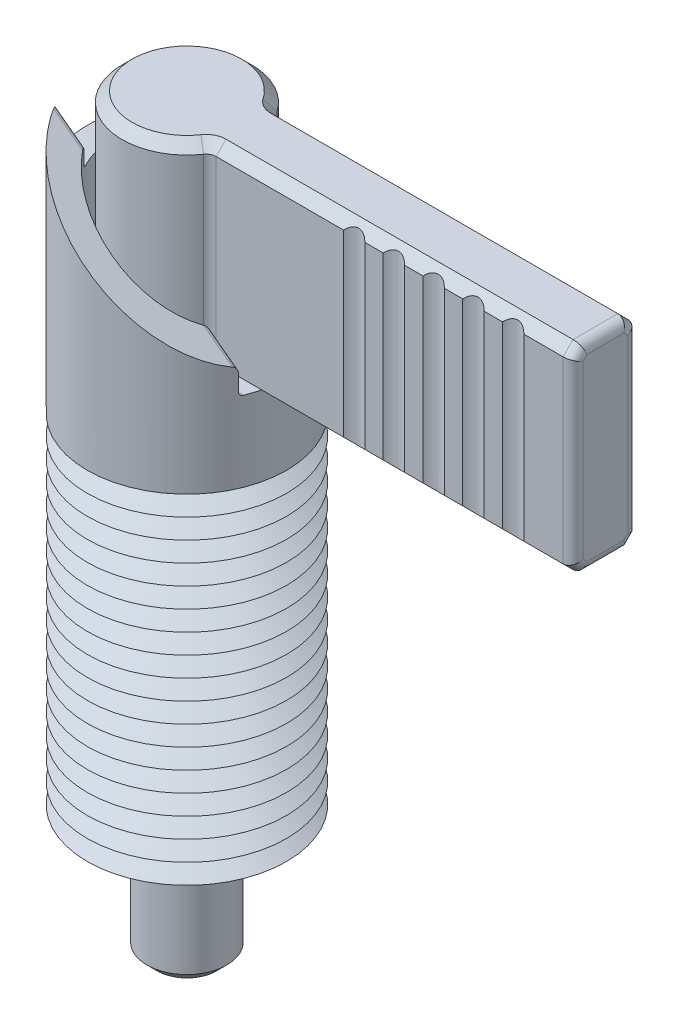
ISO-10303-21;
HEADER;
FILE_DESCRIPTION(('STEP AP214'),'2;1');
FILE_NAME('part.step','',(''),(''),'','','');
FILE_SCHEMA(('AUTOMOTIVE_DESIGN { 1 0 10303 214 1 1 1 1 }'));
ENDSEC;
DATA;
#1=APPLICATION_CONTEXT('core data for automotive mechanical design processes');
#2=APPLICATION_PROTOCOL_DEFINITION('international standard','automotive_design',2000,#1);
#3=PRODUCT_CONTEXT('',#1,'mechanical');
#4=PRODUCT('Part','Part','',(#3));
#5=PRODUCT_RELATED_PRODUCT_CATEGORY('part','',(#4));
#6=PRODUCT_DEFINITION_FORMATION('','',#4);
#7=PRODUCT_DEFINITION_CONTEXT('part definition',#1,'design');
#8=PRODUCT_DEFINITION('design','',#6,#7);
#9=PRODUCT_DEFINITION_SHAPE('','',#8);
#10=(LENGTH_UNIT() NAMED_UNIT(*) SI_UNIT(.MILLI.,.METRE.));
#11=(NAMED_UNIT(*) PLANE_ANGLE_UNIT() SI_UNIT($,.RADIAN.));
#12=(NAMED_UNIT(*) SI_UNIT($,.STERADIAN.) SOLID_ANGLE_UNIT());
#13=UNCERTAINTY_MEASURE_WITH_UNIT(LENGTH_MEASURE(1.E-05),#10,'distance_accuracy_value','');
#14=(GEOMETRIC_REPRESENTATION_CONTEXT(3) GLOBAL_UNCERTAINTY_ASSIGNED_CONTEXT((#13)) GLOBAL_UNIT_ASSIGNED_CONTEXT((#10,
#11,#12)) REPRESENTATION_CONTEXT('',''));
#15=CARTESIAN_POINT('',(0.,0.,0.));
#16=DIRECTION('',(0.,0.,1.));
#17=DIRECTION('',(1.,0.,0.));
#18=AXIS2_PLACEMENT_3D('',#15,#16,#17);
#19=CARTESIAN_POINT('',(2.81458256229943,3.02645384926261,1.625));
#20=DIRECTION('',(0.,0.,1.));
#21=DIRECTION('',(1.,0.,0.));
#22=AXIS2_PLACEMENT_3D('',#19,#20,#21);
#23=PLANE('',#22);
#24=DIRECTION('',(0.,1.,0.));
#25=VECTOR('',#24,1.);
#26=CARTESIAN_POINT('',(10.55198504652,-6.,1.625));
#27=LINE('',#26,#25);
#28=CARTESIAN_POINT('',(10.55198504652,22.0005,1.625));
#29=VERTEX_POINT('',#28);
#30=CARTESIAN_POINT('',(10.55198504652,30.9995,1.625));
#31=VERTEX_POINT('',#30);
#32=EDGE_CURVE('P0_E200',#29,#31,#27,.T.);
#33=ORIENTED_EDGE('',*,*,#32,.F.);
#34=DIRECTION('',(1.,0.,0.));
#35=VECTOR('',#34,1.);
#36=CARTESIAN_POINT('',(21.,22.0005,1.625));
#37=LINE('',#36,#35);
#38=CARTESIAN_POINT('',(11.47701495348,22.0005,1.625));
#39=VERTEX_POINT('',#38);
#40=EDGE_CURVE('P0_E209',#29,#39,#37,.T.);
#41=ORIENTED_EDGE('',*,*,#40,.T.);
#42=DIRECTION('',(0.,1.,0.));
#43=VECTOR('',#42,1.);
#44=CARTESIAN_POINT('',(11.47701495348,-6.,1.625));
#45=LINE('',#44,#43);
#46=CARTESIAN_POINT('',(11.47701495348,30.9995,1.625));
#47=VERTEX_POINT('',#46);
#48=EDGE_CURVE('P0_E210',#39,#47,#45,.T.);
#49=ORIENTED_EDGE('',*,*,#48,.T.);
#50=DIRECTION('',(-1.,0.,0.));
#51=VECTOR('',#50,1.);
#52=CARTESIAN_POINT('',(3.09006472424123,30.9995,1.625));
#53=LINE('',#52,#51);
#54=EDGE_CURVE('P0_E236',#47,#31,#53,.T.);
#55=ORIENTED_EDGE('',*,*,#54,.T.);
#56=EDGE_LOOP('',(#33,#41,#49,#55));
#57=FACE_BOUND('',#56,.T.);
#58=ADVANCED_FACE('P0_F16',(#57),#23,.T.);
#59=DIRECTION('',(0.,1.,0.));
#60=VECTOR('',#59,1.);
#61=CARTESIAN_POINT('',(12.54698504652,-6.,1.625));
#62=LINE('',#61,#60);
#63=CARTESIAN_POINT('',(12.54698504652,22.0005,1.625));
#64=VERTEX_POINT('',#63);
#65=CARTESIAN_POINT('',(12.54698504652,30.9995,1.625));
#66=VERTEX_POINT('',#65);
#67=EDGE_CURVE('P0_E299',#64,#66,#62,.T.);
#68=ORIENTED_EDGE('',*,*,#67,.F.);
#69=CARTESIAN_POINT('',(13.47201495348,22.0005,1.625));
#70=VERTEX_POINT('',#69);
#71=EDGE_CURVE('P0_E221',#64,#70,#37,.T.);
#72=ORIENTED_EDGE('',*,*,#71,.T.);
#73=DIRECTION('',(0.,1.,0.));
#74=VECTOR('',#73,1.);
#75=CARTESIAN_POINT('',(13.47201495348,-6.,1.625));
#76=LINE('',#75,#74);
#77=CARTESIAN_POINT('',(13.47201495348,30.9995,1.625));
#78=VERTEX_POINT('',#77);
#79=EDGE_CURVE('P0_E293',#70,#78,#76,.T.);
#80=ORIENTED_EDGE('',*,*,#79,.T.);
#81=EDGE_CURVE('P0_E239',#78,#66,#53,.T.);
#82=ORIENTED_EDGE('',*,*,#81,.T.);
#83=EDGE_LOOP('',(#68,#72,#80,#82));
#84=FACE_BOUND('',#83,.T.);
#85=ADVANCED_FACE('P0_F496',(#84),#23,.T.);
#86=DIRECTION('',(0.,1.,0.));
#87=VECTOR('',#86,1.);
#88=CARTESIAN_POINT('',(14.54198504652,-6.,1.625));
#89=LINE('',#88,#87);
#90=CARTESIAN_POINT('',(14.54198504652,22.0005,1.625));
#91=VERTEX_POINT('',#90);
#92=CARTESIAN_POINT('',(14.54198504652,30.9995,1.625));
#93=VERTEX_POINT('',#92);
#94=EDGE_CURVE('P0_E292',#91,#93,#89,.T.);
#95=ORIENTED_EDGE('',*,*,#94,.F.);
#96=CARTESIAN_POINT('',(15.46701495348,22.0005,1.625));
#97=VERTEX_POINT('',#96);
#98=EDGE_CURVE('P0_E228',#91,#97,#37,.T.);
#99=ORIENTED_EDGE('',*,*,#98,.T.);
#100=DIRECTION('',(0.,1.,0.));
#101=VECTOR('',#100,1.);
#102=CARTESIAN_POINT('',(15.46701495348,-6.,1.625));
#103=LINE('',#102,#101);
#104=CARTESIAN_POINT('',(15.46701495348,30.9995,1.625));
#105=VERTEX_POINT('',#104);
#106=EDGE_CURVE('P0_E286',#97,#105,#103,.T.);
#107=ORIENTED_EDGE('',*,*,#106,.T.);
#108=EDGE_CURVE('P0_E234',#105,#93,#53,.T.);
#109=ORIENTED_EDGE('',*,*,#108,.T.);
#110=EDGE_LOOP('',(#95,#99,#107,#109));
#111=FACE_BOUND('',#110,.T.);
#112=ADVANCED_FACE('P0_F324',(#111),#23,.T.);
#113=DIRECTION('',(0.,1.,0.));
#114=VECTOR('',#113,1.);
#115=CARTESIAN_POINT('',(16.53698504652,-6.,1.625));
#116=LINE('',#115,#114);
#117=CARTESIAN_POINT('',(16.53698504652,22.0005,1.625));
#118=VERTEX_POINT('',#117);
#119=CARTESIAN_POINT('',(16.53698504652,30.9995,1.625));
#120=VERTEX_POINT('',#119);
#121=EDGE_CURVE('P0_E285',#118,#120,#116,.T.);
#122=ORIENTED_EDGE('',*,*,#121,.F.);
#123=CARTESIAN_POINT('',(17.46201495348,22.0005,1.625));
#124=VERTEX_POINT('',#123);
#125=EDGE_CURVE('P0_E223',#118,#124,#37,.T.);
#126=ORIENTED_EDGE('',*,*,#125,.T.);
#127=DIRECTION('',(0.,1.,0.));
#128=VECTOR('',#127,1.);
#129=CARTESIAN_POINT('',(17.46201495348,-6.,1.625));
#130=LINE('',#129,#128);
#131=CARTESIAN_POINT('',(17.46201495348,30.9995,1.625));
#132=VERTEX_POINT('',#131);
#133=EDGE_CURVE('P0_E279',#124,#132,#130,.T.);
#134=ORIENTED_EDGE('',*,*,#133,.T.);
#135=EDGE_CURVE('P0_E229',#132,#120,#53,.T.);
#136=ORIENTED_EDGE('',*,*,#135,.T.);
#137=EDGE_LOOP('',(#122,#126,#134,#136));
#138=FACE_BOUND('',#137,.T.);
#139=ADVANCED_FACE('P0_F337',(#138),#23,.T.);
#140=CARTESIAN_POINT('',(18.53198504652,22.0005,1.625));
#141=VERTEX_POINT('',#140);
#142=CARTESIAN_POINT('',(20.4995,22.0005,1.625));
#143=VERTEX_POINT('',#142);
#144=EDGE_CURVE('P0_E218',#141,#143,#37,.T.);
#145=ORIENTED_EDGE('',*,*,#144,.T.);
#146=DIRECTION('',(0.,1.,0.));
#147=VECTOR('',#146,1.);
#148=CARTESIAN_POINT('',(20.4995,3.02645384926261,1.625));
#149=LINE('',#148,#147);
#150=CARTESIAN_POINT('',(20.4995,30.9995,1.625));
#151=VERTEX_POINT('',#150);
#152=EDGE_CURVE('P0_E11',#143,#151,#149,.T.);
#153=ORIENTED_EDGE('',*,*,#152,.T.);
#154=CARTESIAN_POINT('',(18.53198504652,30.9995,1.625));
#155=VERTEX_POINT('',#154);
#156=EDGE_CURVE('P0_E224',#151,#155,#53,.T.);
#157=ORIENTED_EDGE('',*,*,#156,.T.);
#158=DIRECTION('',(0.,1.,0.));
#159=VECTOR('',#158,1.);
#160=CARTESIAN_POINT('',(18.53198504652,-6.,1.625));
#161=LINE('',#160,#159);
#162=EDGE_CURVE('P0_E278',#141,#155,#161,.T.);
#163=ORIENTED_EDGE('',*,*,#162,.F.);
#164=EDGE_LOOP('',(#145,#153,#157,#163));
#165=FACE_BOUND('',#164,.T.);
#166=ADVANCED_FACE('P0_F506',(#165),#23,.T.);
#167=CARTESIAN_POINT('',(0.,-6.,0.));
#168=DIRECTION('',(0.,1.,0.));
#169=DIRECTION('',(0.,0.,1.));
#170=AXIS2_PLACEMENT_3D('',#167,#168,#169);
#171=PLANE('',#170);
#172=CARTESIAN_POINT('',(0.,-6.,0.));
#173=DIRECTION('',(0.,-1.,0.));
#174=DIRECTION('',(0.,0.,-1.));
#175=AXIS2_PLACEMENT_3D('',#172,#173,#174);
#176=CIRCLE('',#175,1.5);
#177=CARTESIAN_POINT('',(0.,-6.,-1.5));
#178=VERTEX_POINT('',#177);
#179=EDGE_CURVE('P0_E259',#178,#178,#176,.T.);
#180=ORIENTED_EDGE('',*,*,#179,.T.);
#181=EDGE_LOOP('',(#180));
#182=FACE_BOUND('',#181,.T.);
#183=ADVANCED_FACE('P0_F516',(#182),#171,.F.);
#184=CARTESIAN_POINT('',(0.,-5.5,0.));
#185=DIRECTION('',(0.,1.,0.));
#186=DIRECTION('',(0.,0.,1.));
#187=AXIS2_PLACEMENT_3D('',#184,#185,#186);
#188=CONICAL_SURFACE('',#187,2.,0.785398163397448);
#189=ORIENTED_EDGE('',*,*,#179,.F.);
#190=EDGE_LOOP('',(#189));
#191=FACE_BOUND('',#190,.T.);
#192=CARTESIAN_POINT('',(0.,-5.5,0.));
#193=DIRECTION('',(0.,-1.,0.));
#194=DIRECTION('',(0.,0.,-1.));
#195=AXIS2_PLACEMENT_3D('',#192,#193,#194);
#196=CIRCLE('',#195,2.);
#197=CARTESIAN_POINT('',(0.,-5.5,-2.));
#198=VERTEX_POINT('',#197);
#199=EDGE_CURVE('P0_E262',#198,#198,#196,.T.);
#200=ORIENTED_EDGE('',*,*,#199,.T.);
#201=EDGE_LOOP('',(#200));
#202=FACE_BOUND('',#201,.T.);
#203=ADVANCED_FACE('P0_F521',(#191,#202),#188,.T.);
#204=CARTESIAN_POINT('',(0.,-6.,0.));
#205=DIRECTION('',(0.,-1.,0.));
#206=DIRECTION('',(0.,0.,-1.));
#207=AXIS2_PLACEMENT_3D('',#204,#205,#206);
#208=CYLINDRICAL_SURFACE('',#207,2.);
#209=ORIENTED_EDGE('',*,*,#199,.F.);
#210=EDGE_LOOP('',(#209));
#211=FACE_BOUND('',#210,.T.);
#212=CARTESIAN_POINT('',(0.,4.75,0.));
#213=DIRECTION('',(0.,-1.,0.));
#214=DIRECTION('',(0.,0.,-1.));
#215=AXIS2_PLACEMENT_3D('',#212,#213,#214);
#216=CIRCLE('',#215,2.);
#217=CARTESIAN_POINT('',(0.,4.75,-2.));
#218=VERTEX_POINT('',#217);
#219=EDGE_CURVE('P0_E265',#218,#218,#216,.T.);
#220=ORIENTED_EDGE('',*,*,#219,.T.);
#221=EDGE_LOOP('',(#220));
#222=FACE_BOUND('',#221,.T.);
#223=ADVANCED_FACE('P0_F555',(#211,#222),#208,.T.);
#224=CARTESIAN_POINT('',(-2.,4.75,0.));
#225=DIRECTION('',(0.,-1.,0.));
#226=DIRECTION('',(0.,0.,-1.));
#227=AXIS2_PLACEMENT_3D('',#224,#225,#226);
#228=PLANE('',#227);
#229=ORIENTED_EDGE('',*,*,#219,.F.);
#230=EDGE_LOOP('',(#229));
#231=FACE_BOUND('',#230,.T.);
#232=CARTESIAN_POINT('',(0.,4.75,0.));
#233=DIRECTION('',(0.,-1.,0.));
#234=DIRECTION('',(0.,0.,-1.));
#235=AXIS2_PLACEMENT_3D('',#232,#233,#234);
#236=CIRCLE('',#235,1.5);
#237=CARTESIAN_POINT('',(0.,4.75,-1.5));
#238=VERTEX_POINT('',#237);
#239=EDGE_CURVE('P0_E268',#238,#238,#236,.T.);
#240=ORIENTED_EDGE('',*,*,#239,.T.);
#241=EDGE_LOOP('',(#240));
#242=FACE_BOUND('',#241,.T.);
#243=ADVANCED_FACE('P0_F563',(#231,#242),#228,.F.);
#244=CARTESIAN_POINT('',(0.,-6.,0.));
#245=DIRECTION('',(0.,-1.,0.));
#246=DIRECTION('',(0.,0.,-1.));
#247=AXIS2_PLACEMENT_3D('',#244,#245,#246);
#248=CYLINDRICAL_SURFACE('',#247,1.5);
#249=ORIENTED_EDGE('',*,*,#239,.F.);
#250=EDGE_LOOP('',(#249));
#251=FACE_BOUND('',#250,.T.);
#252=CARTESIAN_POINT('',(0.,21.5,0.));
#253=DIRECTION('',(0.,-1.,0.));
#254=DIRECTION('',(0.,0.,-1.));
#255=AXIS2_PLACEMENT_3D('',#252,#253,#254);
#256=CIRCLE('',#255,1.5);
#257=CARTESIAN_POINT('',(0.,21.5,-1.5));
#258=VERTEX_POINT('',#257);
#259=EDGE_CURVE('P0_E271',#258,#258,#256,.T.);
#260=ORIENTED_EDGE('',*,*,#259,.T.);
#261=EDGE_LOOP('',(#260));
#262=FACE_BOUND('',#261,.T.);
#263=ADVANCED_FACE('P0_F571',(#251,#262),#248,.T.);
#264=CARTESIAN_POINT('',(-1.5,21.5,0.));
#265=DIRECTION('',(0.,1.,0.));
#266=DIRECTION('',(0.,0.,1.));
#267=AXIS2_PLACEMENT_3D('',#264,#265,#266);
#268=PLANE('',#267);
#269=ORIENTED_EDGE('',*,*,#259,.F.);
#270=EDGE_LOOP('',(#269));
#271=FACE_BOUND('',#270,.T.);
#272=DIRECTION('',(1.,0.,0.));
#273=VECTOR('',#272,1.);
#274=CARTESIAN_POINT('',(21.,21.5,-1.12450000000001));
#275=LINE('',#274,#273);
#276=CARTESIAN_POINT('',(3.09006472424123,21.5,-1.12450000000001));
#277=VERTEX_POINT('',#276);
#278=CARTESIAN_POINT('',(20.4995,21.5,-1.12450000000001));
#279=VERTEX_POINT('',#278);
#280=EDGE_CURVE('P0_E247',#277,#279,#275,.T.);
#281=ORIENTED_EDGE('',*,*,#280,.T.);
#282=DIRECTION('',(0.,0.,1.));
#283=VECTOR('',#282,1.);
#284=CARTESIAN_POINT('',(20.4995,21.5,1.12450000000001));
#285=LINE('',#284,#283);
#286=CARTESIAN_POINT('',(20.4995,21.5,1.12450000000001));
#287=VERTEX_POINT('',#286);
#288=EDGE_CURVE('P0_E40',#279,#287,#285,.T.);
#289=ORIENTED_EDGE('',*,*,#288,.T.);
#290=DIRECTION('',(-1.,0.,0.));
#291=VECTOR('',#290,1.);
#292=CARTESIAN_POINT('',(3.09006472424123,21.5,1.12450000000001));
#293=LINE('',#292,#291);
#294=CARTESIAN_POINT('',(3.09006472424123,21.5,1.12450000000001));
#295=VERTEX_POINT('',#294);
#296=EDGE_CURVE('P0_E237',#287,#295,#293,.T.);
#297=ORIENTED_EDGE('',*,*,#296,.T.);
#298=CARTESIAN_POINT('',(3.09006472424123,21.5,2.1255));
#299=DIRECTION('',(0.,1.,0.));
#300=DIRECTION('',(0.,0.,1.));
#301=AXIS2_PLACEMENT_3D('',#298,#299,#300);
#302=CIRCLE('',#301,1.00099999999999);
#303=CARTESIAN_POINT('',(2.26533341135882,21.5,1.55820883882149));
#304=VERTEX_POINT('',#303);
#305=EDGE_CURVE('P0_E240',#295,#304,#302,.T.);
#306=ORIENTED_EDGE('',*,*,#305,.T.);
#307=CARTESIAN_POINT('',(0.,21.5,0.));
#308=DIRECTION('',(0.,1.,0.));
#309=DIRECTION('',(0.,0.,1.));
#310=AXIS2_PLACEMENT_3D('',#307,#308,#309);
#311=CIRCLE('',#310,2.74950000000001);
#312=CARTESIAN_POINT('',(2.26533341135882,21.5,-1.55820883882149));
#313=VERTEX_POINT('',#312);
#314=EDGE_CURVE('P0_E241',#304,#313,#311,.F.);
#315=ORIENTED_EDGE('',*,*,#314,.T.);
#316=CARTESIAN_POINT('',(3.09006472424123,21.5,-2.1255));
#317=DIRECTION('',(0.,1.,0.));
#318=DIRECTION('',(0.,0.,1.));
#319=AXIS2_PLACEMENT_3D('',#316,#317,#318);
#320=CIRCLE('',#319,1.00099999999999);
#321=EDGE_CURVE('P0_E245',#313,#277,#320,.T.);
#322=ORIENTED_EDGE('',*,*,#321,.T.);
#323=EDGE_LOOP('',(#281,#289,#297,#306,#315,#322));
#324=FACE_BOUND('',#323,.T.);
#325=ADVANCED_FACE('P0_F422',(#271,#324),#268,.F.);
#326=CARTESIAN_POINT('',(0.,-6.,0.));
#327=DIRECTION('',(0.,-1.,0.));
#328=DIRECTION('',(0.,0.,-1.));
#329=AXIS2_PLACEMENT_3D('',#326,#327,#328);
#330=CYLINDRICAL_SURFACE('',#329,3.25);
#331=DIRECTION('',(0.,-1.,0.));
#332=VECTOR('',#331,1.);
#333=CARTESIAN_POINT('',(2.67769906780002,-6.,-1.84185441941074));
#334=LINE('',#333,#332);
#335=CARTESIAN_POINT('',(2.67769906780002,30.9995,-1.84185441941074));
#336=VERTEX_POINT('',#335);
#337=CARTESIAN_POINT('',(2.67769906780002,22.0005,-1.84185441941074));
#338=VERTEX_POINT('',#337);
#339=EDGE_CURVE('P0_E250',#336,#338,#334,.T.);
#340=ORIENTED_EDGE('',*,*,#339,.T.);
#341=CARTESIAN_POINT('',(0.,22.0005,0.));
#342=DIRECTION('',(0.,1.,0.));
#343=DIRECTION('',(0.,0.,1.));
#344=AXIS2_PLACEMENT_3D('',#341,#342,#343);
#345=CIRCLE('',#344,3.25);
#346=CARTESIAN_POINT('',(2.67769906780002,22.0005,1.84185441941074));
#347=VERTEX_POINT('',#346);
#348=EDGE_CURVE('P0_E436',#338,#347,#345,.T.);
#349=ORIENTED_EDGE('',*,*,#348,.T.);
#350=DIRECTION('',(0.,-1.,0.));
#351=VECTOR('',#350,1.);
#352=CARTESIAN_POINT('',(2.67769906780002,-6.,1.84185441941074));
#353=LINE('',#352,#351);
#354=CARTESIAN_POINT('',(2.67769906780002,30.9995,1.84185441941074));
#355=VERTEX_POINT('',#354);
#356=EDGE_CURVE('P0_E253',#347,#355,#353,.F.);
#357=ORIENTED_EDGE('',*,*,#356,.T.);
#358=CARTESIAN_POINT('',(0.,30.9995,0.));
#359=DIRECTION('',(0.,-1.,0.));
#360=DIRECTION('',(0.,0.,-1.));
#361=AXIS2_PLACEMENT_3D('',#358,#359,#360);
#362=CIRCLE('',#361,3.25);
#363=EDGE_CURVE('P0_E476',#355,#336,#362,.T.);
#364=ORIENTED_EDGE('',*,*,#363,.T.);
#365=EDGE_LOOP('',(#340,#349,#357,#364));
#366=FACE_BOUND('',#365,.T.);
#367=ADVANCED_FACE('P0_F586',(#366),#330,.T.);
#368=CARTESIAN_POINT('',(-3.25,31.5,0.));
#369=DIRECTION('',(0.,-1.,0.));
#370=DIRECTION('',(0.,0.,-1.));
#371=AXIS2_PLACEMENT_3D('',#368,#369,#370);
#372=PLANE('',#371);
#373=DIRECTION('',(1.,0.,0.));
#374=VECTOR('',#373,1.);
#375=CARTESIAN_POINT('',(21.,31.5,1.12450000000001));
#376=LINE('',#375,#374);
#377=CARTESIAN_POINT('',(3.09006472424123,31.5,1.12450000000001));
#378=VERTEX_POINT('',#377);
#379=CARTESIAN_POINT('',(20.4995,31.5,1.12450000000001));
#380=VERTEX_POINT('',#379);
#381=EDGE_CURVE('P0_E343',#378,#380,#376,.T.);
#382=ORIENTED_EDGE('',*,*,#381,.T.);
#383=DIRECTION('',(0.,0.,-1.));
#384=VECTOR('',#383,1.);
#385=CARTESIAN_POINT('',(20.4995,31.5,-1.12450000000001));
#386=LINE('',#385,#384);
#387=CARTESIAN_POINT('',(20.4995,31.5,-1.12450000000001));
#388=VERTEX_POINT('',#387);
#389=EDGE_CURVE('P0_E375',#380,#388,#386,.T.);
#390=ORIENTED_EDGE('',*,*,#389,.T.);
#391=DIRECTION('',(-1.,0.,0.));
#392=VECTOR('',#391,1.);
#393=CARTESIAN_POINT('',(3.09006472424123,31.5,-1.12450000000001));
#394=LINE('',#393,#392);
#395=CARTESIAN_POINT('',(3.09006472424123,31.5,-1.12450000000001));
#396=VERTEX_POINT('',#395);
#397=EDGE_CURVE('P0_E465',#388,#396,#394,.T.);
#398=ORIENTED_EDGE('',*,*,#397,.T.);
#399=CARTESIAN_POINT('',(3.09006472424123,31.5,-2.1255));
#400=DIRECTION('',(0.,-1.,0.));
#401=DIRECTION('',(0.,0.,-1.));
#402=AXIS2_PLACEMENT_3D('',#399,#400,#401);
#403=CIRCLE('',#402,1.00099999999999);
#404=CARTESIAN_POINT('',(2.26533341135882,31.5,-1.55820883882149));
#405=VERTEX_POINT('',#404);
#406=EDGE_CURVE('P0_E463',#396,#405,#403,.T.);
#407=ORIENTED_EDGE('',*,*,#406,.T.);
#408=CARTESIAN_POINT('',(0.,31.5,0.));
#409=DIRECTION('',(0.,-1.,0.));
#410=DIRECTION('',(0.,0.,-1.));
#411=AXIS2_PLACEMENT_3D('',#408,#409,#410);
#412=CIRCLE('',#411,2.74950000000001);
#413=CARTESIAN_POINT('',(2.26533341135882,31.5,1.55820883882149));
#414=VERTEX_POINT('',#413);
#415=EDGE_CURVE('P0_E461',#405,#414,#412,.F.);
#416=ORIENTED_EDGE('',*,*,#415,.T.);
#417=CARTESIAN_POINT('',(3.09006472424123,31.5,2.1255));
#418=DIRECTION('',(0.,-1.,0.));
#419=DIRECTION('',(0.,0.,-1.));
#420=AXIS2_PLACEMENT_3D('',#417,#418,#419);
#421=CIRCLE('',#420,1.00099999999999);
#422=EDGE_CURVE('P0_E348',#414,#378,#421,.T.);
#423=ORIENTED_EDGE('',*,*,#422,.T.);
#424=EDGE_LOOP('',(#382,#390,#398,#407,#416,#423));
#425=FACE_BOUND('',#424,.T.);
#426=ADVANCED_FACE('P0_F594',(#425),#372,.F.);
#427=CARTESIAN_POINT('',(2.81458256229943,3.02645384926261,-1.625));
#428=DIRECTION('',(0.,0.,-1.));
#429=DIRECTION('',(-1.,0.,0.));
#430=AXIS2_PLACEMENT_3D('',#427,#428,#429);
#431=PLANE('',#430);
#432=DIRECTION('',(1.,0.,0.));
#433=VECTOR('',#432,1.);
#434=CARTESIAN_POINT('',(21.,30.9995,-1.625));
#435=LINE('',#434,#433);
#436=CARTESIAN_POINT('',(3.09006472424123,30.9995,-1.625));
#437=VERTEX_POINT('',#436);
#438=CARTESIAN_POINT('',(20.4995,30.9995,-1.625));
#439=VERTEX_POINT('',#438);
#440=EDGE_CURVE('P0_E468',#437,#439,#435,.T.);
#441=ORIENTED_EDGE('',*,*,#440,.T.);
#442=DIRECTION('',(0.,1.,0.));
#443=VECTOR('',#442,1.);
#444=CARTESIAN_POINT('',(20.4995,3.02645384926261,-1.625));
#445=LINE('',#444,#443);
#446=CARTESIAN_POINT('',(20.4995,22.0005,-1.625));
#447=VERTEX_POINT('',#446);
#448=EDGE_CURVE('P0_E379',#439,#447,#445,.F.);
#449=ORIENTED_EDGE('',*,*,#448,.T.);
#450=DIRECTION('',(-1.,0.,0.));
#451=VECTOR('',#450,1.);
#452=CARTESIAN_POINT('',(3.09006472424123,22.0005,-1.625));
#453=LINE('',#452,#451);
#454=CARTESIAN_POINT('',(3.09006472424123,22.0005,-1.625));
#455=VERTEX_POINT('',#454);
#456=EDGE_CURVE('P0_E421',#447,#455,#453,.T.);
#457=ORIENTED_EDGE('',*,*,#456,.T.);
#458=DIRECTION('',(0.,-1.,0.));
#459=VECTOR('',#458,1.);
#460=CARTESIAN_POINT('',(3.09006472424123,3.02645384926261,-1.625));
#461=LINE('',#460,#459);
#462=EDGE_CURVE('P0_E256',#455,#437,#461,.F.);
#463=ORIENTED_EDGE('',*,*,#462,.T.);
#464=EDGE_LOOP('',(#441,#449,#457,#463));
#465=FACE_BOUND('',#464,.T.);
#466=ADVANCED_FACE('P0_F513',(#465),#431,.T.);
#467=CARTESIAN_POINT('',(21.,3.02645384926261,1.625));
#468=DIRECTION('',(1.,0.,0.));
#469=DIRECTION('',(0.,0.,-1.));
#470=AXIS2_PLACEMENT_3D('',#467,#468,#469);
#471=PLANE('',#470);
#472=DIRECTION('',(0.,0.,-1.));
#473=VECTOR('',#472,1.);
#474=CARTESIAN_POINT('',(21.,30.9995,1.12450000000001));
#475=LINE('',#474,#473);
#476=CARTESIAN_POINT('',(21.,30.9995,-0.917186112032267));
#477=VERTEX_POINT('',#476);
#478=CARTESIAN_POINT('',(21.,30.9995,0.917186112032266));
#479=VERTEX_POINT('',#478);
#480=EDGE_CURVE('P0_E367',#477,#479,#475,.F.);
#481=ORIENTED_EDGE('',*,*,#480,.T.);
#482=DIRECTION('',(0.,-0.707106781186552,0.707106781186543));
#483=VECTOR('',#482,1.);
#484=CARTESIAN_POINT('',(21.,16.6590699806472,15.2576161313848));
#485=LINE('',#484,#483);
#486=CARTESIAN_POINT('',(21.,30.7921861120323,1.1245));
#487=VERTEX_POINT('',#486);
#488=EDGE_CURVE('P0_E369',#479,#487,#485,.T.);
#489=ORIENTED_EDGE('',*,*,#488,.T.);
#490=DIRECTION('',(0.,1.,0.));
#491=VECTOR('',#490,1.);
#492=CARTESIAN_POINT('',(21.,3.02645384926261,1.1245));
#493=LINE('',#492,#491);
#494=CARTESIAN_POINT('',(21.,22.2078138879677,1.1245));
#495=VERTEX_POINT('',#494);
#496=EDGE_CURVE('P0_E309',#487,#495,#493,.F.);
#497=ORIENTED_EDGE('',*,*,#496,.T.);
#498=DIRECTION('',(0.,-0.707106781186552,-0.707106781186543));
#499=VECTOR('',#498,1.);
#500=CARTESIAN_POINT('',(21.,12.867383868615,-8.21593001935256));
#501=LINE('',#500,#499);
#502=CARTESIAN_POINT('',(21.,22.0005,0.917186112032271));
#503=VERTEX_POINT('',#502);
#504=EDGE_CURVE('P0_E357',#495,#503,#501,.T.);
#505=ORIENTED_EDGE('',*,*,#504,.T.);
#506=DIRECTION('',(0.,0.,1.));
#507=VECTOR('',#506,1.);
#508=CARTESIAN_POINT('',(21.,22.0005,-1.12450000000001));
#509=LINE('',#508,#507);
#510=CARTESIAN_POINT('',(21.,22.0005,-0.917186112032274));
#511=VERTEX_POINT('',#510);
#512=EDGE_CURVE('P0_E359',#503,#511,#509,.F.);
#513=ORIENTED_EDGE('',*,*,#512,.T.);
#514=DIRECTION('',(0.,0.707106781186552,-0.707106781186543));
#515=VECTOR('',#514,1.);
#516=CARTESIAN_POINT('',(21.,11.242383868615,9.84093001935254));
#517=LINE('',#516,#515);
#518=CARTESIAN_POINT('',(21.,22.2078138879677,-1.1245));
#519=VERTEX_POINT('',#518);
#520=EDGE_CURVE('P0_E361',#511,#519,#517,.T.);
#521=ORIENTED_EDGE('',*,*,#520,.T.);
#522=DIRECTION('',(0.,1.,0.));
#523=VECTOR('',#522,1.);
#524=CARTESIAN_POINT('',(21.,3.02645384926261,-1.1245));
#525=LINE('',#524,#523);
#526=CARTESIAN_POINT('',(21.,30.7921861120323,-1.1245));
#527=VERTEX_POINT('',#526);
#528=EDGE_CURVE('P0_E363',#519,#527,#525,.T.);
#529=ORIENTED_EDGE('',*,*,#528,.T.);
#530=DIRECTION('',(0.,0.707106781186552,0.707106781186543));
#531=VECTOR('',#530,1.);
#532=CARTESIAN_POINT('',(21.,18.2840699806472,-13.6326161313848));
#533=LINE('',#532,#531);
#534=EDGE_CURVE('P0_E365',#527,#477,#533,.T.);
#535=ORIENTED_EDGE('',*,*,#534,.T.);
#536=EDGE_LOOP('',(#481,#489,#497,#505,#513,#521,#529,#535));
#537=FACE_BOUND('',#536,.T.);
#538=ADVANCED_FACE('P0_F505',(#537),#471,.T.);
#539=DIRECTION('',(0.,1.,0.));
#540=VECTOR('',#539,1.);
#541=CARTESIAN_POINT('',(9.48201495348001,-6.,1.625));
#542=LINE('',#541,#540);
#543=CARTESIAN_POINT('',(9.48201495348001,22.0005,1.625));
#544=VERTEX_POINT('',#543);
#545=CARTESIAN_POINT('',(9.48201495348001,30.9995,1.625));
#546=VERTEX_POINT('',#545);
#547=EDGE_CURVE('P0_E190',#544,#546,#542,.T.);
#548=ORIENTED_EDGE('',*,*,#547,.T.);
#549=CARTESIAN_POINT('',(3.09006472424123,30.9995,1.625));
#550=VERTEX_POINT('',#549);
#551=EDGE_CURVE('P0_E230',#546,#550,#53,.T.);
#552=ORIENTED_EDGE('',*,*,#551,.T.);
#553=DIRECTION('',(0.,-1.,0.));
#554=VECTOR('',#553,1.);
#555=CARTESIAN_POINT('',(3.09006472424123,3.02645384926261,1.625));
#556=LINE('',#555,#554);
#557=CARTESIAN_POINT('',(3.09006472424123,22.0005,1.625));
#558=VERTEX_POINT('',#557);
#559=EDGE_CURVE('P0_E215',#550,#558,#556,.T.);
#560=ORIENTED_EDGE('',*,*,#559,.T.);
#561=EDGE_CURVE('P0_E206',#558,#544,#37,.T.);
#562=ORIENTED_EDGE('',*,*,#561,.T.);
#563=EDGE_LOOP('',(#548,#552,#560,#562));
#564=FACE_BOUND('',#563,.T.);
#565=ADVANCED_FACE('P0_F213',(#564),#23,.T.);
#566=CARTESIAN_POINT('',(3.09006472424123,-6.,-2.1255));
#567=DIRECTION('',(0.,-1.,0.));
#568=DIRECTION('',(0.,0.,-1.));
#569=AXIS2_PLACEMENT_3D('',#566,#567,#568);
#570=CYLINDRICAL_SURFACE('',#569,0.5005);
#571=ORIENTED_EDGE('',*,*,#462,.F.);
#572=CARTESIAN_POINT('',(3.09006472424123,22.0005,-2.1255));
#573=DIRECTION('',(0.,1.,0.));
#574=DIRECTION('',(0.,0.,1.));
#575=AXIS2_PLACEMENT_3D('',#572,#573,#574);
#576=CIRCLE('',#575,0.5005);
#577=EDGE_CURVE('P0_E471',#455,#338,#576,.F.);
#578=ORIENTED_EDGE('',*,*,#577,.T.);
#579=ORIENTED_EDGE('',*,*,#339,.F.);
#580=CARTESIAN_POINT('',(3.09006472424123,30.9995,-2.1255));
#581=DIRECTION('',(0.,-1.,0.));
#582=DIRECTION('',(0.,0.,-1.));
#583=AXIS2_PLACEMENT_3D('',#580,#581,#582);
#584=CIRCLE('',#583,0.5005);
#585=EDGE_CURVE('P0_E473',#336,#437,#584,.F.);
#586=ORIENTED_EDGE('',*,*,#585,.T.);
#587=EDGE_LOOP('',(#571,#578,#579,#586));
#588=FACE_BOUND('',#587,.T.);
#589=ADVANCED_FACE('P0_F504',(#588),#570,.F.);
#590=CARTESIAN_POINT('',(3.09006472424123,-6.,2.1255));
#591=DIRECTION('',(0.,-1.,0.));
#592=DIRECTION('',(0.,0.,-1.));
#593=AXIS2_PLACEMENT_3D('',#590,#591,#592);
#594=CYLINDRICAL_SURFACE('',#593,0.5005);
#595=ORIENTED_EDGE('',*,*,#356,.F.);
#596=CARTESIAN_POINT('',(3.09006472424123,22.0005,2.1255));
#597=DIRECTION('',(0.,1.,0.));
#598=DIRECTION('',(0.,0.,1.));
#599=AXIS2_PLACEMENT_3D('',#596,#597,#598);
#600=CIRCLE('',#599,0.5005);
#601=EDGE_CURVE('P0_E219',#347,#558,#600,.F.);
#602=ORIENTED_EDGE('',*,*,#601,.T.);
#603=ORIENTED_EDGE('',*,*,#559,.F.);
#604=CARTESIAN_POINT('',(3.09006472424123,30.9995,2.1255));
#605=DIRECTION('',(0.,-1.,0.));
#606=DIRECTION('',(0.,0.,-1.));
#607=AXIS2_PLACEMENT_3D('',#604,#605,#606);
#608=CIRCLE('',#607,0.5005);
#609=EDGE_CURVE('P0_E216',#550,#355,#608,.F.);
#610=ORIENTED_EDGE('',*,*,#609,.T.);
#611=EDGE_LOOP('',(#595,#602,#603,#610));
#612=FACE_BOUND('',#611,.T.);
#613=ADVANCED_FACE('P0_F481',(#612),#594,.F.);
#614=CARTESIAN_POINT('',(-1.5,21.5,-1.12450000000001));
#615=DIRECTION('',(0.,-0.707106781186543,-0.707106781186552));
#616=DIRECTION('',(0.,0.707106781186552,-0.707106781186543));
#617=AXIS2_PLACEMENT_3D('',#614,#615,#616);
#618=PLANE('',#617);
#619=ORIENTED_EDGE('',*,*,#456,.F.);
#620=DIRECTION('',(0.,0.707106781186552,-0.707106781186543));
#621=VECTOR('',#620,1.);
#622=CARTESIAN_POINT('',(20.4995,21.5,-1.12450000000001));
#623=LINE('',#622,#621);
#624=EDGE_CURVE('P0_E381',#447,#279,#623,.F.);
#625=ORIENTED_EDGE('',*,*,#624,.T.);
#626=ORIENTED_EDGE('',*,*,#280,.F.);
#627=DIRECTION('',(0.,-0.707106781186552,0.707106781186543));
#628=VECTOR('',#627,1.);
#629=CARTESIAN_POINT('',(3.09006472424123,22.0005,-1.625));
#630=LINE('',#629,#628);
#631=EDGE_CURVE('P0_E274',#455,#277,#630,.T.);
#632=ORIENTED_EDGE('',*,*,#631,.F.);
#633=EDGE_LOOP('',(#619,#625,#626,#632));
#634=FACE_BOUND('',#633,.T.);
#635=ADVANCED_FACE('P0_F418',(#634),#618,.T.);
#636=CARTESIAN_POINT('',(3.09006472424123,21.5,-2.1255));
#637=DIRECTION('',(0.,-1.,0.));
#638=DIRECTION('',(0.,0.,-1.));
#639=AXIS2_PLACEMENT_3D('',#636,#637,#638);
#640=CONICAL_SURFACE('',#639,1.00099999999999,0.785398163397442);
#641=ORIENTED_EDGE('',*,*,#631,.T.);
#642=ORIENTED_EDGE('',*,*,#321,.F.);
#643=DIRECTION('',(-0.582590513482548,-0.707106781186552,0.400734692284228));
#644=VECTOR('',#643,1.);
#645=CARTESIAN_POINT('',(2.67769906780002,22.0005,-1.84185441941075));
#646=LINE('',#645,#644);
#647=EDGE_CURVE('P0_E430',#338,#313,#646,.T.);
#648=ORIENTED_EDGE('',*,*,#647,.F.);
#649=ORIENTED_EDGE('',*,*,#577,.F.);
#650=EDGE_LOOP('',(#641,#642,#648,#649));
#651=FACE_BOUND('',#650,.T.);
#652=ADVANCED_FACE('P0_F428',(#651),#640,.F.);
#653=CARTESIAN_POINT('',(0.,21.5,0.));
#654=DIRECTION('',(0.,1.,0.));
#655=DIRECTION('',(0.,0.,1.));
#656=AXIS2_PLACEMENT_3D('',#653,#654,#655);
#657=CONICAL_SURFACE('',#656,2.74950000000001,0.785398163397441);
#658=ORIENTED_EDGE('',*,*,#647,.T.);
#659=ORIENTED_EDGE('',*,*,#314,.F.);
#660=DIRECTION('',(-0.582590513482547,-0.707106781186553,-0.400734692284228));
#661=VECTOR('',#660,1.);
#662=CARTESIAN_POINT('',(2.67769906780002,22.0005,1.84185441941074));
#663=LINE('',#662,#661);
#664=EDGE_CURVE('P0_E437',#347,#304,#663,.T.);
#665=ORIENTED_EDGE('',*,*,#664,.F.);
#666=ORIENTED_EDGE('',*,*,#348,.F.);
#667=EDGE_LOOP('',(#658,#659,#665,#666));
#668=FACE_BOUND('',#667,.T.);
#669=ADVANCED_FACE('P0_F433',(#668),#657,.T.);
#670=CARTESIAN_POINT('',(3.09006472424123,21.5,2.1255));
#671=DIRECTION('',(0.,-1.,0.));
#672=DIRECTION('',(0.,0.,-1.));
#673=AXIS2_PLACEMENT_3D('',#670,#671,#672);
#674=CONICAL_SURFACE('',#673,1.00099999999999,0.785398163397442);
#675=ORIENTED_EDGE('',*,*,#664,.T.);
#676=ORIENTED_EDGE('',*,*,#305,.F.);
#677=DIRECTION('',(0.,-0.707106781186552,-0.707106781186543));
#678=VECTOR('',#677,1.);
#679=CARTESIAN_POINT('',(3.09006472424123,22.0005,1.625));
#680=LINE('',#679,#678);
#681=EDGE_CURVE('P0_E440',#558,#295,#680,.T.);
#682=ORIENTED_EDGE('',*,*,#681,.F.);
#683=ORIENTED_EDGE('',*,*,#601,.F.);
#684=EDGE_LOOP('',(#675,#676,#682,#683));
#685=FACE_BOUND('',#684,.T.);
#686=ADVANCED_FACE('P0_F484',(#685),#674,.F.);
#687=CARTESIAN_POINT('',(-1.5,21.5,1.12450000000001));
#688=DIRECTION('',(0.,-0.707106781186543,0.707106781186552));
#689=DIRECTION('',(0.,-0.707106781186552,-0.707106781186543));
#690=AXIS2_PLACEMENT_3D('',#687,#688,#689);
#691=PLANE('',#690);
#692=ORIENTED_EDGE('',*,*,#296,.F.);
#693=DIRECTION('',(0.,-0.707106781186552,-0.707106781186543));
#694=VECTOR('',#693,1.);
#695=CARTESIAN_POINT('',(20.4995,21.5,1.12450000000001));
#696=LINE('',#695,#694);
#697=EDGE_CURVE('P0_E25',#287,#143,#696,.F.);
#698=ORIENTED_EDGE('',*,*,#697,.T.);
#699=ORIENTED_EDGE('',*,*,#144,.F.);
#700=CARTESIAN_POINT('',(17.997,22.5045,2.129));
#701=DIRECTION('',(0.,-0.707106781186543,0.707106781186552));
#702=DIRECTION('',(0.,0.707106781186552,0.707106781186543));
#703=AXIS2_PLACEMENT_3D('',#700,#701,#702);
#704=ELLIPSE('',#703,1.03944696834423,0.735);
#705=EDGE_CURVE('P0_E275',#124,#141,#704,.T.);
#706=ORIENTED_EDGE('',*,*,#705,.F.);
#707=ORIENTED_EDGE('',*,*,#125,.F.);
#708=CARTESIAN_POINT('',(16.002,22.5045,2.129));
#709=DIRECTION('',(0.,-0.707106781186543,0.707106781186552));
#710=DIRECTION('',(0.,0.707106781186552,0.707106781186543));
#711=AXIS2_PLACEMENT_3D('',#708,#709,#710);
#712=ELLIPSE('',#711,1.03944696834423,0.735);
#713=EDGE_CURVE('P0_E282',#97,#118,#712,.T.);
#714=ORIENTED_EDGE('',*,*,#713,.F.);
#715=ORIENTED_EDGE('',*,*,#98,.F.);
#716=CARTESIAN_POINT('',(14.007,22.5045,2.129));
#717=DIRECTION('',(0.,-0.707106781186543,0.707106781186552));
#718=DIRECTION('',(0.,0.707106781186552,0.707106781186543));
#719=AXIS2_PLACEMENT_3D('',#716,#717,#718);
#720=ELLIPSE('',#719,1.03944696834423,0.735);
#721=EDGE_CURVE('P0_E289',#70,#91,#720,.T.);
#722=ORIENTED_EDGE('',*,*,#721,.F.);
#723=ORIENTED_EDGE('',*,*,#71,.F.);
#724=CARTESIAN_POINT('',(12.012,22.5045,2.129));
#725=DIRECTION('',(0.,-0.707106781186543,0.707106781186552));
#726=DIRECTION('',(0.,0.707106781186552,0.707106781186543));
#727=AXIS2_PLACEMENT_3D('',#724,#725,#726);
#728=ELLIPSE('',#727,1.03944696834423,0.735);
#729=EDGE_CURVE('P0_E296',#39,#64,#728,.T.);
#730=ORIENTED_EDGE('',*,*,#729,.F.);
#731=ORIENTED_EDGE('',*,*,#40,.F.);
#732=CARTESIAN_POINT('',(10.017,22.5045,2.129));
#733=DIRECTION('',(0.,-0.707106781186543,0.707106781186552));
#734=DIRECTION('',(0.,0.707106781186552,0.707106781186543));
#735=AXIS2_PLACEMENT_3D('',#732,#733,#734);
#736=ELLIPSE('',#735,1.03944696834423,0.735);
#737=EDGE_CURVE('P0_E193',#544,#29,#736,.T.);
#738=ORIENTED_EDGE('',*,*,#737,.F.);
#739=ORIENTED_EDGE('',*,*,#561,.F.);
#740=ORIENTED_EDGE('',*,*,#681,.T.);
#741=EDGE_LOOP('',(#692,#698,#699,#706,#707,#714,#715,#722,#723,#730,#731,#738,#739,#740));
#742=FACE_BOUND('',#741,.T.);
#743=ADVANCED_FACE('P0_F204',(#742),#691,.T.);
#744=CARTESIAN_POINT('',(-3.25,31.5,-1.12450000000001));
#745=DIRECTION('',(0.,0.707106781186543,-0.707106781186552));
#746=DIRECTION('',(0.,0.707106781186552,0.707106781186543));
#747=AXIS2_PLACEMENT_3D('',#744,#745,#746);
#748=PLANE('',#747);
#749=ORIENTED_EDGE('',*,*,#397,.F.);
#750=DIRECTION('',(0.,0.707106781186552,0.707106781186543));
#751=VECTOR('',#750,1.);
#752=CARTESIAN_POINT('',(20.4995,31.5,-1.12450000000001));
#753=LINE('',#752,#751);
#754=EDGE_CURVE('P0_E377',#388,#439,#753,.F.);
#755=ORIENTED_EDGE('',*,*,#754,.T.);
#756=ORIENTED_EDGE('',*,*,#440,.F.);
#757=DIRECTION('',(0.,-0.707106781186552,-0.707106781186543));
#758=VECTOR('',#757,1.);
#759=CARTESIAN_POINT('',(3.09006472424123,31.5,-1.12450000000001));
#760=LINE('',#759,#758);
#761=EDGE_CURVE('P0_E351',#396,#437,#760,.T.);
#762=ORIENTED_EDGE('',*,*,#761,.F.);
#763=EDGE_LOOP('',(#749,#755,#756,#762));
#764=FACE_BOUND('',#763,.T.);
#765=ADVANCED_FACE('P0_F492',(#764),#748,.T.);
#766=CARTESIAN_POINT('',(3.09006472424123,31.5,-2.1255));
#767=DIRECTION('',(0.,1.,0.));
#768=DIRECTION('',(0.,0.,1.));
#769=AXIS2_PLACEMENT_3D('',#766,#767,#768);
#770=CONICAL_SURFACE('',#769,1.00099999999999,0.785398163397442);
#771=ORIENTED_EDGE('',*,*,#761,.T.);
#772=ORIENTED_EDGE('',*,*,#585,.F.);
#773=DIRECTION('',(0.582590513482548,-0.707106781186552,-0.400734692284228));
#774=VECTOR('',#773,1.);
#775=CARTESIAN_POINT('',(2.26533341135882,31.5,-1.55820883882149));
#776=LINE('',#775,#774);
#777=EDGE_CURVE('P0_E447',#405,#336,#776,.T.);
#778=ORIENTED_EDGE('',*,*,#777,.F.);
#779=ORIENTED_EDGE('',*,*,#406,.F.);
#780=EDGE_LOOP('',(#771,#772,#778,#779));
#781=FACE_BOUND('',#780,.T.);
#782=ADVANCED_FACE('P0_F653',(#781),#770,.F.);
#783=CARTESIAN_POINT('',(0.,30.9995,0.));
#784=DIRECTION('',(0.,-1.,0.));
#785=DIRECTION('',(0.,0.,-1.));
#786=AXIS2_PLACEMENT_3D('',#783,#784,#785);
#787=CONICAL_SURFACE('',#786,3.25,0.785398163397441);
#788=ORIENTED_EDGE('',*,*,#777,.T.);
#789=ORIENTED_EDGE('',*,*,#363,.F.);
#790=DIRECTION('',(0.582590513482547,-0.707106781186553,0.400734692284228));
#791=VECTOR('',#790,1.);
#792=CARTESIAN_POINT('',(2.26533341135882,31.5,1.55820883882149));
#793=LINE('',#792,#791);
#794=EDGE_CURVE('P0_E445',#414,#355,#793,.T.);
#795=ORIENTED_EDGE('',*,*,#794,.F.);
#796=ORIENTED_EDGE('',*,*,#415,.F.);
#797=EDGE_LOOP('',(#788,#789,#795,#796));
#798=FACE_BOUND('',#797,.T.);
#799=ADVANCED_FACE('P0_F661',(#798),#787,.T.);
#800=CARTESIAN_POINT('',(3.09006472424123,31.5,2.1255));
#801=DIRECTION('',(0.,1.,0.));
#802=DIRECTION('',(0.,0.,1.));
#803=AXIS2_PLACEMENT_3D('',#800,#801,#802);
#804=CONICAL_SURFACE('',#803,1.00099999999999,0.785398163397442);
#805=ORIENTED_EDGE('',*,*,#794,.T.);
#806=ORIENTED_EDGE('',*,*,#609,.F.);
#807=DIRECTION('',(0.,-0.707106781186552,0.707106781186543));
#808=VECTOR('',#807,1.);
#809=CARTESIAN_POINT('',(3.09006472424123,31.5,1.12450000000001));
#810=LINE('',#809,#808);
#811=EDGE_CURVE('P0_E277',#378,#550,#810,.T.);
#812=ORIENTED_EDGE('',*,*,#811,.F.);
#813=ORIENTED_EDGE('',*,*,#422,.F.);
#814=EDGE_LOOP('',(#805,#806,#812,#813));
#815=FACE_BOUND('',#814,.T.);
#816=ADVANCED_FACE('P0_F668',(#815),#804,.F.);
#817=CARTESIAN_POINT('',(-3.25,31.5,1.12450000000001));
#818=DIRECTION('',(0.,0.707106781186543,0.707106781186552));
#819=DIRECTION('',(0.,-0.707106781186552,0.707106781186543));
#820=AXIS2_PLACEMENT_3D('',#817,#818,#819);
#821=PLANE('',#820);
#822=ORIENTED_EDGE('',*,*,#156,.F.);
#823=DIRECTION('',(0.,-0.707106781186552,0.707106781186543));
#824=VECTOR('',#823,1.);
#825=CARTESIAN_POINT('',(20.4995,31.5,1.12450000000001));
#826=LINE('',#825,#824);
#827=EDGE_CURVE('P0_E372',#151,#380,#826,.F.);
#828=ORIENTED_EDGE('',*,*,#827,.T.);
#829=ORIENTED_EDGE('',*,*,#381,.F.);
#830=ORIENTED_EDGE('',*,*,#811,.T.);
#831=ORIENTED_EDGE('',*,*,#551,.F.);
#832=CARTESIAN_POINT('',(10.017,30.4955,2.129));
#833=DIRECTION('',(0.,0.707106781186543,0.707106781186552));
#834=DIRECTION('',(0.,0.707106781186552,-0.707106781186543));
#835=AXIS2_PLACEMENT_3D('',#832,#833,#834);
#836=ELLIPSE('',#835,1.03944696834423,0.735);
#837=EDGE_CURVE('P0_E196',#31,#546,#836,.T.);
#838=ORIENTED_EDGE('',*,*,#837,.F.);
#839=ORIENTED_EDGE('',*,*,#54,.F.);
#840=CARTESIAN_POINT('',(12.012,30.4955,2.129));
#841=DIRECTION('',(0.,0.707106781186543,0.707106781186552));
#842=DIRECTION('',(0.,0.707106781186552,-0.707106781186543));
#843=AXIS2_PLACEMENT_3D('',#840,#841,#842);
#844=ELLIPSE('',#843,1.03944696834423,0.735);
#845=EDGE_CURVE('P0_E310',#66,#47,#844,.T.);
#846=ORIENTED_EDGE('',*,*,#845,.F.);
#847=ORIENTED_EDGE('',*,*,#81,.F.);
#848=CARTESIAN_POINT('',(14.007,30.4955,2.129));
#849=DIRECTION('',(0.,0.707106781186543,0.707106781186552));
#850=DIRECTION('',(0.,0.707106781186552,-0.707106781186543));
#851=AXIS2_PLACEMENT_3D('',#848,#849,#850);
#852=ELLIPSE('',#851,1.03944696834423,0.735);
#853=EDGE_CURVE('P0_E345',#93,#78,#852,.T.);
#854=ORIENTED_EDGE('',*,*,#853,.F.);
#855=ORIENTED_EDGE('',*,*,#108,.F.);
#856=CARTESIAN_POINT('',(16.002,30.4955,2.129));
#857=DIRECTION('',(0.,0.707106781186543,0.707106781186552));
#858=DIRECTION('',(0.,0.707106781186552,-0.707106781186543));
#859=AXIS2_PLACEMENT_3D('',#856,#857,#858);
#860=ELLIPSE('',#859,1.03944696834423,0.735);
#861=EDGE_CURVE('P0_E332',#120,#105,#860,.T.);
#862=ORIENTED_EDGE('',*,*,#861,.F.);
#863=ORIENTED_EDGE('',*,*,#135,.F.);
#864=CARTESIAN_POINT('',(17.997,30.4955,2.129));
#865=DIRECTION('',(0.,0.707106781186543,0.707106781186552));
#866=DIRECTION('',(0.,0.707106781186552,-0.707106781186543));
#867=AXIS2_PLACEMENT_3D('',#864,#865,#866);
#868=ELLIPSE('',#867,1.03944696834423,0.735);
#869=EDGE_CURVE('P0_E342',#155,#132,#868,.T.);
#870=ORIENTED_EDGE('',*,*,#869,.F.);
#871=EDGE_LOOP('',(#822,#828,#829,#830,#831,#838,#839,#846,#847,#854,#855,#862,#863,#870));
#872=FACE_BOUND('',#871,.T.);
#873=ADVANCED_FACE('P0_F306',(#872),#821,.T.);
#874=CARTESIAN_POINT('',(17.997,-6.,2.129));
#875=DIRECTION('',(0.,1.,0.));
#876=DIRECTION('',(0.,0.,1.));
#877=AXIS2_PLACEMENT_3D('',#874,#875,#876);
#878=CYLINDRICAL_SURFACE('',#877,0.735);
#879=ORIENTED_EDGE('',*,*,#705,.T.);
#880=ORIENTED_EDGE('',*,*,#162,.T.);
#881=ORIENTED_EDGE('',*,*,#869,.T.);
#882=ORIENTED_EDGE('',*,*,#133,.F.);
#883=EDGE_LOOP('',(#879,#880,#881,#882));
#884=FACE_BOUND('',#883,.T.);
#885=ADVANCED_FACE('P0_F340',(#884),#878,.F.);
#886=CARTESIAN_POINT('',(16.002,-6.,2.129));
#887=DIRECTION('',(0.,1.,0.));
#888=DIRECTION('',(0.,0.,1.));
#889=AXIS2_PLACEMENT_3D('',#886,#887,#888);
#890=CYLINDRICAL_SURFACE('',#889,0.735);
#891=ORIENTED_EDGE('',*,*,#713,.T.);
#892=ORIENTED_EDGE('',*,*,#121,.T.);
#893=ORIENTED_EDGE('',*,*,#861,.T.);
#894=ORIENTED_EDGE('',*,*,#106,.F.);
#895=EDGE_LOOP('',(#891,#892,#893,#894));
#896=FACE_BOUND('',#895,.T.);
#897=ADVANCED_FACE('P0_F329',(#896),#890,.F.);
#898=CARTESIAN_POINT('',(14.007,-6.,2.129));
#899=DIRECTION('',(0.,1.,0.));
#900=DIRECTION('',(0.,0.,1.));
#901=AXIS2_PLACEMENT_3D('',#898,#899,#900);
#902=CYLINDRICAL_SURFACE('',#901,0.735);
#903=ORIENTED_EDGE('',*,*,#721,.T.);
#904=ORIENTED_EDGE('',*,*,#94,.T.);
#905=ORIENTED_EDGE('',*,*,#853,.T.);
#906=ORIENTED_EDGE('',*,*,#79,.F.);
#907=EDGE_LOOP('',(#903,#904,#905,#906));
#908=FACE_BOUND('',#907,.T.);
#909=ADVANCED_FACE('P0_F694',(#908),#902,.F.);
#910=CARTESIAN_POINT('',(12.012,-6.,2.129));
#911=DIRECTION('',(0.,1.,0.));
#912=DIRECTION('',(0.,0.,1.));
#913=AXIS2_PLACEMENT_3D('',#910,#911,#912);
#914=CYLINDRICAL_SURFACE('',#913,0.735);
#915=ORIENTED_EDGE('',*,*,#729,.T.);
#916=ORIENTED_EDGE('',*,*,#67,.T.);
#917=ORIENTED_EDGE('',*,*,#845,.T.);
#918=ORIENTED_EDGE('',*,*,#48,.F.);
#919=EDGE_LOOP('',(#915,#916,#917,#918));
#920=FACE_BOUND('',#919,.T.);
#921=ADVANCED_FACE('P0_F314',(#920),#914,.F.);
#922=CARTESIAN_POINT('',(10.017,-6.,2.129));
#923=DIRECTION('',(0.,1.,0.));
#924=DIRECTION('',(0.,0.,1.));
#925=AXIS2_PLACEMENT_3D('',#922,#923,#924);
#926=CYLINDRICAL_SURFACE('',#925,0.735);
#927=ORIENTED_EDGE('',*,*,#737,.T.);
#928=ORIENTED_EDGE('',*,*,#32,.T.);
#929=ORIENTED_EDGE('',*,*,#837,.T.);
#930=ORIENTED_EDGE('',*,*,#547,.F.);
#931=EDGE_LOOP('',(#927,#928,#929,#930));
#932=FACE_BOUND('',#931,.T.);
#933=ADVANCED_FACE('P0_F192',(#932),#926,.F.);
#934=CARTESIAN_POINT('',(20.4995,11.242383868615,9.84093001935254));
#935=DIRECTION('',(0.,0.707106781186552,-0.707106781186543));
#936=DIRECTION('',(0.,0.707106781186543,0.707106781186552));
#937=AXIS2_PLACEMENT_3D('',#934,#935,#936);
#938=CYLINDRICAL_SURFACE('',#937,0.5005);
#939=CARTESIAN_POINT('',(20.4995,22.0005,-0.91718611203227));
#940=DIRECTION('',(0.,0.382683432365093,-0.923879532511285));
#941=DIRECTION('',(0.,-0.923879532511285,-0.382683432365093));
#942=AXIS2_PLACEMENT_3D('',#939,#940,#941);
#943=ELLIPSE('',#942,0.541737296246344,0.5005);
#944=EDGE_CURVE('P0_E400',#279,#511,#943,.F.);
#945=ORIENTED_EDGE('',*,*,#944,.F.);
#946=ORIENTED_EDGE('',*,*,#624,.F.);
#947=CARTESIAN_POINT('',(20.4995,22.2078138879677,-1.1245));
#948=DIRECTION('',(0.,0.923879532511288,-0.382683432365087));
#949=DIRECTION('',(0.,-0.382683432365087,-0.923879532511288));
#950=AXIS2_PLACEMENT_3D('',#947,#948,#949);
#951=ELLIPSE('',#950,0.541737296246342,0.5005);
#952=EDGE_CURVE('P0_E20',#519,#447,#951,.T.);
#953=ORIENTED_EDGE('',*,*,#952,.F.);
#954=ORIENTED_EDGE('',*,*,#520,.F.);
#955=EDGE_LOOP('',(#945,#946,#953,#954));
#956=FACE_BOUND('',#955,.T.);
#957=ADVANCED_FACE('P0_F18',(#956),#938,.T.);
#958=CARTESIAN_POINT('',(20.4995,3.02645384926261,-1.1245));
#959=DIRECTION('',(0.,1.,0.));
#960=DIRECTION('',(0.,0.,1.));
#961=AXIS2_PLACEMENT_3D('',#958,#959,#960);
#962=CYLINDRICAL_SURFACE('',#961,0.5005);
#963=ORIENTED_EDGE('',*,*,#952,.T.);
#964=ORIENTED_EDGE('',*,*,#448,.F.);
#965=CARTESIAN_POINT('',(20.4995,30.7921861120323,-1.1245));
#966=DIRECTION('',(0.,0.923879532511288,0.382683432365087));
#967=DIRECTION('',(0.,0.382683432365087,-0.923879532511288));
#968=AXIS2_PLACEMENT_3D('',#965,#966,#967);
#969=ELLIPSE('',#968,0.541737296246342,0.5005);
#970=EDGE_CURVE('P0_E398',#527,#439,#969,.T.);
#971=ORIENTED_EDGE('',*,*,#970,.F.);
#972=ORIENTED_EDGE('',*,*,#528,.F.);
#973=EDGE_LOOP('',(#963,#964,#971,#972));
#974=FACE_BOUND('',#973,.T.);
#975=ADVANCED_FACE('P0_F410',(#974),#962,.T.);
#976=CARTESIAN_POINT('',(20.4995,22.0005,0.));
#977=DIRECTION('',(0.,0.,-1.));
#978=DIRECTION('',(-1.,0.,0.));
#979=AXIS2_PLACEMENT_3D('',#976,#977,#978);
#980=CYLINDRICAL_SURFACE('',#979,0.5005);
#981=ORIENTED_EDGE('',*,*,#944,.T.);
#982=ORIENTED_EDGE('',*,*,#512,.F.);
#983=CARTESIAN_POINT('',(20.4995,22.0005,0.917186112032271));
#984=DIRECTION('',(0.,-0.382683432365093,-0.923879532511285));
#985=DIRECTION('',(0.,-0.923879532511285,0.382683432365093));
#986=AXIS2_PLACEMENT_3D('',#983,#984,#985);
#987=ELLIPSE('',#986,0.541737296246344,0.5005);
#988=EDGE_CURVE('P0_E395',#287,#503,#987,.F.);
#989=ORIENTED_EDGE('',*,*,#988,.F.);
#990=ORIENTED_EDGE('',*,*,#288,.F.);
#991=EDGE_LOOP('',(#981,#982,#989,#990));
#992=FACE_BOUND('',#991,.T.);
#993=ADVANCED_FACE('P0_F725',(#992),#980,.T.);
#994=CARTESIAN_POINT('',(20.4995,18.2840699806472,-13.6326161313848));
#995=DIRECTION('',(0.,0.707106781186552,0.707106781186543));
#996=DIRECTION('',(0.,-0.707106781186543,0.707106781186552));
#997=AXIS2_PLACEMENT_3D('',#994,#995,#996);
#998=CYLINDRICAL_SURFACE('',#997,0.5005);
#999=ORIENTED_EDGE('',*,*,#970,.T.);
#1000=ORIENTED_EDGE('',*,*,#754,.F.);
#1001=CARTESIAN_POINT('',(20.4995,30.9995,-0.917186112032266));
#1002=DIRECTION('',(0.,0.382683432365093,0.923879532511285));
#1003=DIRECTION('',(0.,0.923879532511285,-0.382683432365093));
#1004=AXIS2_PLACEMENT_3D('',#1001,#1002,#1003);
#1005=ELLIPSE('',#1004,0.541737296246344,0.5005);
#1006=EDGE_CURVE('P0_E392',#477,#388,#1005,.T.);
#1007=ORIENTED_EDGE('',*,*,#1006,.F.);
#1008=ORIENTED_EDGE('',*,*,#534,.F.);
#1009=EDGE_LOOP('',(#999,#1000,#1007,#1008));
#1010=FACE_BOUND('',#1009,.T.);
#1011=ADVANCED_FACE('P0_F731',(#1010),#998,.T.);
#1012=CARTESIAN_POINT('',(20.4995,12.867383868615,-8.21593001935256));
#1013=DIRECTION('',(0.,-0.707106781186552,-0.707106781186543));
#1014=DIRECTION('',(0.,0.707106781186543,-0.707106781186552));
#1015=AXIS2_PLACEMENT_3D('',#1012,#1013,#1014);
#1016=CYLINDRICAL_SURFACE('',#1015,0.5005);
#1017=ORIENTED_EDGE('',*,*,#988,.T.);
#1018=ORIENTED_EDGE('',*,*,#504,.F.);
#1019=CARTESIAN_POINT('',(20.4995,22.2078138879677,1.1245));
#1020=DIRECTION('',(0.,0.923879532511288,0.382683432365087));
#1021=DIRECTION('',(0.,0.382683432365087,-0.923879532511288));
#1022=AXIS2_PLACEMENT_3D('',#1019,#1020,#1021);
#1023=ELLIPSE('',#1022,0.541737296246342,0.5005);
#1024=EDGE_CURVE('P0_E389',#143,#495,#1023,.T.);
#1025=ORIENTED_EDGE('',*,*,#1024,.F.);
#1026=ORIENTED_EDGE('',*,*,#697,.F.);
#1027=EDGE_LOOP('',(#1017,#1018,#1025,#1026));
#1028=FACE_BOUND('',#1027,.T.);
#1029=ADVANCED_FACE('P0_F738',(#1028),#1016,.T.);
#1030=CARTESIAN_POINT('',(20.4995,30.9995,0.));
#1031=DIRECTION('',(0.,0.,1.));
#1032=DIRECTION('',(1.,0.,0.));
#1033=AXIS2_PLACEMENT_3D('',#1030,#1031,#1032);
#1034=CYLINDRICAL_SURFACE('',#1033,0.5005);
#1035=ORIENTED_EDGE('',*,*,#1006,.T.);
#1036=ORIENTED_EDGE('',*,*,#389,.F.);
#1037=CARTESIAN_POINT('',(20.4995,30.9995,0.917186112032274));
#1038=DIRECTION('',(0.,-0.382683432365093,0.923879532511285));
#1039=DIRECTION('',(0.,0.923879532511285,0.382683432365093));
#1040=AXIS2_PLACEMENT_3D('',#1037,#1038,#1039);
#1041=ELLIPSE('',#1040,0.541737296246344,0.5005);
#1042=EDGE_CURVE('P0_E387',#479,#380,#1041,.T.);
#1043=ORIENTED_EDGE('',*,*,#1042,.F.);
#1044=ORIENTED_EDGE('',*,*,#480,.F.);
#1045=EDGE_LOOP('',(#1035,#1036,#1043,#1044));
#1046=FACE_BOUND('',#1045,.T.);
#1047=ADVANCED_FACE('P0_F746',(#1046),#1034,.T.);
#1048=CARTESIAN_POINT('',(20.4995,3.02645384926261,1.1245));
#1049=DIRECTION('',(0.,1.,0.));
#1050=DIRECTION('',(0.,0.,1.));
#1051=AXIS2_PLACEMENT_3D('',#1048,#1049,#1050);
#1052=CYLINDRICAL_SURFACE('',#1051,0.5005);
#1053=ORIENTED_EDGE('',*,*,#1024,.T.);
#1054=ORIENTED_EDGE('',*,*,#496,.F.);
#1055=CARTESIAN_POINT('',(20.4995,30.7921861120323,1.1245));
#1056=DIRECTION('',(0.,0.923879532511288,-0.382683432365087));
#1057=DIRECTION('',(0.,0.382683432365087,0.923879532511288));
#1058=AXIS2_PLACEMENT_3D('',#1055,#1056,#1057);
#1059=ELLIPSE('',#1058,0.541737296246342,0.5005);
#1060=EDGE_CURVE('P0_E385',#151,#487,#1059,.T.);
#1061=ORIENTED_EDGE('',*,*,#1060,.F.);
#1062=ORIENTED_EDGE('',*,*,#152,.F.);
#1063=EDGE_LOOP('',(#1053,#1054,#1061,#1062));
#1064=FACE_BOUND('',#1063,.T.);
#1065=ADVANCED_FACE('P0_F754',(#1064),#1052,.T.);
#1066=CARTESIAN_POINT('',(20.4995,16.6590699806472,15.2576161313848));
#1067=DIRECTION('',(0.,-0.707106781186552,0.707106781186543));
#1068=DIRECTION('',(0.,-0.707106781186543,-0.707106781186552));
#1069=AXIS2_PLACEMENT_3D('',#1066,#1067,#1068);
#1070=CYLINDRICAL_SURFACE('',#1069,0.5005);
#1071=ORIENTED_EDGE('',*,*,#1042,.T.);
#1072=ORIENTED_EDGE('',*,*,#827,.F.);
#1073=ORIENTED_EDGE('',*,*,#1060,.T.);
#1074=ORIENTED_EDGE('',*,*,#488,.F.);
#1075=EDGE_LOOP('',(#1071,#1072,#1073,#1074));
#1076=FACE_BOUND('',#1075,.T.);
#1077=ADVANCED_FACE('P0_F762',(#1076),#1070,.T.);
#1078=CLOSED_SHELL('',(#58,#85,#112,#139,#166,#183,#203,#223,#243,#263,#325,#367,#426,#466,#538,
#565,#589,#613,#635,#652,#669,#686,#743,#765,#782,#799,#816,#873,#885,#897,#909,#921,#933,#957,
#975,#993,#1011,#1029,#1047,#1065,#1077));
#1079=MANIFOLD_SOLID_BREP('P0_B1',#1078);
#1080=CARTESIAN_POINT('',(5.,22.45,-25.));
#1081=DIRECTION('',(-0.599999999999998,-0.800000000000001,0.));
#1082=DIRECTION('',(0.800000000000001,-0.599999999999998,0.));
#1083=AXIS2_PLACEMENT_3D('',#1080,#1081,#1082);
#1084=PLANE('',#1083);
#1085=CARTESIAN_POINT('',(0.,26.2,0.));
#1086=DIRECTION('',(-0.599999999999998,-0.800000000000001,0.));
#1087=DIRECTION('',(0.800000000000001,-0.599999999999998,0.));
#1088=AXIS2_PLACEMENT_3D('',#1085,#1086,#1087);
#1089=ELLIPSE('',#1088,4.68749999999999,3.75);
#1090=CARTESIAN_POINT('',(-3.03685692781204,28.477642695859,2.2));
#1091=VERTEX_POINT('',#1090);
#1092=CARTESIAN_POINT('',(3.03685692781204,23.922357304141,2.2));
#1093=VERTEX_POINT('',#1092);
#1094=EDGE_CURVE('P1_E332',#1091,#1093,#1089,.F.);
#1095=ORIENTED_EDGE('',*,*,#1094,.F.);
#1096=DIRECTION('',(-0.800000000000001,0.599999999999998,0.));
#1097=VECTOR('',#1096,1.);
#1098=CARTESIAN_POINT('',(5.,22.45,2.2));
#1099=LINE('',#1098,#1097);
#1100=CARTESIAN_POINT('',(-4.48998886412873,29.5674916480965,2.2));
#1101=VERTEX_POINT('',#1100);
#1102=EDGE_CURVE('P1_E310',#1091,#1101,#1099,.T.);
#1103=ORIENTED_EDGE('',*,*,#1102,.T.);
#1104=CARTESIAN_POINT('',(0.,26.2,0.));
#1105=DIRECTION('',(-0.599999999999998,-0.800000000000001,0.));
#1106=DIRECTION('',(0.800000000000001,-0.599999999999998,0.));
#1107=AXIS2_PLACEMENT_3D('',#1104,#1105,#1106);
#1108=ELLIPSE('',#1107,6.24999999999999,5.);
#1109=CARTESIAN_POINT('',(4.48998886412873,22.8325083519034,2.2));
#1110=VERTEX_POINT('',#1109);
#1111=EDGE_CURVE('P1_E156',#1110,#1101,#1108,.T.);
#1112=ORIENTED_EDGE('',*,*,#1111,.F.);
#1113=DIRECTION('',(0.800000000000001,-0.599999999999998,0.));
#1114=VECTOR('',#1113,1.);
#1115=CARTESIAN_POINT('',(3.17214438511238,23.8208917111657,2.2));
#1116=LINE('',#1115,#1114);
#1117=EDGE_CURVE('P1_E313',#1110,#1093,#1116,.F.);
#1118=ORIENTED_EDGE('',*,*,#1117,.T.);
#1119=EDGE_LOOP('',(#1095,#1103,#1112,#1118));
#1120=FACE_BOUND('',#1119,.T.);
#1121=ADVANCED_FACE('P1_F15',(#1120),#1084,.F.);
#1122=CARTESIAN_POINT('',(0.,0.,0.));
#1123=DIRECTION('',(0.,-1.,0.));
#1124=DIRECTION('',(0.,0.,-1.));
#1125=AXIS2_PLACEMENT_3D('',#1122,#1123,#1124);
#1126=CYLINDRICAL_SURFACE('',#1125,5.);
#1127=CARTESIAN_POINT('',(0.,17.5,0.));
#1128=DIRECTION('',(0.,-1.,0.));
#1129=DIRECTION('',(0.,0.,-1.));
#1130=AXIS2_PLACEMENT_3D('',#1127,#1128,#1129);
#1131=CIRCLE('',#1130,5.);
#1132=CARTESIAN_POINT('',(0.,17.5,-5.));
#1133=VERTEX_POINT('',#1132);
#1134=EDGE_CURVE('P1_E476',#1133,#1133,#1131,.T.);
#1135=ORIENTED_EDGE('',*,*,#1134,.F.);
#1136=EDGE_LOOP('',(#1135));
#1137=FACE_BOUND('',#1136,.T.);
#1138=DIRECTION('',(0.,-1.,0.));
#1139=VECTOR('',#1138,1.);
#1140=CARTESIAN_POINT('',(-4.58257569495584,0.,-2.));
#1141=LINE('',#1140,#1139);
#1142=CARTESIAN_POINT('',(-4.58257569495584,27.7,-2.));
#1143=VERTEX_POINT('',#1142);
#1144=CARTESIAN_POINT('',(-4.58257569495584,29.3869317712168,-2.));
#1145=VERTEX_POINT('',#1144);
#1146=EDGE_CURVE('P1_E141',#1143,#1145,#1141,.F.);
#1147=ORIENTED_EDGE('',*,*,#1146,.T.);
#1148=CARTESIAN_POINT('',(-4.58257569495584,29.3869317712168,-2.));
#1149=CARTESIAN_POINT('',(-4.58257336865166,29.4000307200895,-2.00000124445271));
#1150=CARTESIAN_POINT('',(-4.58221505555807,29.4131928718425,-2.00082586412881));
#1151=CARTESIAN_POINT('',(-4.58066450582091,29.4393378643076,-2.00437553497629));
#1152=CARTESIAN_POINT('',(-4.57946374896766,29.452317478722,-2.00712000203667));
#1153=CARTESIAN_POINT('',(-4.5765147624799,29.4744095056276,-2.01383253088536));
#1154=CARTESIAN_POINT('',(-4.57497361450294,29.4836883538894,-2.0173340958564));
#1155=CARTESIAN_POINT('',(-4.57130062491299,29.501485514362,-2.02564346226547));
#1156=CARTESIAN_POINT('',(-4.56917114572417,29.5100066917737,-2.03044603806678));
#1157=CARTESIAN_POINT('',(-4.56466994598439,29.5247418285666,-2.0405425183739));
#1158=CARTESIAN_POINT('',(-4.5623847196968,29.5311094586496,-2.0456497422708));
#1159=CARTESIAN_POINT('',(-4.55738667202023,29.5428231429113,-2.05676049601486));
#1160=CARTESIAN_POINT('',(-4.55467379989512,29.5481690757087,-2.06276413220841));
#1161=CARTESIAN_POINT('',(-4.54886423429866,29.5576325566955,-2.07554412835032));
#1162=CARTESIAN_POINT('',(-4.54576638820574,29.5617462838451,-2.08232280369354));
#1163=CARTESIAN_POINT('',(-4.53928369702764,29.5685818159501,-2.09641683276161));
#1164=CARTESIAN_POINT('',(-4.53589898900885,29.5713042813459,-2.10373192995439));
#1165=CARTESIAN_POINT('',(-4.5291167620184,29.5752381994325,-2.11829241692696));
#1166=CARTESIAN_POINT('',(-4.52572773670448,29.576516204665,-2.12552414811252));
#1167=CARTESIAN_POINT('',(-4.51886647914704,29.5778589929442,-2.14007258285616));
#1168=CARTESIAN_POINT('',(-4.51539409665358,29.5779213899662,-2.14738942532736));
#1169=CARTESIAN_POINT('',(-4.50821931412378,29.5769114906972,-2.16241350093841));
#1170=CARTESIAN_POINT('',(-4.50451666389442,29.5757650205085,-2.17011511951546));
#1171=CARTESIAN_POINT('',(-4.4971868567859,29.5723920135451,-2.18526473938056));
#1172=CARTESIAN_POINT('',(-4.49355939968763,29.5701713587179,-2.19271388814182));
#1173=CARTESIAN_POINT('',(-4.48998886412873,29.5674916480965,-2.2));
#1174=B_SPLINE_CURVE_WITH_KNOTS('',3,(#1148,#1149,#1150,#1151,#1152,#1153,#1154,#1155,#1156,
#1157,#1158,#1159,#1160,#1161,#1162,#1163,#1164,#1165,#1166,#1167,#1168,#1169,#1170,#1171,#1172,
#1173),.UNSPECIFIED.,.F.,.F.,(4,2,2,2,2,2,2,2,2,2,2,2,4),(0.,0.0393685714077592,
0.0791411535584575,0.109138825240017,0.139017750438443,0.164339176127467,0.189663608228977,
0.215065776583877,0.240455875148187,0.264621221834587,0.288833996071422,0.314623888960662,
0.34027413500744),.UNSPECIFIED.);
#1175=CARTESIAN_POINT('',(-4.48998886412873,29.5674916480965,-2.2));
#1176=VERTEX_POINT('',#1175);
#1177=EDGE_CURVE('P1_E135',#1145,#1176,#1174,.T.);
#1178=ORIENTED_EDGE('',*,*,#1177,.T.);
#1179=CARTESIAN_POINT('',(4.48998886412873,22.8325083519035,-2.2));
#1180=VERTEX_POINT('',#1179);
#1181=EDGE_CURVE('P1_E138',#1176,#1180,#1108,.T.);
#1182=ORIENTED_EDGE('',*,*,#1181,.T.);
#1183=CARTESIAN_POINT('',(4.48998886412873,22.8325083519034,-2.2));
#1184=CARTESIAN_POINT('',(4.49716806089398,22.8270919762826,-2.18534926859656));
#1185=CARTESIAN_POINT('',(4.5039841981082,22.8200055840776,-2.17125534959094));
#1186=CARTESIAN_POINT('',(4.51679420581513,22.8031896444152,-2.14447831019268));
#1187=CARTESIAN_POINT('',(4.52279379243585,22.7934800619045,-2.1317855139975));
#1188=CARTESIAN_POINT('',(4.5348724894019,22.7703077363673,-2.10598350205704));
#1189=CARTESIAN_POINT('',(4.54081233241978,22.7564936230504,-2.09312942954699));
#1190=CARTESIAN_POINT('',(4.55160309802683,22.7266940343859,-2.06955980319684));
#1191=CARTESIAN_POINT('',(4.5564497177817,22.7107003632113,-2.05885271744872));
#1192=CARTESIAN_POINT('',(4.56503676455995,22.67690221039,-2.03974269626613));
#1193=CARTESIAN_POINT('',(4.56876570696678,22.6590812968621,-2.0313637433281));
#1194=CARTESIAN_POINT('',(4.57497225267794,22.622240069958,-2.01734668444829));
#1195=CARTESIAN_POINT('',(4.57745402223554,22.6032239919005,-2.01169945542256));
#1196=CARTESIAN_POINT('',(4.58032470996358,22.5722369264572,-2.00515154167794));
#1197=CARTESIAN_POINT('',(4.58115395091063,22.5605120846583,-2.00325523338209));
#1198=CARTESIAN_POINT('',(4.58227842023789,22.5368876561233,-2.00068122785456));
#1199=CARTESIAN_POINT('',(4.58257281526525,22.5249878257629,-2.00000543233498));
#1200=CARTESIAN_POINT('',(4.58257569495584,22.5130682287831,-2.));
#1201=B_SPLINE_CURVE_WITH_KNOTS('',3,(#1183,#1184,#1185,#1186,#1187,#1188,#1189,#1190,#1191,
#1192,#1193,#1194,#1195,#1196,#1197,#1198,#1199,#1200),.UNSPECIFIED.,.F.,.F.,(4,2,2,2,2,2,2,2,
4),(0.,0.0513333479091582,0.102286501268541,0.161347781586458,0.220637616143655,
0.280517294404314,0.340195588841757,0.375845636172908,0.411551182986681),.UNSPECIFIED.);
#1202=CARTESIAN_POINT('',(4.58257569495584,22.5130682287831,-2.));
#1203=VERTEX_POINT('',#1202);
#1204=EDGE_CURVE('P1_E253',#1180,#1203,#1201,.T.);
#1205=ORIENTED_EDGE('',*,*,#1204,.T.);
#1206=DIRECTION('',(0.,-1.,0.));
#1207=VECTOR('',#1206,1.);
#1208=CARTESIAN_POINT('',(4.58257569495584,0.,-2.));
#1209=LINE('',#1208,#1207);
#1210=CARTESIAN_POINT('',(4.58257569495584,21.7,-2.));
#1211=VERTEX_POINT('',#1210);
#1212=EDGE_CURVE('P1_E364',#1211,#1203,#1209,.F.);
#1213=ORIENTED_EDGE('',*,*,#1212,.F.);
#1214=CARTESIAN_POINT('',(4.58257569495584,21.7,-2.));
#1215=CARTESIAN_POINT('',(4.58256935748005,21.6894013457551,-2.00001210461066));
#1216=CARTESIAN_POINT('',(4.58294300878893,21.67881154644,-1.99915837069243));
#1217=CARTESIAN_POINT('',(4.58440035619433,21.6579768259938,-1.99581542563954));
#1218=CARTESIAN_POINT('',(4.58548179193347,21.6477309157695,-1.99333142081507));
#1219=CARTESIAN_POINT('',(4.58830475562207,21.62784420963,-1.98682440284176));
#1220=CARTESIAN_POINT('',(4.59004600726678,21.6182031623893,-1.98280203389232));
#1221=CARTESIAN_POINT('',(4.59410776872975,21.5997543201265,-1.97337281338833));
#1222=CARTESIAN_POINT('',(4.59642857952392,21.5909469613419,-1.96796524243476));
#1223=CARTESIAN_POINT('',(4.60164943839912,21.574056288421,-1.95572700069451));
#1224=CARTESIAN_POINT('',(4.60456747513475,21.5660109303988,-1.94885174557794));
#1225=CARTESIAN_POINT('',(4.61081646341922,21.5511761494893,-1.93402075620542));
#1226=CARTESIAN_POINT('',(4.61414753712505,21.5443870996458,-1.92606470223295));
#1227=CARTESIAN_POINT('',(4.62138944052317,21.5316983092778,-1.90862657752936));
#1228=CARTESIAN_POINT('',(4.62532525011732,21.5259100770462,-1.8990737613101));
#1229=CARTESIAN_POINT('',(4.6334274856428,21.5160234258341,-1.87921921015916));
#1230=CARTESIAN_POINT('',(4.63759398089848,21.5119255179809,-1.86891724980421));
#1231=CARTESIAN_POINT('',(4.64560455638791,21.505820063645,-1.84890824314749));
#1232=CARTESIAN_POINT('',(4.64943784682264,21.5036411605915,-1.83924863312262));
#1233=CARTESIAN_POINT('',(4.65711200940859,21.5007309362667,-1.81973070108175));
#1234=CARTESIAN_POINT('',(4.6609528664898,21.4999978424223,-1.8098726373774));
#1235=CARTESIAN_POINT('',(4.66476151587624,21.5,-1.8));
#1236=B_SPLINE_CURVE_WITH_KNOTS('',3,(#1214,#1215,#1216,#1217,#1218,#1219,#1220,#1221,#1222,
#1223,#1224,#1225,#1226,#1227,#1228,#1229,#1230,#1231,#1232,#1233,#1234,#1235),.UNSPECIFIED.,
.F.,.F.,(4,2,2,2,2,2,2,2,2,2,4),(0.,0.0317412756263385,0.0633816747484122,0.0950088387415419,
0.126652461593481,0.159446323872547,0.192249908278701,0.227626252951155,0.263013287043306,
0.29476895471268,0.326485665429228),.UNSPECIFIED.);
#1237=CARTESIAN_POINT('',(4.66476151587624,21.5,-1.8));
#1238=VERTEX_POINT('',#1237);
#1239=EDGE_CURVE('P1_E10',#1211,#1238,#1236,.T.);
#1240=ORIENTED_EDGE('',*,*,#1239,.T.);
#1241=CARTESIAN_POINT('',(0.,21.5,0.));
#1242=DIRECTION('',(0.,1.,0.));
#1243=DIRECTION('',(0.,0.,1.));
#1244=AXIS2_PLACEMENT_3D('',#1241,#1242,#1243);
#1245=CIRCLE('',#1244,5.);
#1246=CARTESIAN_POINT('',(4.66476151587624,21.5,1.8));
#1247=VERTEX_POINT('',#1246);
#1248=EDGE_CURVE('P1_E335',#1247,#1238,#1245,.T.);
#1249=ORIENTED_EDGE('',*,*,#1248,.F.);
#1250=CARTESIAN_POINT('',(4.66476151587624,21.5,1.8));
#1251=CARTESIAN_POINT('',(4.6601376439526,21.4999944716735,1.81198822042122));
#1252=CARTESIAN_POINT('',(4.65546429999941,21.5010775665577,1.82395661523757));
#1253=CARTESIAN_POINT('',(4.64615504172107,21.5053637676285,1.84753866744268));
#1254=CARTESIAN_POINT('',(4.64151917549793,21.5085692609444,1.85915190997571));
#1255=CARTESIAN_POINT('',(4.63242851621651,21.5170463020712,1.88168946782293));
#1256=CARTESIAN_POINT('',(4.6279738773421,21.5223195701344,1.89261320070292));
#1257=CARTESIAN_POINT('',(4.61940950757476,21.5348252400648,1.91342155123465));
#1258=CARTESIAN_POINT('',(4.61529957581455,21.5420564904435,1.92330677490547));
#1259=CARTESIAN_POINT('',(4.60770503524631,21.5580854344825,1.94142944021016));
#1260=CARTESIAN_POINT('',(4.60420559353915,21.5668308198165,1.94970678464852));
#1261=CARTESIAN_POINT('',(4.59785104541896,21.5858178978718,1.9646454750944));
#1262=CARTESIAN_POINT('',(4.59499584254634,21.5960593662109,1.97130706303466));
#1263=CARTESIAN_POINT('',(4.59027252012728,21.6169179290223,1.98227932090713));
#1264=CARTESIAN_POINT('',(4.58834628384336,21.6274487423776,1.98672919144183));
#1265=CARTESIAN_POINT('',(4.58528686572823,21.6492118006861,1.99378017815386));
#1266=CARTESIAN_POINT('',(4.58415217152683,21.6604426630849,1.99638482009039));
#1267=CARTESIAN_POINT('',(4.58315621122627,21.6764881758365,1.99866943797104));
#1268=CARTESIAN_POINT('',(4.58293862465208,21.6811773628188,1.99916825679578));
#1269=CARTESIAN_POINT('',(4.58264849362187,21.6905768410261,1.99983321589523));
#1270=CARTESIAN_POINT('',(4.58257573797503,21.6952870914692,1.99999984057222));
#1271=CARTESIAN_POINT('',(4.58257569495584,21.7,2.));
#1272=B_SPLINE_CURVE_WITH_KNOTS('',3,(#1250,#1251,#1252,#1253,#1254,#1255,#1256,#1257,#1258,
#1259,#1260,#1261,#1262,#1263,#1264,#1265,#1266,#1267,#1268,#1269,#1270,#1271),.UNSPECIFIED.,
.F.,.F.,(4,2,2,2,2,2,2,2,2,2,4),(0.,0.0385014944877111,0.0770463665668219,0.115623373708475,
0.154177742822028,0.191598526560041,0.229013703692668,0.263612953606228,0.29814591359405,
0.31229652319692,0.326426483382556),.UNSPECIFIED.);
#1273=CARTESIAN_POINT('',(4.58257569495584,21.7,2.));
#1274=VERTEX_POINT('',#1273);
#1275=EDGE_CURVE('P1_E35',#1247,#1274,#1272,.T.);
#1276=ORIENTED_EDGE('',*,*,#1275,.T.);
#1277=DIRECTION('',(0.,-1.,0.));
#1278=VECTOR('',#1277,1.);
#1279=CARTESIAN_POINT('',(4.58257569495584,0.,2.));
#1280=LINE('',#1279,#1278);
#1281=CARTESIAN_POINT('',(4.58257569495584,22.5130682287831,2.));
#1282=VERTEX_POINT('',#1281);
#1283=EDGE_CURVE('P1_E359',#1282,#1274,#1280,.T.);
#1284=ORIENTED_EDGE('',*,*,#1283,.F.);
#1285=CARTESIAN_POINT('',(4.58257569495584,22.5130682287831,2.));
#1286=CARTESIAN_POINT('',(4.58256529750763,22.5300933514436,2.00001928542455));
#1287=CARTESIAN_POINT('',(4.58197017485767,22.5470659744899,2.00138770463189));
#1288=CARTESIAN_POINT('',(4.57973169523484,22.5805049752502,2.00650685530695));
#1289=CARTESIAN_POINT('',(4.57809311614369,22.5969733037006,2.01024672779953));
#1290=CARTESIAN_POINT('',(4.57373682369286,22.6303102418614,2.02013895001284));
#1291=CARTESIAN_POINT('',(4.57095052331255,22.6471237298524,2.02644424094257));
#1292=CARTESIAN_POINT('',(4.56437399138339,22.6796283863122,2.04121430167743));
#1293=CARTESIAN_POINT('',(4.56058053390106,22.6953157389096,2.04968600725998));
#1294=CARTESIAN_POINT('',(4.55139176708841,22.727422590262,2.07001826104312));
#1295=CARTESIAN_POINT('',(4.54584147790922,22.7435984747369,2.08219662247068));
#1296=CARTESIAN_POINT('',(4.53352003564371,22.773265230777,2.10888850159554));
#1297=CARTESIAN_POINT('',(4.52675406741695,22.7867670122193,2.12339207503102));
#1298=CARTESIAN_POINT('',(4.51492571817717,22.8056549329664,2.14838420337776));
#1299=CARTESIAN_POINT('',(4.51023630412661,22.8121469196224,2.15821574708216));
#1300=CARTESIAN_POINT('',(4.50042684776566,22.8235779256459,2.17859754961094));
#1301=CARTESIAN_POINT('',(4.49530520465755,22.8285108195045,2.18915044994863));
#1302=CARTESIAN_POINT('',(4.48998886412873,22.8325083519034,2.2));
#1303=B_SPLINE_CURVE_WITH_KNOTS('',3,(#1285,#1286,#1287,#1288,#1289,#1290,#1291,#1292,#1293,
#1294,#1295,#1296,#1297,#1298,#1299,#1300,#1301,#1302),.UNSPECIFIED.,.F.,.F.,(4,2,2,2,2,2,2,2,
4),(0.,0.0509383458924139,0.101645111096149,0.155965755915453,0.210462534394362,
0.273140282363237,0.335556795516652,0.373487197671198,0.411564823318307),.UNSPECIFIED.);
#1304=EDGE_CURVE('P1_E43',#1282,#1110,#1303,.T.);
#1305=ORIENTED_EDGE('',*,*,#1304,.T.);
#1306=ORIENTED_EDGE('',*,*,#1111,.T.);
#1307=CARTESIAN_POINT('',(-4.48998886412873,29.5674916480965,2.2));
#1308=CARTESIAN_POINT('',(-4.49411918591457,29.570593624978,2.19157236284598));
#1309=CARTESIAN_POINT('',(-4.49832917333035,29.5730801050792,2.18291824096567));
#1310=CARTESIAN_POINT('',(-4.50685328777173,29.5765935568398,2.16526400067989));
#1311=CARTESIAN_POINT('',(-4.51116803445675,29.5776057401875,2.15626129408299));
#1312=CARTESIAN_POINT('',(-4.51978982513,29.5778711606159,2.13813041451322));
#1313=CARTESIAN_POINT('',(-4.52409661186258,29.5771122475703,2.12900180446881));
#1314=CARTESIAN_POINT('',(-4.53249391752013,29.5736247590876,2.11106517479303));
#1315=CARTESIAN_POINT('',(-4.53658536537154,29.5709055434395,2.10225583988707));
#1316=CARTESIAN_POINT('',(-4.54387240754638,29.5639928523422,2.08645375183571));
#1317=CARTESIAN_POINT('',(-4.54711477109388,29.5600436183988,2.07937523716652));
#1318=CARTESIAN_POINT('',(-4.55322058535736,29.5507909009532,2.06597111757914));
#1319=CARTESIAN_POINT('',(-4.55608370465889,29.545486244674,2.05964617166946));
#1320=CARTESIAN_POINT('',(-4.561174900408,29.5341709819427,2.04834551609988));
#1321=CARTESIAN_POINT('',(-4.56343361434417,29.5282371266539,2.04330592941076));
#1322=CARTESIAN_POINT('',(-4.56754741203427,29.5156145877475,2.0340934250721));
#1323=CARTESIAN_POINT('',(-4.56940254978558,29.5089260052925,2.02992039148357));
#1324=CARTESIAN_POINT('',(-4.57334984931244,29.4923286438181,2.02101545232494));
#1325=CARTESIAN_POINT('',(-4.57526216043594,29.4821652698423,2.01667830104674));
#1326=CARTESIAN_POINT('',(-4.57839257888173,29.4611870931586,2.00956124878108));
#1327=CARTESIAN_POINT('',(-4.57960840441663,29.4503702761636,2.00678646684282));
#1328=CARTESIAN_POINT('',(-4.58122312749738,29.4307434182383,2.00309705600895));
#1329=CARTESIAN_POINT('',(-4.58174016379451,29.4219906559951,2.00191370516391));
#1330=CARTESIAN_POINT('',(-4.58241463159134,29.4044663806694,2.00036900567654));
#1331=CARTESIAN_POINT('',(-4.58257482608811,29.395695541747,2.00000134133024));
#1332=CARTESIAN_POINT('',(-4.58257569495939,29.3869317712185,1.9999999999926));
#1333=B_SPLINE_CURVE_WITH_KNOTS('',3,(#1307,#1308,#1309,#1310,#1311,#1312,#1313,#1314,#1315,
#1316,#1317,#1318,#1319,#1320,#1321,#1322,#1323,#1324,#1325,#1326,#1327,#1328,#1329,#1330,#1331,
#1332),.UNSPECIFIED.,.F.,.F.,(4,2,2,2,2,2,2,2,2,2,2,2,4),(0.,0.0296835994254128,
0.0596629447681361,0.0898485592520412,0.119890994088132,0.145936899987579,0.172005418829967,
0.196225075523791,0.220441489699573,0.253902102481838,0.287471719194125,0.313969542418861,
0.34026147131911),.UNSPECIFIED.);
#1334=CARTESIAN_POINT('',(-4.58257569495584,29.3869317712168,2.));
#1335=VERTEX_POINT('',#1334);
#1336=EDGE_CURVE('P1_E146',#1101,#1335,#1333,.T.);
#1337=ORIENTED_EDGE('',*,*,#1336,.T.);
#1338=DIRECTION('',(0.,-1.,0.));
#1339=VECTOR('',#1338,1.);
#1340=CARTESIAN_POINT('',(-4.58257569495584,0.,2.));
#1341=LINE('',#1340,#1339);
#1342=CARTESIAN_POINT('',(-4.58257569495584,27.7,2.));
#1343=VERTEX_POINT('',#1342);
#1344=EDGE_CURVE('P1_E369',#1335,#1343,#1341,.T.);
#1345=ORIENTED_EDGE('',*,*,#1344,.T.);
#1346=CARTESIAN_POINT('',(-4.58257569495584,27.7,2.));
#1347=CARTESIAN_POINT('',(-4.58256935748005,27.6894013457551,2.00001210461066));
#1348=CARTESIAN_POINT('',(-4.58294300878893,27.67881154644,1.99915837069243));
#1349=CARTESIAN_POINT('',(-4.58440035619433,27.6579768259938,1.99581542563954));
#1350=CARTESIAN_POINT('',(-4.58548179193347,27.6477309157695,1.99333142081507));
#1351=CARTESIAN_POINT('',(-4.58830475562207,27.62784420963,1.98682440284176));
#1352=CARTESIAN_POINT('',(-4.59004600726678,27.6182031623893,1.98280203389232));
#1353=CARTESIAN_POINT('',(-4.59410776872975,27.5997543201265,1.97337281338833));
#1354=CARTESIAN_POINT('',(-4.59642857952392,27.5909469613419,1.96796524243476));
#1355=CARTESIAN_POINT('',(-4.60164943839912,27.574056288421,1.95572700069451));
#1356=CARTESIAN_POINT('',(-4.60456747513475,27.5660109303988,1.94885174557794));
#1357=CARTESIAN_POINT('',(-4.61081646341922,27.5511761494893,1.93402075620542));
#1358=CARTESIAN_POINT('',(-4.61414753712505,27.5443870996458,1.92606470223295));
#1359=CARTESIAN_POINT('',(-4.62138944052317,27.5316983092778,1.90862657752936));
#1360=CARTESIAN_POINT('',(-4.62532525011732,27.5259100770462,1.8990737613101));
#1361=CARTESIAN_POINT('',(-4.63342748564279,27.5160234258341,1.87921921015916));
#1362=CARTESIAN_POINT('',(-4.63759398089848,27.5119255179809,1.86891724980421));
#1363=CARTESIAN_POINT('',(-4.64560455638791,27.505820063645,1.84890824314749));
#1364=CARTESIAN_POINT('',(-4.64943784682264,27.5036411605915,1.83924863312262));
#1365=CARTESIAN_POINT('',(-4.65711200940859,27.5007309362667,1.81973070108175));
#1366=CARTESIAN_POINT('',(-4.6609528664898,27.4999978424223,1.8098726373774));
#1367=CARTESIAN_POINT('',(-4.66476151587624,27.5,1.8));
#1368=B_SPLINE_CURVE_WITH_KNOTS('',3,(#1346,#1347,#1348,#1349,#1350,#1351,#1352,#1353,#1354,
#1355,#1356,#1357,#1358,#1359,#1360,#1361,#1362,#1363,#1364,#1365,#1366,#1367),.UNSPECIFIED.,
.F.,.F.,(4,2,2,2,2,2,2,2,2,2,4),(0.,0.0317412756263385,0.0633816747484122,0.0950088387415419,
0.126652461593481,0.159446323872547,0.192249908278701,0.227626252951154,0.263013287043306,
0.29476895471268,0.326485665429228),.UNSPECIFIED.);
#1369=CARTESIAN_POINT('',(-4.66476151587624,27.5,1.8));
#1370=VERTEX_POINT('',#1369);
#1371=EDGE_CURVE('P1_E229',#1343,#1370,#1368,.T.);
#1372=ORIENTED_EDGE('',*,*,#1371,.T.);
#1373=CARTESIAN_POINT('',(0.,27.5,0.));
#1374=DIRECTION('',(0.,-1.,0.));
#1375=DIRECTION('',(0.,0.,-1.));
#1376=AXIS2_PLACEMENT_3D('',#1373,#1374,#1375);
#1377=CIRCLE('',#1376,5.);
#1378=CARTESIAN_POINT('',(-4.66476151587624,27.5,-1.8));
#1379=VERTEX_POINT('',#1378);
#1380=EDGE_CURVE('P1_E322',#1370,#1379,#1377,.T.);
#1381=ORIENTED_EDGE('',*,*,#1380,.T.);
#1382=CARTESIAN_POINT('',(-4.66476151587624,27.5,-1.8));
#1383=CARTESIAN_POINT('',(-4.6601376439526,27.4999944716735,-1.81198822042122));
#1384=CARTESIAN_POINT('',(-4.65546429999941,27.5010775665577,-1.82395661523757));
#1385=CARTESIAN_POINT('',(-4.64615504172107,27.5053637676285,-1.84753866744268));
#1386=CARTESIAN_POINT('',(-4.64151917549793,27.5085692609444,-1.85915190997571));
#1387=CARTESIAN_POINT('',(-4.63242851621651,27.5170463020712,-1.88168946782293));
#1388=CARTESIAN_POINT('',(-4.6279738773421,27.5223195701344,-1.89261320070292));
#1389=CARTESIAN_POINT('',(-4.61940950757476,27.5348252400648,-1.91342155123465));
#1390=CARTESIAN_POINT('',(-4.61529957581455,27.5420564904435,-1.92330677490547));
#1391=CARTESIAN_POINT('',(-4.60770503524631,27.5580854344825,-1.94142944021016));
#1392=CARTESIAN_POINT('',(-4.60420559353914,27.5668308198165,-1.94970678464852));
#1393=CARTESIAN_POINT('',(-4.59785104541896,27.5858178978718,-1.9646454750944));
#1394=CARTESIAN_POINT('',(-4.59499584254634,27.5960593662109,-1.97130706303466));
#1395=CARTESIAN_POINT('',(-4.59027252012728,27.6169179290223,-1.98227932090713));
#1396=CARTESIAN_POINT('',(-4.58834628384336,27.6274487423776,-1.98672919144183));
#1397=CARTESIAN_POINT('',(-4.58528686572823,27.6492118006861,-1.99378017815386));
#1398=CARTESIAN_POINT('',(-4.58415217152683,27.6604426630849,-1.99638482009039));
#1399=CARTESIAN_POINT('',(-4.58315621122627,27.6764881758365,-1.99866943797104));
#1400=CARTESIAN_POINT('',(-4.58293862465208,27.6811773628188,-1.99916825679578));
#1401=CARTESIAN_POINT('',(-4.58264849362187,27.6905768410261,-1.99983321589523));
#1402=CARTESIAN_POINT('',(-4.58257573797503,27.6952870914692,-1.99999984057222));
#1403=CARTESIAN_POINT('',(-4.58257569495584,27.7,-2.));
#1404=B_SPLINE_CURVE_WITH_KNOTS('',3,(#1382,#1383,#1384,#1385,#1386,#1387,#1388,#1389,#1390,
#1391,#1392,#1393,#1394,#1395,#1396,#1397,#1398,#1399,#1400,#1401,#1402,#1403),.UNSPECIFIED.,
.F.,.F.,(4,2,2,2,2,2,2,2,2,2,4),(0.,0.0385014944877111,0.0770463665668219,0.115623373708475,
0.154177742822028,0.191598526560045,0.229013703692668,0.263612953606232,0.298145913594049,
0.312296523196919,0.326426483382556),.UNSPECIFIED.);
#1405=EDGE_CURVE('P1_E276',#1379,#1143,#1404,.T.);
#1406=ORIENTED_EDGE('',*,*,#1405,.T.);
#1407=EDGE_LOOP('',(#1147,#1178,#1182,#1205,#1213,#1240,#1249,#1276,#1284,#1305,#1306,#1337,
#1345,#1372,#1381,#1406));
#1408=FACE_BOUND('',#1407,.T.);
#1409=ADVANCED_FACE('P1_F137',(#1137,#1408),#1126,.T.);
#1410=CARTESIAN_POINT('',(0.,0.,0.));
#1411=DIRECTION('',(0.,-1.,0.));
#1412=DIRECTION('',(0.,0.,-1.));
#1413=AXIS2_PLACEMENT_3D('',#1410,#1411,#1412);
#1414=CYLINDRICAL_SURFACE('',#1413,3.75);
#1415=CARTESIAN_POINT('',(0.,19.,0.));
#1416=DIRECTION('',(0.,-1.,0.));
#1417=DIRECTION('',(0.,0.,-1.));
#1418=AXIS2_PLACEMENT_3D('',#1415,#1416,#1417);
#1419=CIRCLE('',#1418,3.75);
#1420=CARTESIAN_POINT('',(0.,19.,-3.75));
#1421=VERTEX_POINT('',#1420);
#1422=EDGE_CURVE('P1_E329',#1421,#1421,#1419,.T.);
#1423=ORIENTED_EDGE('',*,*,#1422,.T.);
#1424=EDGE_LOOP('',(#1423));
#1425=FACE_BOUND('',#1424,.T.);
#1426=CARTESIAN_POINT('',(3.03685692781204,23.922357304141,-2.2));
#1427=VERTEX_POINT('',#1426);
#1428=CARTESIAN_POINT('',(-3.03685692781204,28.477642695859,-2.2));
#1429=VERTEX_POINT('',#1428);
#1430=EDGE_CURVE('P1_E157',#1427,#1429,#1089,.F.);
#1431=ORIENTED_EDGE('',*,*,#1430,.T.);
#1432=CARTESIAN_POINT('',(-3.03685692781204,28.477642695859,-2.2));
#1433=CARTESIAN_POINT('',(-3.04365868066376,28.4827338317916,-2.19061374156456));
#1434=CARTESIAN_POINT('',(-3.05064032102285,28.4871509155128,-2.18088211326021));
#1435=CARTESIAN_POINT('',(-3.06490112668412,28.4941616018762,-2.16079414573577));
#1436=CARTESIAN_POINT('',(-3.07218299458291,28.4967305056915,-2.15043128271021));
#1437=CARTESIAN_POINT('',(-3.08461227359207,28.4990078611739,-2.13254503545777));
#1438=CARTESIAN_POINT('',(-3.08974735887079,28.4993416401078,-2.12509837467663));
#1439=CARTESIAN_POINT('',(-3.09991309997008,28.498574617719,-2.11024144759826));
#1440=CARTESIAN_POINT('',(-3.10494412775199,28.497480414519,-2.10283117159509));
#1441=CARTESIAN_POINT('',(-3.11402949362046,28.4939724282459,-2.08934830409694));
#1442=CARTESIAN_POINT('',(-3.11811738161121,28.4917804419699,-2.08324138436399));
#1443=CARTESIAN_POINT('',(-3.12600043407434,28.4861893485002,-2.0713937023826));
#1444=CARTESIAN_POINT('',(-3.12979555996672,28.4827900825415,-2.06565298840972));
#1445=CARTESIAN_POINT('',(-3.13697844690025,28.4748286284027,-2.05472849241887));
#1446=CARTESIAN_POINT('',(-3.14036538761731,28.4702641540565,-2.04954583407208));
#1447=CARTESIAN_POINT('',(-3.14663253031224,28.4601304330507,-2.03991099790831));
#1448=CARTESIAN_POINT('',(-3.14951267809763,28.4545610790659,-2.03545889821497));
#1449=CARTESIAN_POINT('',(-3.15465304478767,28.4427973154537,-2.02748271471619));
#1450=CARTESIAN_POINT('',(-3.1569279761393,28.4366239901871,-2.02393671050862));
#1451=CARTESIAN_POINT('',(-3.16096322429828,28.4237341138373,-2.01762867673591));
#1452=CARTESIAN_POINT('',(-3.16272316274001,28.4170171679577,-2.01486722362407));
#1453=CARTESIAN_POINT('',(-3.16649611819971,28.3998534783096,-2.00893513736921));
#1454=CARTESIAN_POINT('',(-3.16821457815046,28.3891841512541,-2.00622079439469));
#1455=CARTESIAN_POINT('',(-3.17071356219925,28.3674793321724,-2.00226895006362));
#1456=CARTESIAN_POINT('',(-3.17149303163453,28.3564434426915,-2.00103310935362));
#1457=CARTESIAN_POINT('',(-3.1720552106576,28.3399512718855,-2.00014133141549));
#1458=CARTESIAN_POINT('',(-3.17214377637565,28.3345268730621,-2.00000069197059));
#1459=CARTESIAN_POINT('',(-3.17214438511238,28.3291082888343,-2.));
#1460=B_SPLINE_CURVE_WITH_KNOTS('',3,(#1432,#1433,#1434,#1435,#1436,#1437,#1438,#1439,#1440,
#1441,#1442,#1443,#1444,#1445,#1446,#1447,#1448,#1449,#1450,#1451,#1452,#1453,#1454,#1455,#1456,
#1457,#1458,#1459),.UNSPECIFIED.,.F.,.F.,(4,2,2,2,2,2,2,2,2,2,2,2,2,4),(0.,0.0380893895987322,
0.0766787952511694,0.103738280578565,0.130673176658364,0.153580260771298,0.176490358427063,
0.199445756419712,0.222403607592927,0.244737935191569,0.267088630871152,0.300330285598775,
0.333609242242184,0.349874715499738),.UNSPECIFIED.);
#1461=CARTESIAN_POINT('',(-3.17214438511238,28.3291082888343,-2.));
#1462=VERTEX_POINT('',#1461);
#1463=EDGE_CURVE('P1_E160',#1429,#1462,#1460,.T.);
#1464=ORIENTED_EDGE('',*,*,#1463,.T.);
#1465=DIRECTION('',(0.,-1.,0.));
#1466=VECTOR('',#1465,1.);
#1467=CARTESIAN_POINT('',(-3.17214438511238,0.,-2.));
#1468=LINE('',#1467,#1466);
#1469=CARTESIAN_POINT('',(-3.17214438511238,27.7,-2.));
#1470=VERTEX_POINT('',#1469);
#1471=EDGE_CURVE('P1_E375',#1462,#1470,#1468,.T.);
#1472=ORIENTED_EDGE('',*,*,#1471,.T.);
#1473=CARTESIAN_POINT('',(-3.17214438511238,27.7,-2.));
#1474=CARTESIAN_POINT('',(-3.17213443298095,27.6899396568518,-2.00001357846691));
#1475=CARTESIAN_POINT('',(-3.17262235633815,27.6798932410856,-1.99924192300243));
#1476=CARTESIAN_POINT('',(-3.17451246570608,27.660159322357,-1.99624046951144));
#1477=CARTESIAN_POINT('',(-3.17591000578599,27.6504702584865,-1.99401808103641));
#1478=CARTESIAN_POINT('',(-3.17953711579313,27.6316859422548,-1.98822900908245));
#1479=CARTESIAN_POINT('',(-3.18176566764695,27.6225899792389,-1.98466397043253));
#1480=CARTESIAN_POINT('',(-3.18693526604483,27.6051677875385,-1.97635211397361));
#1481=CARTESIAN_POINT('',(-3.18987707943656,27.5968424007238,-1.97160402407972));
#1482=CARTESIAN_POINT('',(-3.1965462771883,27.5806149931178,-1.96077398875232));
#1483=CARTESIAN_POINT('',(-3.20031126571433,27.5727719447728,-1.95462722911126));
#1484=CARTESIAN_POINT('',(-3.20835054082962,27.558218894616,-1.94140329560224));
#1485=CARTESIAN_POINT('',(-3.21262495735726,27.5515091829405,-1.93432588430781));
#1486=CARTESIAN_POINT('',(-3.22220643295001,27.5383816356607,-1.9183285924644));
#1487=CARTESIAN_POINT('',(-3.22757299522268,27.5321509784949,-1.90929072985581));
#1488=CARTESIAN_POINT('',(-3.23863236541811,27.521301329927,-1.89047087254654));
#1489=CARTESIAN_POINT('',(-3.24432549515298,27.5166839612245,-1.8806881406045));
#1490=CARTESIAN_POINT('',(-3.2566191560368,27.5086197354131,-1.85932795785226));
#1491=CARTESIAN_POINT('',(-3.26324336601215,27.5053948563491,-1.84768002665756));
#1492=CARTESIAN_POINT('',(-3.27652147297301,27.5010860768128,-1.82403290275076));
#1493=CARTESIAN_POINT('',(-3.2831753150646,27.4999991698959,-1.81203422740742));
#1494=CARTESIAN_POINT('',(-3.28975682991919,27.5,-1.8));
#1495=B_SPLINE_CURVE_WITH_KNOTS('',3,(#1473,#1474,#1475,#1476,#1477,#1478,#1479,#1480,#1481,
#1482,#1483,#1484,#1485,#1486,#1487,#1488,#1489,#1490,#1491,#1492,#1493,#1494),.UNSPECIFIED.,
.F.,.F.,(4,2,2,2,2,2,2,2,2,2,4),(0.,0.030117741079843,0.0600828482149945,0.0900113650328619,
0.119972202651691,0.151805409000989,0.183646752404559,0.220158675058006,0.256707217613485,
0.29787946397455,0.338993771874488),.UNSPECIFIED.);
#1496=CARTESIAN_POINT('',(-3.28975682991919,27.5,-1.8));
#1497=VERTEX_POINT('',#1496);
#1498=EDGE_CURVE('P1_E209',#1470,#1497,#1495,.T.);
#1499=ORIENTED_EDGE('',*,*,#1498,.T.);
#1500=CARTESIAN_POINT('',(0.,27.5,0.));
#1501=DIRECTION('',(0.,-1.,0.));
#1502=DIRECTION('',(0.,0.,-1.));
#1503=AXIS2_PLACEMENT_3D('',#1500,#1501,#1502);
#1504=CIRCLE('',#1503,3.75);
#1505=CARTESIAN_POINT('',(-3.28975682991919,27.5,1.8));
#1506=VERTEX_POINT('',#1505);
#1507=EDGE_CURVE('P1_E165',#1497,#1506,#1504,.F.);
#1508=ORIENTED_EDGE('',*,*,#1507,.T.);
#1509=CARTESIAN_POINT('',(-3.28975682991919,27.5,1.8));
#1510=CARTESIAN_POINT('',(-3.28157509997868,27.4999969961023,1.81496673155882));
#1511=CARTESIAN_POINT('',(-3.27327326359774,27.5016799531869,1.82988400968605));
#1512=CARTESIAN_POINT('',(-3.2567588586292,27.5083457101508,1.85911048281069));
#1513=CARTESIAN_POINT('',(-3.24854690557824,27.5133442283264,1.87341643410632));
#1514=CARTESIAN_POINT('',(-3.23379875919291,27.5255941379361,1.89874460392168));
#1515=CARTESIAN_POINT('',(-3.22719383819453,27.5324055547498,1.90994019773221));
#1516=CARTESIAN_POINT('',(-3.21464635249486,27.5482893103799,1.93098351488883));
#1517=CARTESIAN_POINT('',(-3.2087017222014,27.5573542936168,1.94083546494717));
#1518=CARTESIAN_POINT('',(-3.1990906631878,27.5752002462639,1.95662556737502));
#1519=CARTESIAN_POINT('',(-3.19521804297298,27.5835405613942,1.96293814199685));
#1520=CARTESIAN_POINT('',(-3.1882154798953,27.6013403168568,1.97429139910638));
#1521=CARTESIAN_POINT('',(-3.18508565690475,27.6107999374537,1.97933187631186));
#1522=CARTESIAN_POINT('',(-3.17972987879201,27.6306984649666,1.98792450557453));
#1523=CARTESIAN_POINT('',(-3.17751027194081,27.6411436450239,1.99146620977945));
#1524=CARTESIAN_POINT('',(-3.17417042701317,27.6626245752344,1.99678557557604));
#1525=CARTESIAN_POINT('',(-3.17304725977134,27.6736586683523,1.99856793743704));
#1526=CARTESIAN_POINT('',(-3.17226541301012,27.6898420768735,1.999807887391));
#1527=CARTESIAN_POINT('',(-3.17214224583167,27.694922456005,2.00000299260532));
#1528=CARTESIAN_POINT('',(-3.17214438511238,27.7,2.));
#1529=B_SPLINE_CURVE_WITH_KNOTS('',3,(#1509,#1510,#1511,#1512,#1513,#1514,#1515,#1516,#1517,
#1518,#1519,#1520,#1521,#1522,#1523,#1524,#1525,#1526,#1527,#1528),.UNSPECIFIED.,.F.,.F.,(4,2,2,
2,2,2,2,2,2,4),(0.,0.0511183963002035,0.10248088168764,0.146282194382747,0.189942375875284,
0.223268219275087,0.256599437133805,0.290159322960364,0.323629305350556,0.338865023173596),.UNSPECIFIED.);
#1530=CARTESIAN_POINT('',(-3.17214438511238,27.7,2.));
#1531=VERTEX_POINT('',#1530);
#1532=EDGE_CURVE('P1_E217',#1506,#1531,#1529,.T.);
#1533=ORIENTED_EDGE('',*,*,#1532,.T.);
#1534=DIRECTION('',(0.,-1.,0.));
#1535=VECTOR('',#1534,1.);
#1536=CARTESIAN_POINT('',(-3.17214438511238,0.,2.));
#1537=LINE('',#1536,#1535);
#1538=CARTESIAN_POINT('',(-3.17214438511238,28.3291082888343,2.));
#1539=VERTEX_POINT('',#1538);
#1540=EDGE_CURVE('P1_E372',#1531,#1539,#1537,.F.);
#1541=ORIENTED_EDGE('',*,*,#1540,.T.);
#1542=CARTESIAN_POINT('',(-3.17214438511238,28.3291082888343,2.));
#1543=CARTESIAN_POINT('',(-3.1721418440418,28.340312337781,2.00000124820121));
#1544=CARTESIAN_POINT('',(-3.17176326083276,28.351570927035,2.00060414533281));
#1545=CARTESIAN_POINT('',(-3.17010120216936,28.3739660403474,2.00323840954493));
#1546=CARTESIAN_POINT('',(-3.16880817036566,28.3851000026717,2.00528486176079));
#1547=CARTESIAN_POINT('',(-3.16556501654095,28.404347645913,2.01039905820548));
#1548=CARTESIAN_POINT('',(-3.16382562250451,28.4125813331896,2.01313744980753));
#1549=CARTESIAN_POINT('',(-3.15964615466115,28.4283947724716,2.01969092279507));
#1550=CARTESIAN_POINT('',(-3.15720854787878,28.4359767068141,2.02350221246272));
#1551=CARTESIAN_POINT('',(-3.15157370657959,28.450270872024,2.03226731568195));
#1552=CARTESIAN_POINT('',(-3.14836860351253,28.456972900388,2.03723294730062));
#1553=CARTESIAN_POINT('',(-3.14126035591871,28.4690584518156,2.04817615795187));
#1554=CARTESIAN_POINT('',(-3.13735739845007,28.4744423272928,2.05415346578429));
#1555=CARTESIAN_POINT('',(-3.1296238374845,28.4829501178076,2.06591297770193));
#1556=CARTESIAN_POINT('',(-3.12587017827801,28.4862918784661,2.07158998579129));
#1557=CARTESIAN_POINT('',(-3.11807897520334,28.4917973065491,2.08329857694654));
#1558=CARTESIAN_POINT('',(-3.11404157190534,28.493961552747,2.08932998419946));
#1559=CARTESIAN_POINT('',(-3.1048156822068,28.4975375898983,2.10302226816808));
#1560=CARTESIAN_POINT('',(-3.09958146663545,28.4986487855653,2.11073006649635));
#1561=CARTESIAN_POINT('',(-3.08900517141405,28.4993428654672,2.12617864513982));
#1562=CARTESIAN_POINT('',(-3.0836626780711,28.4989179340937,2.13391939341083));
#1563=CARTESIAN_POINT('',(-3.07122352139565,28.496417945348,2.15179936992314));
#1564=CARTESIAN_POINT('',(-3.06413978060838,28.4938370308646,2.16187184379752));
#1565=CARTESIAN_POINT('',(-3.05026906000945,28.4869157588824,2.18139932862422));
#1566=CARTESIAN_POINT('',(-3.04347936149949,28.4825996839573,2.19086085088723));
#1567=CARTESIAN_POINT('',(-3.03685692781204,28.477642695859,2.2));
#1568=B_SPLINE_CURVE_WITH_KNOTS('',3,(#1542,#1543,#1544,#1545,#1546,#1547,#1548,#1549,#1550,
#1551,#1552,#1553,#1554,#1555,#1556,#1557,#1558,#1559,#1560,#1561,#1562,#1563,#1564,#1565,#1566,
#1567),.UNSPECIFIED.,.F.,.F.,(4,2,2,2,2,2,2,2,2,2,2,2,4),(0.,0.0336772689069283,0.0677117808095,
0.0941594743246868,0.120514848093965,0.147152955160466,0.173783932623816,0.196420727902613,
0.219046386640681,0.247043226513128,0.275182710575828,0.312764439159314,0.349837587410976),.UNSPECIFIED.);
#1569=EDGE_CURVE('P1_E195',#1539,#1091,#1568,.T.);
#1570=ORIENTED_EDGE('',*,*,#1569,.T.);
#1571=ORIENTED_EDGE('',*,*,#1094,.T.);
#1572=CARTESIAN_POINT('',(3.03685692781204,23.922357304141,2.2));
#1573=CARTESIAN_POINT('',(3.0483177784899,23.9137063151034,2.18418023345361));
#1574=CARTESIAN_POINT('',(3.05914692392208,23.9032994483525,2.16897080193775));
#1575=CARTESIAN_POINT('',(3.07943669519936,23.879662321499,2.14006518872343));
#1576=CARTESIAN_POINT('',(3.08890487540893,23.8664487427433,2.12636076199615));
#1577=CARTESIAN_POINT('',(3.10667586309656,23.8374874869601,2.10031398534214));
#1578=CARTESIAN_POINT('',(3.11495180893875,23.8216947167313,2.08800407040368));
#1579=CARTESIAN_POINT('',(3.13007888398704,23.7880753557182,2.06525870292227));
#1580=CARTESIAN_POINT('',(3.13692360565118,23.7702401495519,2.05483170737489));
#1581=CARTESIAN_POINT('',(3.14999890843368,23.7299073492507,2.03474143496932));
#1582=CARTESIAN_POINT('',(3.15595288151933,23.7071215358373,2.0254718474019));
#1583=CARTESIAN_POINT('',(3.16533114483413,23.659922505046,2.01078486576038));
#1584=CARTESIAN_POINT('',(3.16877189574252,23.635521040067,2.00534241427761));
#1585=CARTESIAN_POINT('',(3.17111559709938,23.604137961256,2.00163091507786));
#1586=CARTESIAN_POINT('',(3.1714956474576,23.5975137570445,2.00102861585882));
#1587=CARTESIAN_POINT('',(3.17200999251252,23.5842255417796,2.00021321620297));
#1588=CARTESIAN_POINT('',(3.17214403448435,23.5775614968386,2.00000051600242));
#1589=CARTESIAN_POINT('',(3.17214438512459,23.5708917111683,1.99999999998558));
#1590=B_SPLINE_CURVE_WITH_KNOTS('',3,(#1572,#1573,#1574,#1575,#1576,#1577,#1578,#1579,#1580,
#1581,#1582,#1583,#1584,#1585,#1586,#1587,#1588,#1589),.UNSPECIFIED.,.F.,.F.,(4,2,2,2,2,2,2,2,
4),(0.,0.063889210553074,0.127408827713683,0.192189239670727,0.257253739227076,
0.332800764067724,0.40784843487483,0.427822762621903,0.447817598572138),.UNSPECIFIED.);
#1591=CARTESIAN_POINT('',(3.17214438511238,23.5708917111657,2.));
#1592=VERTEX_POINT('',#1591);
#1593=EDGE_CURVE('P1_E163',#1093,#1592,#1590,.T.);
#1594=ORIENTED_EDGE('',*,*,#1593,.T.);
#1595=DIRECTION('',(0.,-1.,0.));
#1596=VECTOR('',#1595,1.);
#1597=CARTESIAN_POINT('',(3.17214438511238,0.,2.));
#1598=LINE('',#1597,#1596);
#1599=CARTESIAN_POINT('',(3.17214438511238,21.7,2.));
#1600=VERTEX_POINT('',#1599);
#1601=EDGE_CURVE('P1_E361',#1600,#1592,#1598,.F.);
#1602=ORIENTED_EDGE('',*,*,#1601,.F.);
#1603=CARTESIAN_POINT('',(3.17214438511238,21.7,2.));
#1604=CARTESIAN_POINT('',(3.17213443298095,21.6899396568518,2.00001357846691));
#1605=CARTESIAN_POINT('',(3.17262235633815,21.6798932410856,1.99924192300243));
#1606=CARTESIAN_POINT('',(3.17451246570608,21.660159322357,1.99624046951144));
#1607=CARTESIAN_POINT('',(3.17591000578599,21.6504702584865,1.99401808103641));
#1608=CARTESIAN_POINT('',(3.17953711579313,21.6316859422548,1.98822900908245));
#1609=CARTESIAN_POINT('',(3.18176566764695,21.6225899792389,1.98466397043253));
#1610=CARTESIAN_POINT('',(3.18693526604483,21.6051677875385,1.97635211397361));
#1611=CARTESIAN_POINT('',(3.18987707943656,21.5968424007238,1.97160402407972));
#1612=CARTESIAN_POINT('',(3.1965462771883,21.5806149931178,1.96077398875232));
#1613=CARTESIAN_POINT('',(3.20031126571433,21.5727719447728,1.95462722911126));
#1614=CARTESIAN_POINT('',(3.20835054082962,21.558218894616,1.94140329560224));
#1615=CARTESIAN_POINT('',(3.21262495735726,21.5515091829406,1.93432588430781));
#1616=CARTESIAN_POINT('',(3.22220643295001,21.5383816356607,1.9183285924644));
#1617=CARTESIAN_POINT('',(3.22757299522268,21.5321509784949,1.90929072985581));
#1618=CARTESIAN_POINT('',(3.23863236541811,21.521301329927,1.89047087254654));
#1619=CARTESIAN_POINT('',(3.24432549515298,21.5166839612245,1.8806881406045));
#1620=CARTESIAN_POINT('',(3.2566191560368,21.5086197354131,1.85932795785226));
#1621=CARTESIAN_POINT('',(3.26324336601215,21.5053948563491,1.84768002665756));
#1622=CARTESIAN_POINT('',(3.27652147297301,21.5010860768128,1.82403290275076));
#1623=CARTESIAN_POINT('',(3.2831753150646,21.4999991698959,1.81203422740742));
#1624=CARTESIAN_POINT('',(3.28975682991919,21.5,1.8));
#1625=B_SPLINE_CURVE_WITH_KNOTS('',3,(#1603,#1604,#1605,#1606,#1607,#1608,#1609,#1610,#1611,
#1612,#1613,#1614,#1615,#1616,#1617,#1618,#1619,#1620,#1621,#1622,#1623,#1624),.UNSPECIFIED.,
.F.,.F.,(4,2,2,2,2,2,2,2,2,2,4),(0.,0.030117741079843,0.0600828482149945,0.0900113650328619,
0.119972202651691,0.151805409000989,0.183646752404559,0.220158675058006,0.256707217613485,
0.29787946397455,0.338993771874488),.UNSPECIFIED.);
#1626=CARTESIAN_POINT('',(3.28975682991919,21.5,1.8));
#1627=VERTEX_POINT('',#1626);
#1628=EDGE_CURVE('P1_E224',#1600,#1627,#1625,.T.);
#1629=ORIENTED_EDGE('',*,*,#1628,.T.);
#1630=CARTESIAN_POINT('',(0.,21.5,0.));
#1631=DIRECTION('',(0.,1.,0.));
#1632=DIRECTION('',(0.,0.,1.));
#1633=AXIS2_PLACEMENT_3D('',#1630,#1631,#1632);
#1634=CIRCLE('',#1633,3.75);
#1635=CARTESIAN_POINT('',(3.28975682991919,21.5,-1.8));
#1636=VERTEX_POINT('',#1635);
#1637=EDGE_CURVE('P1_E327',#1636,#1627,#1634,.F.);
#1638=ORIENTED_EDGE('',*,*,#1637,.F.);
#1639=CARTESIAN_POINT('',(3.28975682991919,21.5,-1.8));
#1640=CARTESIAN_POINT('',(3.28157509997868,21.4999969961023,-1.81496673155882));
#1641=CARTESIAN_POINT('',(3.27327326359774,21.5016799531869,-1.82988400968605));
#1642=CARTESIAN_POINT('',(3.2567588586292,21.5083457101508,-1.85911048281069));
#1643=CARTESIAN_POINT('',(3.24854690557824,21.5133442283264,-1.87341643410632));
#1644=CARTESIAN_POINT('',(3.23379875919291,21.5255941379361,-1.89874460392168));
#1645=CARTESIAN_POINT('',(3.22719383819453,21.5324055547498,-1.90994019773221));
#1646=CARTESIAN_POINT('',(3.21464635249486,21.5482893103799,-1.93098351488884));
#1647=CARTESIAN_POINT('',(3.2087017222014,21.5573542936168,-1.94083546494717));
#1648=CARTESIAN_POINT('',(3.1990906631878,21.575200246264,-1.95662556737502));
#1649=CARTESIAN_POINT('',(3.19521804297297,21.5835405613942,-1.96293814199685));
#1650=CARTESIAN_POINT('',(3.1882154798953,21.6013403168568,-1.97429139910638));
#1651=CARTESIAN_POINT('',(3.18508565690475,21.6107999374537,-1.97933187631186));
#1652=CARTESIAN_POINT('',(3.17972987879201,21.6306984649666,-1.98792450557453));
#1653=CARTESIAN_POINT('',(3.17751027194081,21.6411436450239,-1.99146620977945));
#1654=CARTESIAN_POINT('',(3.17417042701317,21.6626245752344,-1.99678557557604));
#1655=CARTESIAN_POINT('',(3.17304725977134,21.6736586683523,-1.99856793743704));
#1656=CARTESIAN_POINT('',(3.17226541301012,21.6898420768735,-1.999807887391));
#1657=CARTESIAN_POINT('',(3.17214224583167,21.694922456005,-2.00000299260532));
#1658=CARTESIAN_POINT('',(3.17214438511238,21.7,-2.));
#1659=B_SPLINE_CURVE_WITH_KNOTS('',3,(#1639,#1640,#1641,#1642,#1643,#1644,#1645,#1646,#1647,
#1648,#1649,#1650,#1651,#1652,#1653,#1654,#1655,#1656,#1657,#1658),.UNSPECIFIED.,.F.,.F.,(4,2,2,
2,2,2,2,2,2,4),(0.,0.0511183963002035,0.10248088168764,0.146282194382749,0.189942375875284,
0.223268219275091,0.256599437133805,0.290159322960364,0.323629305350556,0.338865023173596),.UNSPECIFIED.);
#1660=CARTESIAN_POINT('',(3.17214438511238,21.7,-2.));
#1661=VERTEX_POINT('',#1660);
#1662=EDGE_CURVE('P1_E28',#1636,#1661,#1659,.T.);
#1663=ORIENTED_EDGE('',*,*,#1662,.T.);
#1664=DIRECTION('',(0.,-1.,0.));
#1665=VECTOR('',#1664,1.);
#1666=CARTESIAN_POINT('',(3.17214438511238,0.,-2.));
#1667=LINE('',#1666,#1665);
#1668=CARTESIAN_POINT('',(3.17214438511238,23.5708917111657,-2.));
#1669=VERTEX_POINT('',#1668);
#1670=EDGE_CURVE('P1_E366',#1669,#1661,#1667,.T.);
#1671=ORIENTED_EDGE('',*,*,#1670,.F.);
#1672=CARTESIAN_POINT('',(3.17214438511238,23.5708917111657,-2.));
#1673=CARTESIAN_POINT('',(3.17212254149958,23.5879712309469,-2.0000304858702));
#1674=CARTESIAN_POINT('',(3.17126599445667,23.6049616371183,-2.00139373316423));
#1675=CARTESIAN_POINT('',(3.16813502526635,23.6383835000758,-2.00634810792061));
#1676=CARTESIAN_POINT('',(3.16586944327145,23.6548177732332,-2.00992534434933));
#1677=CARTESIAN_POINT('',(3.15910462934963,23.6929456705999,-2.02054685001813));
#1678=CARTESIAN_POINT('',(3.15408798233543,23.7143213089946,-2.02838584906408));
#1679=CARTESIAN_POINT('',(3.14214597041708,23.7553710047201,-2.04683660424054));
#1680=CARTESIAN_POINT('',(3.13521165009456,23.7750364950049,-2.05746135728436));
#1681=CARTESIAN_POINT('',(3.11950658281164,23.8124520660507,-2.08119783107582));
#1682=CARTESIAN_POINT('',(3.11070992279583,23.8301691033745,-2.09434436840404));
#1683=CARTESIAN_POINT('',(3.09146931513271,23.8627924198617,-2.12264184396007));
#1684=CARTESIAN_POINT('',(3.0810323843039,23.8777101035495,-2.13778420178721));
#1685=CARTESIAN_POINT('',(3.06464722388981,23.8969312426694,-2.16113816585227));
#1686=CARTESIAN_POINT('',(3.05932289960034,23.9026128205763,-2.16867076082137));
#1687=CARTESIAN_POINT('',(3.04833912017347,23.9131405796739,-2.18408292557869));
#1688=CARTESIAN_POINT('',(3.04267930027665,23.9179858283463,-2.1919628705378));
#1689=CARTESIAN_POINT('',(3.03685692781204,23.922357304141,-2.2));
#1690=B_SPLINE_CURVE_WITH_KNOTS('',3,(#1672,#1673,#1674,#1675,#1676,#1677,#1678,#1679,#1680,
#1681,#1682,#1683,#1684,#1685,#1686,#1687,#1688,#1689),.UNSPECIFIED.,.F.,.F.,(4,2,2,2,2,2,2,2,
4),(0.,0.0510394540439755,0.101761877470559,0.171354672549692,0.241278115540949,
0.312247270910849,0.382920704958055,0.415384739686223,0.447884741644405),.UNSPECIFIED.);
#1691=EDGE_CURVE('P1_E161',#1669,#1427,#1690,.T.);
#1692=ORIENTED_EDGE('',*,*,#1691,.T.);
#1693=EDGE_LOOP('',(#1431,#1464,#1472,#1499,#1508,#1533,#1541,#1570,#1571,#1594,#1602,#1629,
#1638,#1663,#1671,#1692));
#1694=FACE_BOUND('',#1693,.T.);
#1695=ADVANCED_FACE('P1_F181',(#1425,#1694),#1414,.F.);
#1696=ORIENTED_EDGE('',*,*,#1181,.F.);
#1697=DIRECTION('',(0.800000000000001,-0.599999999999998,0.));
#1698=VECTOR('',#1697,1.);
#1699=CARTESIAN_POINT('',(5.,22.45,-2.2));
#1700=LINE('',#1699,#1698);
#1701=EDGE_CURVE('P1_E152',#1176,#1429,#1700,.T.);
#1702=ORIENTED_EDGE('',*,*,#1701,.T.);
#1703=ORIENTED_EDGE('',*,*,#1430,.F.);
#1704=DIRECTION('',(-0.800000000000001,0.599999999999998,0.));
#1705=VECTOR('',#1704,1.);
#1706=CARTESIAN_POINT('',(4.58257569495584,22.7630682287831,-2.2));
#1707=LINE('',#1706,#1705);
#1708=EDGE_CURVE('P1_E155',#1427,#1180,#1707,.F.);
#1709=ORIENTED_EDGE('',*,*,#1708,.T.);
#1710=EDGE_LOOP('',(#1696,#1702,#1703,#1709));
#1711=FACE_BOUND('',#1710,.T.);
#1712=ADVANCED_FACE('P1_F150',(#1711),#1084,.F.);
#1713=CARTESIAN_POINT('',(-2.,0.,0.));
#1714=DIRECTION('',(0.,1.,0.));
#1715=DIRECTION('',(0.,0.,1.));
#1716=AXIS2_PLACEMENT_3D('',#1713,#1714,#1715);
#1717=PLANE('',#1716);
#1718=CARTESIAN_POINT('',(0.,0.,0.));
#1719=DIRECTION('',(0.,-1.,0.));
#1720=DIRECTION('',(0.,0.,-1.));
#1721=AXIS2_PLACEMENT_3D('',#1718,#1719,#1720);
#1722=CIRCLE('',#1721,4.13397459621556);
#1723=CARTESIAN_POINT('',(0.,0.,-4.13397459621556));
#1724=VERTEX_POINT('',#1723);
#1725=EDGE_CURVE('P1_E377',#1724,#1724,#1722,.T.);
#1726=ORIENTED_EDGE('',*,*,#1725,.T.);
#1727=EDGE_LOOP('',(#1726));
#1728=FACE_BOUND('',#1727,.T.);
#1729=CARTESIAN_POINT('',(0.,0.,0.));
#1730=DIRECTION('',(0.,-1.,0.));
#1731=DIRECTION('',(0.,0.,-1.));
#1732=AXIS2_PLACEMENT_3D('',#1729,#1730,#1731);
#1733=CIRCLE('',#1732,2.);
#1734=CARTESIAN_POINT('',(0.,0.,-2.));
#1735=VERTEX_POINT('',#1734);
#1736=EDGE_CURVE('P1_E353',#1735,#1735,#1733,.T.);
#1737=ORIENTED_EDGE('',*,*,#1736,.F.);
#1738=EDGE_LOOP('',(#1737));
#1739=FACE_BOUND('',#1738,.T.);
#1740=ADVANCED_FACE('P1_F510',(#1728,#1739),#1717,.F.);
#1741=CARTESIAN_POINT('',(-3.75,19.,0.));
#1742=DIRECTION('',(0.,-1.,0.));
#1743=DIRECTION('',(0.,0.,-1.));
#1744=AXIS2_PLACEMENT_3D('',#1741,#1742,#1743);
#1745=PLANE('',#1744);
#1746=ORIENTED_EDGE('',*,*,#1422,.F.);
#1747=EDGE_LOOP('',(#1746));
#1748=FACE_BOUND('',#1747,.T.);
#1749=CARTESIAN_POINT('',(0.,19.,0.));
#1750=DIRECTION('',(0.,-1.,0.));
#1751=DIRECTION('',(0.,0.,-1.));
#1752=AXIS2_PLACEMENT_3D('',#1749,#1750,#1751);
#1753=CIRCLE('',#1752,1.5);
#1754=CARTESIAN_POINT('',(0.,19.,-1.5));
#1755=VERTEX_POINT('',#1754);
#1756=EDGE_CURVE('P1_E338',#1755,#1755,#1753,.T.);
#1757=ORIENTED_EDGE('',*,*,#1756,.T.);
#1758=EDGE_LOOP('',(#1757));
#1759=FACE_BOUND('',#1758,.T.);
#1760=ADVANCED_FACE('P1_F186',(#1748,#1759),#1745,.F.);
#1761=CARTESIAN_POINT('',(0.,0.,0.));
#1762=DIRECTION('',(0.,-1.,0.));
#1763=DIRECTION('',(0.,0.,-1.));
#1764=AXIS2_PLACEMENT_3D('',#1761,#1762,#1763);
#1765=CYLINDRICAL_SURFACE('',#1764,1.5);
#1766=ORIENTED_EDGE('',*,*,#1756,.F.);
#1767=EDGE_LOOP('',(#1766));
#1768=FACE_BOUND('',#1767,.T.);
#1769=CARTESIAN_POINT('',(0.,17.5,0.));
#1770=DIRECTION('',(0.,-1.,0.));
#1771=DIRECTION('',(0.,0.,-1.));
#1772=AXIS2_PLACEMENT_3D('',#1769,#1770,#1771);
#1773=CIRCLE('',#1772,1.5);
#1774=CARTESIAN_POINT('',(0.,17.5,-1.5));
#1775=VERTEX_POINT('',#1774);
#1776=EDGE_CURVE('P1_E341',#1775,#1775,#1773,.T.);
#1777=ORIENTED_EDGE('',*,*,#1776,.T.);
#1778=EDGE_LOOP('',(#1777));
#1779=FACE_BOUND('',#1778,.T.);
#1780=ADVANCED_FACE('P1_F520',(#1768,#1779),#1765,.F.);
#1781=CARTESIAN_POINT('',(-1.5,17.5,0.));
#1782=DIRECTION('',(0.,1.,0.));
#1783=DIRECTION('',(0.,0.,1.));
#1784=AXIS2_PLACEMENT_3D('',#1781,#1782,#1783);
#1785=PLANE('',#1784);
#1786=ORIENTED_EDGE('',*,*,#1776,.F.);
#1787=EDGE_LOOP('',(#1786));
#1788=FACE_BOUND('',#1787,.T.);
#1789=CARTESIAN_POINT('',(0.,17.5,0.));
#1790=DIRECTION('',(0.,-1.,0.));
#1791=DIRECTION('',(0.,0.,-1.));
#1792=AXIS2_PLACEMENT_3D('',#1789,#1790,#1791);
#1793=CIRCLE('',#1792,3.75);
#1794=CARTESIAN_POINT('',(0.,17.5,-3.75));
#1795=VERTEX_POINT('',#1794);
#1796=EDGE_CURVE('P1_E344',#1795,#1795,#1793,.T.);
#1797=ORIENTED_EDGE('',*,*,#1796,.T.);
#1798=EDGE_LOOP('',(#1797));
#1799=FACE_BOUND('',#1798,.T.);
#1800=ADVANCED_FACE('P1_F546',(#1788,#1799),#1785,.F.);
#1801=CARTESIAN_POINT('',(0.,0.,0.));
#1802=DIRECTION('',(0.,-1.,0.));
#1803=DIRECTION('',(0.,0.,-1.));
#1804=AXIS2_PLACEMENT_3D('',#1801,#1802,#1803);
#1805=CYLINDRICAL_SURFACE('',#1804,3.75);
#1806=ORIENTED_EDGE('',*,*,#1796,.F.);
#1807=EDGE_LOOP('',(#1806));
#1808=FACE_BOUND('',#1807,.T.);
#1809=CARTESIAN_POINT('',(0.,6.49999999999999,0.));
#1810=DIRECTION('',(0.,-1.,0.));
#1811=DIRECTION('',(0.,0.,-1.));
#1812=AXIS2_PLACEMENT_3D('',#1809,#1810,#1811);
#1813=CIRCLE('',#1812,3.75);
#1814=CARTESIAN_POINT('',(0.,6.49999999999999,-3.75));
#1815=VERTEX_POINT('',#1814);
#1816=EDGE_CURVE('P1_E347',#1815,#1815,#1813,.T.);
#1817=ORIENTED_EDGE('',*,*,#1816,.T.);
#1818=EDGE_LOOP('',(#1817));
#1819=FACE_BOUND('',#1818,.T.);
#1820=ADVANCED_FACE('P1_F539',(#1808,#1819),#1805,.F.);
#1821=CARTESIAN_POINT('',(0.,4.75,0.));
#1822=DIRECTION('',(0.,1.,0.));
#1823=DIRECTION('',(0.,0.,1.));
#1824=AXIS2_PLACEMENT_3D('',#1821,#1822,#1823);
#1825=CONICAL_SURFACE('',#1824,2.,0.78539816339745);
#1826=ORIENTED_EDGE('',*,*,#1816,.F.);
#1827=EDGE_LOOP('',(#1826));
#1828=FACE_BOUND('',#1827,.T.);
#1829=CARTESIAN_POINT('',(0.,4.75,0.));
#1830=DIRECTION('',(0.,-1.,0.));
#1831=DIRECTION('',(0.,0.,-1.));
#1832=AXIS2_PLACEMENT_3D('',#1829,#1830,#1831);
#1833=CIRCLE('',#1832,2.);
#1834=CARTESIAN_POINT('',(0.,4.75,-2.));
#1835=VERTEX_POINT('',#1834);
#1836=EDGE_CURVE('P1_E350',#1835,#1835,#1833,.T.);
#1837=ORIENTED_EDGE('',*,*,#1836,.T.);
#1838=EDGE_LOOP('',(#1837));
#1839=FACE_BOUND('',#1838,.T.);
#1840=ADVANCED_FACE('P1_F529',(#1828,#1839),#1825,.F.);
#1841=CARTESIAN_POINT('',(0.,0.,0.));
#1842=DIRECTION('',(0.,-1.,0.));
#1843=DIRECTION('',(0.,0.,-1.));
#1844=AXIS2_PLACEMENT_3D('',#1841,#1842,#1843);
#1845=CYLINDRICAL_SURFACE('',#1844,2.);
#1846=ORIENTED_EDGE('',*,*,#1836,.F.);
#1847=EDGE_LOOP('',(#1846));
#1848=FACE_BOUND('',#1847,.T.);
#1849=ORIENTED_EDGE('',*,*,#1736,.T.);
#1850=EDGE_LOOP('',(#1849));
#1851=FACE_BOUND('',#1850,.T.);
#1852=ADVANCED_FACE('P1_F526',(#1848,#1851),#1845,.F.);
#1853=CARTESIAN_POINT('',(5.,21.5,2.));
#1854=DIRECTION('',(0.,1.,0.));
#1855=DIRECTION('',(0.,0.,1.));
#1856=AXIS2_PLACEMENT_3D('',#1853,#1854,#1855);
#1857=PLANE('',#1856);
#1858=ORIENTED_EDGE('',*,*,#1637,.T.);
#1859=DIRECTION('',(-1.,0.,0.));
#1860=VECTOR('',#1859,1.);
#1861=CARTESIAN_POINT('',(4.58257569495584,21.5,1.8));
#1862=LINE('',#1861,#1860);
#1863=EDGE_CURVE('P1_E294',#1627,#1247,#1862,.F.);
#1864=ORIENTED_EDGE('',*,*,#1863,.T.);
#1865=ORIENTED_EDGE('',*,*,#1248,.T.);
#1866=DIRECTION('',(-1.,0.,0.));
#1867=VECTOR('',#1866,1.);
#1868=CARTESIAN_POINT('',(3.17214438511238,21.5,-1.8));
#1869=LINE('',#1868,#1867);
#1870=EDGE_CURVE('P1_E298',#1238,#1636,#1869,.T.);
#1871=ORIENTED_EDGE('',*,*,#1870,.T.);
#1872=EDGE_LOOP('',(#1858,#1864,#1865,#1871));
#1873=FACE_BOUND('',#1872,.T.);
#1874=ADVANCED_FACE('P1_F528',(#1873),#1857,.T.);
#1875=CARTESIAN_POINT('',(5.,21.5,2.));
#1876=DIRECTION('',(0.,0.,-1.));
#1877=DIRECTION('',(-1.,0.,0.));
#1878=AXIS2_PLACEMENT_3D('',#1875,#1876,#1877);
#1879=PLANE('',#1878);
#1880=ORIENTED_EDGE('',*,*,#1601,.T.);
#1881=DIRECTION('',(0.800000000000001,-0.599999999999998,0.));
#1882=VECTOR('',#1881,1.);
#1883=CARTESIAN_POINT('',(4.46257569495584,22.6030682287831,2.));
#1884=LINE('',#1883,#1882);
#1885=EDGE_CURVE('P1_E301',#1592,#1282,#1884,.T.);
#1886=ORIENTED_EDGE('',*,*,#1885,.T.);
#1887=ORIENTED_EDGE('',*,*,#1283,.T.);
#1888=DIRECTION('',(-1.,0.,0.));
#1889=VECTOR('',#1888,1.);
#1890=CARTESIAN_POINT('',(3.17214438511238,21.7,2.));
#1891=LINE('',#1890,#1889);
#1892=EDGE_CURVE('P1_E303',#1274,#1600,#1891,.T.);
#1893=ORIENTED_EDGE('',*,*,#1892,.T.);
#1894=EDGE_LOOP('',(#1880,#1886,#1887,#1893));
#1895=FACE_BOUND('',#1894,.T.);
#1896=ADVANCED_FACE('P1_F536',(#1895),#1879,.T.);
#1897=CARTESIAN_POINT('',(5.,21.5,-2.));
#1898=DIRECTION('',(0.,0.,1.));
#1899=DIRECTION('',(1.,0.,0.));
#1900=AXIS2_PLACEMENT_3D('',#1897,#1898,#1899);
#1901=PLANE('',#1900);
#1902=ORIENTED_EDGE('',*,*,#1212,.T.);
#1903=DIRECTION('',(-0.800000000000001,0.599999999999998,0.));
#1904=VECTOR('',#1903,1.);
#1905=CARTESIAN_POINT('',(3.05214438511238,23.6608917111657,-2.));
#1906=LINE('',#1905,#1904);
#1907=EDGE_CURVE('P1_E282',#1203,#1669,#1906,.T.);
#1908=ORIENTED_EDGE('',*,*,#1907,.T.);
#1909=ORIENTED_EDGE('',*,*,#1670,.T.);
#1910=DIRECTION('',(-1.,0.,0.));
#1911=VECTOR('',#1910,1.);
#1912=CARTESIAN_POINT('',(4.58257569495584,21.7,-2.));
#1913=LINE('',#1912,#1911);
#1914=EDGE_CURVE('P1_E288',#1661,#1211,#1913,.F.);
#1915=ORIENTED_EDGE('',*,*,#1914,.T.);
#1916=EDGE_LOOP('',(#1902,#1908,#1909,#1915));
#1917=FACE_BOUND('',#1916,.T.);
#1918=ADVANCED_FACE('P1_F915',(#1917),#1901,.T.);
#1919=CARTESIAN_POINT('',(-5.,27.5,2.));
#1920=DIRECTION('',(0.,-1.,0.));
#1921=DIRECTION('',(0.,0.,-1.));
#1922=AXIS2_PLACEMENT_3D('',#1919,#1920,#1921);
#1923=PLANE('',#1922);
#1924=ORIENTED_EDGE('',*,*,#1507,.F.);
#1925=DIRECTION('',(1.,0.,0.));
#1926=VECTOR('',#1925,1.);
#1927=CARTESIAN_POINT('',(-4.58257569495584,27.5,-1.8));
#1928=LINE('',#1927,#1926);
#1929=EDGE_CURVE('P1_E315',#1497,#1379,#1928,.F.);
#1930=ORIENTED_EDGE('',*,*,#1929,.T.);
#1931=ORIENTED_EDGE('',*,*,#1380,.F.);
#1932=DIRECTION('',(1.,0.,0.));
#1933=VECTOR('',#1932,1.);
#1934=CARTESIAN_POINT('',(-3.17214438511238,27.5,1.8));
#1935=LINE('',#1934,#1933);
#1936=EDGE_CURVE('P1_E145',#1370,#1506,#1935,.T.);
#1937=ORIENTED_EDGE('',*,*,#1936,.T.);
#1938=EDGE_LOOP('',(#1924,#1930,#1931,#1937));
#1939=FACE_BOUND('',#1938,.T.);
#1940=ADVANCED_FACE('P1_F320',(#1939),#1923,.F.);
#1941=CARTESIAN_POINT('',(-5.,27.5,2.));
#1942=DIRECTION('',(0.,0.,1.));
#1943=DIRECTION('',(1.,0.,0.));
#1944=AXIS2_PLACEMENT_3D('',#1941,#1942,#1943);
#1945=PLANE('',#1944);
#1946=ORIENTED_EDGE('',*,*,#1344,.F.);
#1947=DIRECTION('',(-0.800000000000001,0.599999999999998,0.));
#1948=VECTOR('',#1947,1.);
#1949=CARTESIAN_POINT('',(-3.94400000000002,28.908,2.));
#1950=LINE('',#1949,#1948);
#1951=EDGE_CURVE('P1_E306',#1335,#1539,#1950,.F.);
#1952=ORIENTED_EDGE('',*,*,#1951,.T.);
#1953=ORIENTED_EDGE('',*,*,#1540,.F.);
#1954=DIRECTION('',(1.,0.,0.));
#1955=VECTOR('',#1954,1.);
#1956=CARTESIAN_POINT('',(-4.58257569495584,27.7,2.));
#1957=LINE('',#1956,#1955);
#1958=EDGE_CURVE('P1_E308',#1531,#1343,#1957,.F.);
#1959=ORIENTED_EDGE('',*,*,#1958,.T.);
#1960=EDGE_LOOP('',(#1946,#1952,#1953,#1959));
#1961=FACE_BOUND('',#1960,.T.);
#1962=ADVANCED_FACE('P1_F911',(#1961),#1945,.F.);
#1963=CARTESIAN_POINT('',(-5.,27.5,-2.));
#1964=DIRECTION('',(0.,0.,-1.));
#1965=DIRECTION('',(-1.,0.,0.));
#1966=AXIS2_PLACEMENT_3D('',#1963,#1964,#1965);
#1967=PLANE('',#1966);
#1968=ORIENTED_EDGE('',*,*,#1471,.F.);
#1969=DIRECTION('',(0.800000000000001,-0.599999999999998,0.));
#1970=VECTOR('',#1969,1.);
#1971=CARTESIAN_POINT('',(-3.94400000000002,28.908,-2.));
#1972=LINE('',#1971,#1970);
#1973=EDGE_CURVE('P1_E930',#1462,#1145,#1972,.F.);
#1974=ORIENTED_EDGE('',*,*,#1973,.T.);
#1975=ORIENTED_EDGE('',*,*,#1146,.F.);
#1976=DIRECTION('',(1.,0.,0.));
#1977=VECTOR('',#1976,1.);
#1978=CARTESIAN_POINT('',(-3.17214438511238,27.7,-2.));
#1979=LINE('',#1978,#1977);
#1980=EDGE_CURVE('P1_E927',#1143,#1470,#1979,.T.);
#1981=ORIENTED_EDGE('',*,*,#1980,.T.);
#1982=EDGE_LOOP('',(#1968,#1974,#1975,#1981));
#1983=FACE_BOUND('',#1982,.T.);
#1984=ADVANCED_FACE('P1_F908',(#1983),#1967,.F.);
#1985=CARTESIAN_POINT('',(4.88,22.29,-2.2));
#1986=DIRECTION('',(0.800000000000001,-0.599999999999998,0.));
#1987=DIRECTION('',(0.599999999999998,0.800000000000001,0.));
#1988=AXIS2_PLACEMENT_3D('',#1985,#1986,#1987);
#1989=CYLINDRICAL_SURFACE('',#1988,0.2);
#1990=ORIENTED_EDGE('',*,*,#1177,.F.);
#1991=ORIENTED_EDGE('',*,*,#1973,.F.);
#1992=ORIENTED_EDGE('',*,*,#1463,.F.);
#1993=ORIENTED_EDGE('',*,*,#1701,.F.);
#1994=EDGE_LOOP('',(#1990,#1991,#1992,#1993));
#1995=FACE_BOUND('',#1994,.T.);
#1996=ADVANCED_FACE('P1_F159',(#1995),#1989,.T.);
#1997=CARTESIAN_POINT('',(-5.,27.7,-1.8));
#1998=DIRECTION('',(-1.,0.,0.));
#1999=DIRECTION('',(0.,0.,1.));
#2000=AXIS2_PLACEMENT_3D('',#1997,#1998,#1999);
#2001=CYLINDRICAL_SURFACE('',#2000,0.2);
#2002=ORIENTED_EDGE('',*,*,#1405,.F.);
#2003=ORIENTED_EDGE('',*,*,#1929,.F.);
#2004=ORIENTED_EDGE('',*,*,#1498,.F.);
#2005=ORIENTED_EDGE('',*,*,#1980,.F.);
#2006=EDGE_LOOP('',(#2002,#2003,#2004,#2005));
#2007=FACE_BOUND('',#2006,.T.);
#2008=ADVANCED_FACE('P1_F268',(#2007),#2001,.F.);
#2009=CARTESIAN_POINT('',(4.88,22.29,2.2));
#2010=DIRECTION('',(-0.800000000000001,0.599999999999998,0.));
#2011=DIRECTION('',(-0.599999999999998,-0.800000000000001,0.));
#2012=AXIS2_PLACEMENT_3D('',#2009,#2010,#2011);
#2013=CYLINDRICAL_SURFACE('',#2012,0.2);
#2014=ORIENTED_EDGE('',*,*,#1569,.F.);
#2015=ORIENTED_EDGE('',*,*,#1951,.F.);
#2016=ORIENTED_EDGE('',*,*,#1336,.F.);
#2017=ORIENTED_EDGE('',*,*,#1102,.F.);
#2018=EDGE_LOOP('',(#2014,#2015,#2016,#2017));
#2019=FACE_BOUND('',#2018,.T.);
#2020=ADVANCED_FACE('P1_F265',(#2019),#2013,.T.);
#2021=CARTESIAN_POINT('',(-5.,27.7,1.8));
#2022=DIRECTION('',(-1.,0.,0.));
#2023=DIRECTION('',(0.,0.,1.));
#2024=AXIS2_PLACEMENT_3D('',#2021,#2022,#2023);
#2025=CYLINDRICAL_SURFACE('',#2024,0.2);
#2026=ORIENTED_EDGE('',*,*,#1371,.F.);
#2027=ORIENTED_EDGE('',*,*,#1958,.F.);
#2028=ORIENTED_EDGE('',*,*,#1532,.F.);
#2029=ORIENTED_EDGE('',*,*,#1936,.F.);
#2030=EDGE_LOOP('',(#2026,#2027,#2028,#2029));
#2031=FACE_BOUND('',#2030,.T.);
#2032=ADVANCED_FACE('P1_F244',(#2031),#2025,.F.);
#2033=CARTESIAN_POINT('',(5.336,21.948,2.2));
#2034=DIRECTION('',(-0.800000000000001,0.599999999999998,0.));
#2035=DIRECTION('',(-0.599999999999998,-0.800000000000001,0.));
#2036=AXIS2_PLACEMENT_3D('',#2033,#2034,#2035);
#2037=CYLINDRICAL_SURFACE('',#2036,0.2);
#2038=ORIENTED_EDGE('',*,*,#1593,.F.);
#2039=ORIENTED_EDGE('',*,*,#1117,.F.);
#2040=ORIENTED_EDGE('',*,*,#1304,.F.);
#2041=ORIENTED_EDGE('',*,*,#1885,.F.);
#2042=EDGE_LOOP('',(#2038,#2039,#2040,#2041));
#2043=FACE_BOUND('',#2042,.T.);
#2044=ADVANCED_FACE('P1_F239',(#2043),#2037,.T.);
#2045=CARTESIAN_POINT('',(5.,21.7,1.8));
#2046=DIRECTION('',(1.,0.,0.));
#2047=DIRECTION('',(0.,0.,-1.));
#2048=AXIS2_PLACEMENT_3D('',#2045,#2046,#2047);
#2049=CYLINDRICAL_SURFACE('',#2048,0.2);
#2050=ORIENTED_EDGE('',*,*,#1275,.F.);
#2051=ORIENTED_EDGE('',*,*,#1863,.F.);
#2052=ORIENTED_EDGE('',*,*,#1628,.F.);
#2053=ORIENTED_EDGE('',*,*,#1892,.F.);
#2054=EDGE_LOOP('',(#2050,#2051,#2052,#2053));
#2055=FACE_BOUND('',#2054,.T.);
#2056=ADVANCED_FACE('P1_F236',(#2055),#2049,.F.);
#2057=CARTESIAN_POINT('',(5.336,21.948,-2.2));
#2058=DIRECTION('',(0.800000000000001,-0.599999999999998,0.));
#2059=DIRECTION('',(0.599999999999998,0.800000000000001,0.));
#2060=AXIS2_PLACEMENT_3D('',#2057,#2058,#2059);
#2061=CYLINDRICAL_SURFACE('',#2060,0.2);
#2062=ORIENTED_EDGE('',*,*,#1204,.F.);
#2063=ORIENTED_EDGE('',*,*,#1708,.F.);
#2064=ORIENTED_EDGE('',*,*,#1691,.F.);
#2065=ORIENTED_EDGE('',*,*,#1907,.F.);
#2066=EDGE_LOOP('',(#2062,#2063,#2064,#2065));
#2067=FACE_BOUND('',#2066,.T.);
#2068=ADVANCED_FACE('P1_F178',(#2067),#2061,.T.);
#2069=CARTESIAN_POINT('',(5.,21.7,-1.8));
#2070=DIRECTION('',(1.,0.,0.));
#2071=DIRECTION('',(0.,0.,-1.));
#2072=AXIS2_PLACEMENT_3D('',#2069,#2070,#2071);
#2073=CYLINDRICAL_SURFACE('',#2072,0.2);
#2074=ORIENTED_EDGE('',*,*,#1239,.F.);
#2075=ORIENTED_EDGE('',*,*,#1914,.F.);
#2076=ORIENTED_EDGE('',*,*,#1662,.F.);
#2077=ORIENTED_EDGE('',*,*,#1870,.F.);
#2078=EDGE_LOOP('',(#2074,#2075,#2076,#2077));
#2079=FACE_BOUND('',#2078,.T.);
#2080=ADVANCED_FACE('P1_F17',(#2079),#2073,.F.);
#2081=CARTESIAN_POINT('',(0.,0.5,0.));
#2082=DIRECTION('',(0.,1.,0.));
#2083=DIRECTION('',(0.,0.,1.));
#2084=AXIS2_PLACEMENT_3D('',#2081,#2082,#2083);
#2085=CONICAL_SURFACE('',#2084,5.,1.0471975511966);
#2086=ORIENTED_EDGE('',*,*,#1725,.F.);
#2087=EDGE_LOOP('',(#2086));
#2088=FACE_BOUND('',#2087,.T.);
#2089=CARTESIAN_POINT('',(0.,0.5,0.));
#2090=DIRECTION('',(0.,-1.,0.));
#2091=DIRECTION('',(0.,0.,-1.));
#2092=AXIS2_PLACEMENT_3D('',#2089,#2090,#2091);
#2093=CIRCLE('',#2092,5.);
#2094=CARTESIAN_POINT('',(0.,0.5,-5.));
#2095=VERTEX_POINT('',#2094);
#2096=EDGE_CURVE('P1_E380',#2095,#2095,#2093,.T.);
#2097=ORIENTED_EDGE('',*,*,#2096,.T.);
#2098=EDGE_LOOP('',(#2097));
#2099=FACE_BOUND('',#2098,.T.);
#2100=ADVANCED_FACE('P1_F637',(#2088,#2099),#2085,.T.);
#2101=CARTESIAN_POINT('',(0.,1.5,0.));
#2102=DIRECTION('',(0.,1.,0.));
#2103=DIRECTION('',(0.,0.,1.));
#2104=AXIS2_PLACEMENT_3D('',#2101,#2102,#2103);
#2105=CONICAL_SURFACE('',#2104,5.,1.0471975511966);
#2106=CARTESIAN_POINT('',(0.,1.,0.));
#2107=DIRECTION('',(0.,-1.,0.));
#2108=DIRECTION('',(0.,0.,-1.));
#2109=AXIS2_PLACEMENT_3D('',#2106,#2107,#2108);
#2110=CIRCLE('',#2109,4.13397459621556);
#2111=CARTESIAN_POINT('',(0.,1.,-4.13397459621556));
#2112=VERTEX_POINT('',#2111);
#2113=EDGE_CURVE('P1_E383',#2112,#2112,#2110,.T.);
#2114=ORIENTED_EDGE('',*,*,#2113,.F.);
#2115=EDGE_LOOP('',(#2114));
#2116=FACE_BOUND('',#2115,.T.);
#2117=CARTESIAN_POINT('',(0.,1.5,0.));
#2118=DIRECTION('',(0.,-1.,0.));
#2119=DIRECTION('',(0.,0.,-1.));
#2120=AXIS2_PLACEMENT_3D('',#2117,#2118,#2119);
#2121=CIRCLE('',#2120,5.);
#2122=CARTESIAN_POINT('',(0.,1.5,-5.));
#2123=VERTEX_POINT('',#2122);
#2124=EDGE_CURVE('P1_E386',#2123,#2123,#2121,.T.);
#2125=ORIENTED_EDGE('',*,*,#2124,.T.);
#2126=EDGE_LOOP('',(#2125));
#2127=FACE_BOUND('',#2126,.T.);
#2128=ADVANCED_FACE('P1_F644',(#2116,#2127),#2105,.T.);
#2129=CARTESIAN_POINT('',(0.,1.,0.));
#2130=DIRECTION('',(0.,-1.,0.));
#2131=DIRECTION('',(0.,0.,-1.));
#2132=AXIS2_PLACEMENT_3D('',#2129,#2130,#2131);
#2133=CONICAL_SURFACE('',#2132,4.13397459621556,1.0471975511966);
#2134=ORIENTED_EDGE('',*,*,#2096,.F.);
#2135=EDGE_LOOP('',(#2134));
#2136=FACE_BOUND('',#2135,.T.);
#2137=ORIENTED_EDGE('',*,*,#2113,.T.);
#2138=EDGE_LOOP('',(#2137));
#2139=FACE_BOUND('',#2138,.T.);
#2140=ADVANCED_FACE('P1_F652',(#2136,#2139),#2133,.T.);
#2141=CARTESIAN_POINT('',(0.,2.5,0.));
#2142=DIRECTION('',(0.,1.,0.));
#2143=DIRECTION('',(0.,0.,1.));
#2144=AXIS2_PLACEMENT_3D('',#2141,#2142,#2143);
#2145=CONICAL_SURFACE('',#2144,5.,1.0471975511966);
#2146=CARTESIAN_POINT('',(0.,2.,0.));
#2147=DIRECTION('',(0.,-1.,0.));
#2148=DIRECTION('',(0.,0.,-1.));
#2149=AXIS2_PLACEMENT_3D('',#2146,#2147,#2148);
#2150=CIRCLE('',#2149,4.13397459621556);
#2151=CARTESIAN_POINT('',(0.,2.,-4.13397459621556));
#2152=VERTEX_POINT('',#2151);
#2153=EDGE_CURVE('P1_E389',#2152,#2152,#2150,.T.);
#2154=ORIENTED_EDGE('',*,*,#2153,.F.);
#2155=EDGE_LOOP('',(#2154));
#2156=FACE_BOUND('',#2155,.T.);
#2157=CARTESIAN_POINT('',(0.,2.5,0.));
#2158=DIRECTION('',(0.,-1.,0.));
#2159=DIRECTION('',(0.,0.,-1.));
#2160=AXIS2_PLACEMENT_3D('',#2157,#2158,#2159);
#2161=CIRCLE('',#2160,5.);
#2162=CARTESIAN_POINT('',(0.,2.5,-5.));
#2163=VERTEX_POINT('',#2162);
#2164=EDGE_CURVE('P1_E392',#2163,#2163,#2161,.T.);
#2165=ORIENTED_EDGE('',*,*,#2164,.T.);
#2166=EDGE_LOOP('',(#2165));
#2167=FACE_BOUND('',#2166,.T.);
#2168=ADVANCED_FACE('P1_F660',(#2156,#2167),#2145,.T.);
#2169=CARTESIAN_POINT('',(0.,2.,0.));
#2170=DIRECTION('',(0.,-1.,0.));
#2171=DIRECTION('',(0.,0.,-1.));
#2172=AXIS2_PLACEMENT_3D('',#2169,#2170,#2171);
#2173=CONICAL_SURFACE('',#2172,4.13397459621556,1.0471975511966);
#2174=ORIENTED_EDGE('',*,*,#2124,.F.);
#2175=EDGE_LOOP('',(#2174));
#2176=FACE_BOUND('',#2175,.T.);
#2177=ORIENTED_EDGE('',*,*,#2153,.T.);
#2178=EDGE_LOOP('',(#2177));
#2179=FACE_BOUND('',#2178,.T.);
#2180=ADVANCED_FACE('P1_F668',(#2176,#2179),#2173,.T.);
#2181=CARTESIAN_POINT('',(0.,3.5,0.));
#2182=DIRECTION('',(0.,1.,0.));
#2183=DIRECTION('',(0.,0.,1.));
#2184=AXIS2_PLACEMENT_3D('',#2181,#2182,#2183);
#2185=CONICAL_SURFACE('',#2184,5.,1.0471975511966);
#2186=CARTESIAN_POINT('',(0.,3.,0.));
#2187=DIRECTION('',(0.,-1.,0.));
#2188=DIRECTION('',(0.,0.,-1.));
#2189=AXIS2_PLACEMENT_3D('',#2186,#2187,#2188);
#2190=CIRCLE('',#2189,4.13397459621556);
#2191=CARTESIAN_POINT('',(0.,3.,-4.13397459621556));
#2192=VERTEX_POINT('',#2191);
#2193=EDGE_CURVE('P1_E395',#2192,#2192,#2190,.T.);
#2194=ORIENTED_EDGE('',*,*,#2193,.F.);
#2195=EDGE_LOOP('',(#2194));
#2196=FACE_BOUND('',#2195,.T.);
#2197=CARTESIAN_POINT('',(0.,3.5,0.));
#2198=DIRECTION('',(0.,-1.,0.));
#2199=DIRECTION('',(0.,0.,-1.));
#2200=AXIS2_PLACEMENT_3D('',#2197,#2198,#2199);
#2201=CIRCLE('',#2200,5.);
#2202=CARTESIAN_POINT('',(0.,3.5,-5.));
#2203=VERTEX_POINT('',#2202);
#2204=EDGE_CURVE('P1_E398',#2203,#2203,#2201,.T.);
#2205=ORIENTED_EDGE('',*,*,#2204,.T.);
#2206=EDGE_LOOP('',(#2205));
#2207=FACE_BOUND('',#2206,.T.);
#2208=ADVANCED_FACE('P1_F676',(#2196,#2207),#2185,.T.);
#2209=CARTESIAN_POINT('',(0.,3.,0.));
#2210=DIRECTION('',(0.,-1.,0.));
#2211=DIRECTION('',(0.,0.,-1.));
#2212=AXIS2_PLACEMENT_3D('',#2209,#2210,#2211);
#2213=CONICAL_SURFACE('',#2212,4.13397459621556,1.0471975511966);
#2214=ORIENTED_EDGE('',*,*,#2164,.F.);
#2215=EDGE_LOOP('',(#2214));
#2216=FACE_BOUND('',#2215,.T.);
#2217=ORIENTED_EDGE('',*,*,#2193,.T.);
#2218=EDGE_LOOP('',(#2217));
#2219=FACE_BOUND('',#2218,.T.);
#2220=ADVANCED_FACE('P1_F684',(#2216,#2219),#2213,.T.);
#2221=CARTESIAN_POINT('',(0.,4.5,0.));
#2222=DIRECTION('',(0.,1.,0.));
#2223=DIRECTION('',(0.,0.,1.));
#2224=AXIS2_PLACEMENT_3D('',#2221,#2222,#2223);
#2225=CONICAL_SURFACE('',#2224,5.,1.0471975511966);
#2226=CARTESIAN_POINT('',(0.,4.,0.));
#2227=DIRECTION('',(0.,-1.,0.));
#2228=DIRECTION('',(0.,0.,-1.));
#2229=AXIS2_PLACEMENT_3D('',#2226,#2227,#2228);
#2230=CIRCLE('',#2229,4.13397459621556);
#2231=CARTESIAN_POINT('',(0.,4.,-4.13397459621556));
#2232=VERTEX_POINT('',#2231);
#2233=EDGE_CURVE('P1_E401',#2232,#2232,#2230,.T.);
#2234=ORIENTED_EDGE('',*,*,#2233,.F.);
#2235=EDGE_LOOP('',(#2234));
#2236=FACE_BOUND('',#2235,.T.);
#2237=CARTESIAN_POINT('',(0.,4.5,0.));
#2238=DIRECTION('',(0.,-1.,0.));
#2239=DIRECTION('',(0.,0.,-1.));
#2240=AXIS2_PLACEMENT_3D('',#2237,#2238,#2239);
#2241=CIRCLE('',#2240,5.);
#2242=CARTESIAN_POINT('',(0.,4.5,-5.));
#2243=VERTEX_POINT('',#2242);
#2244=EDGE_CURVE('P1_E404',#2243,#2243,#2241,.T.);
#2245=ORIENTED_EDGE('',*,*,#2244,.T.);
#2246=EDGE_LOOP('',(#2245));
#2247=FACE_BOUND('',#2246,.T.);
#2248=ADVANCED_FACE('P1_F692',(#2236,#2247),#2225,.T.);
#2249=CARTESIAN_POINT('',(0.,4.,0.));
#2250=DIRECTION('',(0.,-1.,0.));
#2251=DIRECTION('',(0.,0.,-1.));
#2252=AXIS2_PLACEMENT_3D('',#2249,#2250,#2251);
#2253=CONICAL_SURFACE('',#2252,4.13397459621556,1.0471975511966);
#2254=ORIENTED_EDGE('',*,*,#2204,.F.);
#2255=EDGE_LOOP('',(#2254));
#2256=FACE_BOUND('',#2255,.T.);
#2257=ORIENTED_EDGE('',*,*,#2233,.T.);
#2258=EDGE_LOOP('',(#2257));
#2259=FACE_BOUND('',#2258,.T.);
#2260=ADVANCED_FACE('P1_F700',(#2256,#2259),#2253,.T.);
#2261=CARTESIAN_POINT('',(0.,5.5,0.));
#2262=DIRECTION('',(0.,1.,0.));
#2263=DIRECTION('',(0.,0.,1.));
#2264=AXIS2_PLACEMENT_3D('',#2261,#2262,#2263);
#2265=CONICAL_SURFACE('',#2264,5.,1.0471975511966);
#2266=CARTESIAN_POINT('',(0.,5.,0.));
#2267=DIRECTION('',(0.,-1.,0.));
#2268=DIRECTION('',(0.,0.,-1.));
#2269=AXIS2_PLACEMENT_3D('',#2266,#2267,#2268);
#2270=CIRCLE('',#2269,4.13397459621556);
#2271=CARTESIAN_POINT('',(0.,5.,-4.13397459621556));
#2272=VERTEX_POINT('',#2271);
#2273=EDGE_CURVE('P1_E407',#2272,#2272,#2270,.T.);
#2274=ORIENTED_EDGE('',*,*,#2273,.F.);
#2275=EDGE_LOOP('',(#2274));
#2276=FACE_BOUND('',#2275,.T.);
#2277=CARTESIAN_POINT('',(0.,5.5,0.));
#2278=DIRECTION('',(0.,-1.,0.));
#2279=DIRECTION('',(0.,0.,-1.));
#2280=AXIS2_PLACEMENT_3D('',#2277,#2278,#2279);
#2281=CIRCLE('',#2280,5.);
#2282=CARTESIAN_POINT('',(0.,5.5,-5.));
#2283=VERTEX_POINT('',#2282);
#2284=EDGE_CURVE('P1_E410',#2283,#2283,#2281,.T.);
#2285=ORIENTED_EDGE('',*,*,#2284,.T.);
#2286=EDGE_LOOP('',(#2285));
#2287=FACE_BOUND('',#2286,.T.);
#2288=ADVANCED_FACE('P1_F708',(#2276,#2287),#2265,.T.);
#2289=CARTESIAN_POINT('',(0.,5.,0.));
#2290=DIRECTION('',(0.,-1.,0.));
#2291=DIRECTION('',(0.,0.,-1.));
#2292=AXIS2_PLACEMENT_3D('',#2289,#2290,#2291);
#2293=CONICAL_SURFACE('',#2292,4.13397459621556,1.0471975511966);
#2294=ORIENTED_EDGE('',*,*,#2244,.F.);
#2295=EDGE_LOOP('',(#2294));
#2296=FACE_BOUND('',#2295,.T.);
#2297=ORIENTED_EDGE('',*,*,#2273,.T.);
#2298=EDGE_LOOP('',(#2297));
#2299=FACE_BOUND('',#2298,.T.);
#2300=ADVANCED_FACE('P1_F716',(#2296,#2299),#2293,.T.);
#2301=CARTESIAN_POINT('',(0.,6.5,0.));
#2302=DIRECTION('',(0.,1.,0.));
#2303=DIRECTION('',(0.,0.,1.));
#2304=AXIS2_PLACEMENT_3D('',#2301,#2302,#2303);
#2305=CONICAL_SURFACE('',#2304,5.,1.0471975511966);
#2306=CARTESIAN_POINT('',(0.,6.,0.));
#2307=DIRECTION('',(0.,-1.,0.));
#2308=DIRECTION('',(0.,0.,-1.));
#2309=AXIS2_PLACEMENT_3D('',#2306,#2307,#2308);
#2310=CIRCLE('',#2309,4.13397459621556);
#2311=CARTESIAN_POINT('',(0.,6.,-4.13397459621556));
#2312=VERTEX_POINT('',#2311);
#2313=EDGE_CURVE('P1_E413',#2312,#2312,#2310,.T.);
#2314=ORIENTED_EDGE('',*,*,#2313,.F.);
#2315=EDGE_LOOP('',(#2314));
#2316=FACE_BOUND('',#2315,.T.);
#2317=CARTESIAN_POINT('',(0.,6.5,0.));
#2318=DIRECTION('',(0.,-1.,0.));
#2319=DIRECTION('',(0.,0.,-1.));
#2320=AXIS2_PLACEMENT_3D('',#2317,#2318,#2319);
#2321=CIRCLE('',#2320,5.);
#2322=CARTESIAN_POINT('',(0.,6.5,-5.));
#2323=VERTEX_POINT('',#2322);
#2324=EDGE_CURVE('P1_E416',#2323,#2323,#2321,.T.);
#2325=ORIENTED_EDGE('',*,*,#2324,.T.);
#2326=EDGE_LOOP('',(#2325));
#2327=FACE_BOUND('',#2326,.T.);
#2328=ADVANCED_FACE('P1_F724',(#2316,#2327),#2305,.T.);
#2329=CARTESIAN_POINT('',(0.,6.,0.));
#2330=DIRECTION('',(0.,-1.,0.));
#2331=DIRECTION('',(0.,0.,-1.));
#2332=AXIS2_PLACEMENT_3D('',#2329,#2330,#2331);
#2333=CONICAL_SURFACE('',#2332,4.13397459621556,1.0471975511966);
#2334=ORIENTED_EDGE('',*,*,#2284,.F.);
#2335=EDGE_LOOP('',(#2334));
#2336=FACE_BOUND('',#2335,.T.);
#2337=ORIENTED_EDGE('',*,*,#2313,.T.);
#2338=EDGE_LOOP('',(#2337));
#2339=FACE_BOUND('',#2338,.T.);
#2340=ADVANCED_FACE('P1_F732',(#2336,#2339),#2333,.T.);
#2341=CARTESIAN_POINT('',(0.,7.5,0.));
#2342=DIRECTION('',(0.,1.,0.));
#2343=DIRECTION('',(0.,0.,1.));
#2344=AXIS2_PLACEMENT_3D('',#2341,#2342,#2343);
#2345=CONICAL_SURFACE('',#2344,5.,1.0471975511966);
#2346=CARTESIAN_POINT('',(0.,7.,0.));
#2347=DIRECTION('',(0.,-1.,0.));
#2348=DIRECTION('',(0.,0.,-1.));
#2349=AXIS2_PLACEMENT_3D('',#2346,#2347,#2348);
#2350=CIRCLE('',#2349,4.13397459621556);
#2351=CARTESIAN_POINT('',(0.,7.,-4.13397459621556));
#2352=VERTEX_POINT('',#2351);
#2353=EDGE_CURVE('P1_E419',#2352,#2352,#2350,.T.);
#2354=ORIENTED_EDGE('',*,*,#2353,.F.);
#2355=EDGE_LOOP('',(#2354));
#2356=FACE_BOUND('',#2355,.T.);
#2357=CARTESIAN_POINT('',(0.,7.5,0.));
#2358=DIRECTION('',(0.,-1.,0.));
#2359=DIRECTION('',(0.,0.,-1.));
#2360=AXIS2_PLACEMENT_3D('',#2357,#2358,#2359);
#2361=CIRCLE('',#2360,5.);
#2362=CARTESIAN_POINT('',(0.,7.5,-5.));
#2363=VERTEX_POINT('',#2362);
#2364=EDGE_CURVE('P1_E422',#2363,#2363,#2361,.T.);
#2365=ORIENTED_EDGE('',*,*,#2364,.T.);
#2366=EDGE_LOOP('',(#2365));
#2367=FACE_BOUND('',#2366,.T.);
#2368=ADVANCED_FACE('P1_F740',(#2356,#2367),#2345,.T.);
#2369=CARTESIAN_POINT('',(0.,7.,0.));
#2370=DIRECTION('',(0.,-1.,0.));
#2371=DIRECTION('',(0.,0.,-1.));
#2372=AXIS2_PLACEMENT_3D('',#2369,#2370,#2371);
#2373=CONICAL_SURFACE('',#2372,4.13397459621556,1.0471975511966);
#2374=ORIENTED_EDGE('',*,*,#2324,.F.);
#2375=EDGE_LOOP('',(#2374));
#2376=FACE_BOUND('',#2375,.T.);
#2377=ORIENTED_EDGE('',*,*,#2353,.T.);
#2378=EDGE_LOOP('',(#2377));
#2379=FACE_BOUND('',#2378,.T.);
#2380=ADVANCED_FACE('P1_F748',(#2376,#2379),#2373,.T.);
#2381=CARTESIAN_POINT('',(0.,8.5,0.));
#2382=DIRECTION('',(0.,1.,0.));
#2383=DIRECTION('',(0.,0.,1.));
#2384=AXIS2_PLACEMENT_3D('',#2381,#2382,#2383);
#2385=CONICAL_SURFACE('',#2384,5.,1.0471975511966);
#2386=CARTESIAN_POINT('',(0.,8.,0.));
#2387=DIRECTION('',(0.,-1.,0.));
#2388=DIRECTION('',(0.,0.,-1.));
#2389=AXIS2_PLACEMENT_3D('',#2386,#2387,#2388);
#2390=CIRCLE('',#2389,4.13397459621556);
#2391=CARTESIAN_POINT('',(0.,8.,-4.13397459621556));
#2392=VERTEX_POINT('',#2391);
#2393=EDGE_CURVE('P1_E425',#2392,#2392,#2390,.T.);
#2394=ORIENTED_EDGE('',*,*,#2393,.F.);
#2395=EDGE_LOOP('',(#2394));
#2396=FACE_BOUND('',#2395,.T.);
#2397=CARTESIAN_POINT('',(0.,8.5,0.));
#2398=DIRECTION('',(0.,-1.,0.));
#2399=DIRECTION('',(0.,0.,-1.));
#2400=AXIS2_PLACEMENT_3D('',#2397,#2398,#2399);
#2401=CIRCLE('',#2400,5.);
#2402=CARTESIAN_POINT('',(0.,8.5,-5.));
#2403=VERTEX_POINT('',#2402);
#2404=EDGE_CURVE('P1_E428',#2403,#2403,#2401,.T.);
#2405=ORIENTED_EDGE('',*,*,#2404,.T.);
#2406=EDGE_LOOP('',(#2405));
#2407=FACE_BOUND('',#2406,.T.);
#2408=ADVANCED_FACE('P1_F756',(#2396,#2407),#2385,.T.);
#2409=CARTESIAN_POINT('',(0.,8.,0.));
#2410=DIRECTION('',(0.,-1.,0.));
#2411=DIRECTION('',(0.,0.,-1.));
#2412=AXIS2_PLACEMENT_3D('',#2409,#2410,#2411);
#2413=CONICAL_SURFACE('',#2412,4.13397459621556,1.0471975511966);
#2414=ORIENTED_EDGE('',*,*,#2364,.F.);
#2415=EDGE_LOOP('',(#2414));
#2416=FACE_BOUND('',#2415,.T.);
#2417=ORIENTED_EDGE('',*,*,#2393,.T.);
#2418=EDGE_LOOP('',(#2417));
#2419=FACE_BOUND('',#2418,.T.);
#2420=ADVANCED_FACE('P1_F764',(#2416,#2419),#2413,.T.);
#2421=CARTESIAN_POINT('',(0.,9.5,0.));
#2422=DIRECTION('',(0.,1.,0.));
#2423=DIRECTION('',(0.,0.,1.));
#2424=AXIS2_PLACEMENT_3D('',#2421,#2422,#2423);
#2425=CONICAL_SURFACE('',#2424,5.,1.0471975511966);
#2426=CARTESIAN_POINT('',(0.,9.,0.));
#2427=DIRECTION('',(0.,-1.,0.));
#2428=DIRECTION('',(0.,0.,-1.));
#2429=AXIS2_PLACEMENT_3D('',#2426,#2427,#2428);
#2430=CIRCLE('',#2429,4.13397459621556);
#2431=CARTESIAN_POINT('',(0.,9.,-4.13397459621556));
#2432=VERTEX_POINT('',#2431);
#2433=EDGE_CURVE('P1_E431',#2432,#2432,#2430,.T.);
#2434=ORIENTED_EDGE('',*,*,#2433,.F.);
#2435=EDGE_LOOP('',(#2434));
#2436=FACE_BOUND('',#2435,.T.);
#2437=CARTESIAN_POINT('',(0.,9.5,0.));
#2438=DIRECTION('',(0.,-1.,0.));
#2439=DIRECTION('',(0.,0.,-1.));
#2440=AXIS2_PLACEMENT_3D('',#2437,#2438,#2439);
#2441=CIRCLE('',#2440,5.);
#2442=CARTESIAN_POINT('',(0.,9.5,-5.));
#2443=VERTEX_POINT('',#2442);
#2444=EDGE_CURVE('P1_E434',#2443,#2443,#2441,.T.);
#2445=ORIENTED_EDGE('',*,*,#2444,.T.);
#2446=EDGE_LOOP('',(#2445));
#2447=FACE_BOUND('',#2446,.T.);
#2448=ADVANCED_FACE('P1_F772',(#2436,#2447),#2425,.T.);
#2449=CARTESIAN_POINT('',(0.,9.,0.));
#2450=DIRECTION('',(0.,-1.,0.));
#2451=DIRECTION('',(0.,0.,-1.));
#2452=AXIS2_PLACEMENT_3D('',#2449,#2450,#2451);
#2453=CONICAL_SURFACE('',#2452,4.13397459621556,1.0471975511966);
#2454=ORIENTED_EDGE('',*,*,#2404,.F.);
#2455=EDGE_LOOP('',(#2454));
#2456=FACE_BOUND('',#2455,.T.);
#2457=ORIENTED_EDGE('',*,*,#2433,.T.);
#2458=EDGE_LOOP('',(#2457));
#2459=FACE_BOUND('',#2458,.T.);
#2460=ADVANCED_FACE('P1_F780',(#2456,#2459),#2453,.T.);
#2461=CARTESIAN_POINT('',(0.,10.5,0.));
#2462=DIRECTION('',(0.,1.,0.));
#2463=DIRECTION('',(0.,0.,1.));
#2464=AXIS2_PLACEMENT_3D('',#2461,#2462,#2463);
#2465=CONICAL_SURFACE('',#2464,5.,1.0471975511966);
#2466=CARTESIAN_POINT('',(0.,10.,0.));
#2467=DIRECTION('',(0.,-1.,0.));
#2468=DIRECTION('',(0.,0.,-1.));
#2469=AXIS2_PLACEMENT_3D('',#2466,#2467,#2468);
#2470=CIRCLE('',#2469,4.13397459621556);
#2471=CARTESIAN_POINT('',(0.,10.,-4.13397459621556));
#2472=VERTEX_POINT('',#2471);
#2473=EDGE_CURVE('P1_E437',#2472,#2472,#2470,.T.);
#2474=ORIENTED_EDGE('',*,*,#2473,.F.);
#2475=EDGE_LOOP('',(#2474));
#2476=FACE_BOUND('',#2475,.T.);
#2477=CARTESIAN_POINT('',(0.,10.5,0.));
#2478=DIRECTION('',(0.,-1.,0.));
#2479=DIRECTION('',(0.,0.,-1.));
#2480=AXIS2_PLACEMENT_3D('',#2477,#2478,#2479);
#2481=CIRCLE('',#2480,5.);
#2482=CARTESIAN_POINT('',(0.,10.5,-5.));
#2483=VERTEX_POINT('',#2482);
#2484=EDGE_CURVE('P1_E440',#2483,#2483,#2481,.T.);
#2485=ORIENTED_EDGE('',*,*,#2484,.T.);
#2486=EDGE_LOOP('',(#2485));
#2487=FACE_BOUND('',#2486,.T.);
#2488=ADVANCED_FACE('P1_F788',(#2476,#2487),#2465,.T.);
#2489=CARTESIAN_POINT('',(0.,10.,0.));
#2490=DIRECTION('',(0.,-1.,0.));
#2491=DIRECTION('',(0.,0.,-1.));
#2492=AXIS2_PLACEMENT_3D('',#2489,#2490,#2491);
#2493=CONICAL_SURFACE('',#2492,4.13397459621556,1.0471975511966);
#2494=ORIENTED_EDGE('',*,*,#2444,.F.);
#2495=EDGE_LOOP('',(#2494));
#2496=FACE_BOUND('',#2495,.T.);
#2497=ORIENTED_EDGE('',*,*,#2473,.T.);
#2498=EDGE_LOOP('',(#2497));
#2499=FACE_BOUND('',#2498,.T.);
#2500=ADVANCED_FACE('P1_F796',(#2496,#2499),#2493,.T.);
#2501=CARTESIAN_POINT('',(0.,11.5,0.));
#2502=DIRECTION('',(0.,1.,0.));
#2503=DIRECTION('',(0.,0.,1.));
#2504=AXIS2_PLACEMENT_3D('',#2501,#2502,#2503);
#2505=CONICAL_SURFACE('',#2504,5.,1.0471975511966);
#2506=CARTESIAN_POINT('',(0.,11.,0.));
#2507=DIRECTION('',(0.,-1.,0.));
#2508=DIRECTION('',(0.,0.,-1.));
#2509=AXIS2_PLACEMENT_3D('',#2506,#2507,#2508);
#2510=CIRCLE('',#2509,4.13397459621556);
#2511=CARTESIAN_POINT('',(0.,11.,-4.13397459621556));
#2512=VERTEX_POINT('',#2511);
#2513=EDGE_CURVE('P1_E443',#2512,#2512,#2510,.T.);
#2514=ORIENTED_EDGE('',*,*,#2513,.F.);
#2515=EDGE_LOOP('',(#2514));
#2516=FACE_BOUND('',#2515,.T.);
#2517=CARTESIAN_POINT('',(0.,11.5,0.));
#2518=DIRECTION('',(0.,-1.,0.));
#2519=DIRECTION('',(0.,0.,-1.));
#2520=AXIS2_PLACEMENT_3D('',#2517,#2518,#2519);
#2521=CIRCLE('',#2520,5.);
#2522=CARTESIAN_POINT('',(0.,11.5,-5.));
#2523=VERTEX_POINT('',#2522);
#2524=EDGE_CURVE('P1_E446',#2523,#2523,#2521,.T.);
#2525=ORIENTED_EDGE('',*,*,#2524,.T.);
#2526=EDGE_LOOP('',(#2525));
#2527=FACE_BOUND('',#2526,.T.);
#2528=ADVANCED_FACE('P1_F804',(#2516,#2527),#2505,.T.);
#2529=CARTESIAN_POINT('',(0.,11.,0.));
#2530=DIRECTION('',(0.,-1.,0.));
#2531=DIRECTION('',(0.,0.,-1.));
#2532=AXIS2_PLACEMENT_3D('',#2529,#2530,#2531);
#2533=CONICAL_SURFACE('',#2532,4.13397459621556,1.0471975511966);
#2534=ORIENTED_EDGE('',*,*,#2484,.F.);
#2535=EDGE_LOOP('',(#2534));
#2536=FACE_BOUND('',#2535,.T.);
#2537=ORIENTED_EDGE('',*,*,#2513,.T.);
#2538=EDGE_LOOP('',(#2537));
#2539=FACE_BOUND('',#2538,.T.);
#2540=ADVANCED_FACE('P1_F812',(#2536,#2539),#2533,.T.);
#2541=CARTESIAN_POINT('',(0.,12.5,0.));
#2542=DIRECTION('',(0.,1.,0.));
#2543=DIRECTION('',(0.,0.,1.));
#2544=AXIS2_PLACEMENT_3D('',#2541,#2542,#2543);
#2545=CONICAL_SURFACE('',#2544,5.,1.0471975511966);
#2546=CARTESIAN_POINT('',(0.,12.,0.));
#2547=DIRECTION('',(0.,-1.,0.));
#2548=DIRECTION('',(0.,0.,-1.));
#2549=AXIS2_PLACEMENT_3D('',#2546,#2547,#2548);
#2550=CIRCLE('',#2549,4.13397459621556);
#2551=CARTESIAN_POINT('',(0.,12.,-4.13397459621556));
#2552=VERTEX_POINT('',#2551);
#2553=EDGE_CURVE('P1_E449',#2552,#2552,#2550,.T.);
#2554=ORIENTED_EDGE('',*,*,#2553,.F.);
#2555=EDGE_LOOP('',(#2554));
#2556=FACE_BOUND('',#2555,.T.);
#2557=CARTESIAN_POINT('',(0.,12.5,0.));
#2558=DIRECTION('',(0.,-1.,0.));
#2559=DIRECTION('',(0.,0.,-1.));
#2560=AXIS2_PLACEMENT_3D('',#2557,#2558,#2559);
#2561=CIRCLE('',#2560,5.);
#2562=CARTESIAN_POINT('',(0.,12.5,-5.));
#2563=VERTEX_POINT('',#2562);
#2564=EDGE_CURVE('P1_E452',#2563,#2563,#2561,.T.);
#2565=ORIENTED_EDGE('',*,*,#2564,.T.);
#2566=EDGE_LOOP('',(#2565));
#2567=FACE_BOUND('',#2566,.T.);
#2568=ADVANCED_FACE('P1_F820',(#2556,#2567),#2545,.T.);
#2569=CARTESIAN_POINT('',(0.,12.,0.));
#2570=DIRECTION('',(0.,-1.,0.));
#2571=DIRECTION('',(0.,0.,-1.));
#2572=AXIS2_PLACEMENT_3D('',#2569,#2570,#2571);
#2573=CONICAL_SURFACE('',#2572,4.13397459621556,1.0471975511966);
#2574=ORIENTED_EDGE('',*,*,#2524,.F.);
#2575=EDGE_LOOP('',(#2574));
#2576=FACE_BOUND('',#2575,.T.);
#2577=ORIENTED_EDGE('',*,*,#2553,.T.);
#2578=EDGE_LOOP('',(#2577));
#2579=FACE_BOUND('',#2578,.T.);
#2580=ADVANCED_FACE('P1_F828',(#2576,#2579),#2573,.T.);
#2581=CARTESIAN_POINT('',(0.,13.5,0.));
#2582=DIRECTION('',(0.,1.,0.));
#2583=DIRECTION('',(0.,0.,1.));
#2584=AXIS2_PLACEMENT_3D('',#2581,#2582,#2583);
#2585=CONICAL_SURFACE('',#2584,5.,1.0471975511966);
#2586=CARTESIAN_POINT('',(0.,13.,0.));
#2587=DIRECTION('',(0.,-1.,0.));
#2588=DIRECTION('',(0.,0.,-1.));
#2589=AXIS2_PLACEMENT_3D('',#2586,#2587,#2588);
#2590=CIRCLE('',#2589,4.13397459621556);
#2591=CARTESIAN_POINT('',(0.,13.,-4.13397459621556));
#2592=VERTEX_POINT('',#2591);
#2593=EDGE_CURVE('P1_E455',#2592,#2592,#2590,.T.);
#2594=ORIENTED_EDGE('',*,*,#2593,.F.);
#2595=EDGE_LOOP('',(#2594));
#2596=FACE_BOUND('',#2595,.T.);
#2597=CARTESIAN_POINT('',(0.,13.5,0.));
#2598=DIRECTION('',(0.,-1.,0.));
#2599=DIRECTION('',(0.,0.,-1.));
#2600=AXIS2_PLACEMENT_3D('',#2597,#2598,#2599);
#2601=CIRCLE('',#2600,5.);
#2602=CARTESIAN_POINT('',(0.,13.5,-5.));
#2603=VERTEX_POINT('',#2602);
#2604=EDGE_CURVE('P1_E458',#2603,#2603,#2601,.T.);
#2605=ORIENTED_EDGE('',*,*,#2604,.T.);
#2606=EDGE_LOOP('',(#2605));
#2607=FACE_BOUND('',#2606,.T.);
#2608=ADVANCED_FACE('P1_F836',(#2596,#2607),#2585,.T.);
#2609=CARTESIAN_POINT('',(0.,13.,0.));
#2610=DIRECTION('',(0.,-1.,0.));
#2611=DIRECTION('',(0.,0.,-1.));
#2612=AXIS2_PLACEMENT_3D('',#2609,#2610,#2611);
#2613=CONICAL_SURFACE('',#2612,4.13397459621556,1.0471975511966);
#2614=ORIENTED_EDGE('',*,*,#2564,.F.);
#2615=EDGE_LOOP('',(#2614));
#2616=FACE_BOUND('',#2615,.T.);
#2617=ORIENTED_EDGE('',*,*,#2593,.T.);
#2618=EDGE_LOOP('',(#2617));
#2619=FACE_BOUND('',#2618,.T.);
#2620=ADVANCED_FACE('P1_F844',(#2616,#2619),#2613,.T.);
#2621=CARTESIAN_POINT('',(0.,14.5,0.));
#2622=DIRECTION('',(0.,1.,0.));
#2623=DIRECTION('',(0.,0.,1.));
#2624=AXIS2_PLACEMENT_3D('',#2621,#2622,#2623);
#2625=CONICAL_SURFACE('',#2624,5.,1.0471975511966);
#2626=CARTESIAN_POINT('',(0.,14.,0.));
#2627=DIRECTION('',(0.,-1.,0.));
#2628=DIRECTION('',(0.,0.,-1.));
#2629=AXIS2_PLACEMENT_3D('',#2626,#2627,#2628);
#2630=CIRCLE('',#2629,4.13397459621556);
#2631=CARTESIAN_POINT('',(0.,14.,-4.13397459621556));
#2632=VERTEX_POINT('',#2631);
#2633=EDGE_CURVE('P1_E461',#2632,#2632,#2630,.T.);
#2634=ORIENTED_EDGE('',*,*,#2633,.F.);
#2635=EDGE_LOOP('',(#2634));
#2636=FACE_BOUND('',#2635,.T.);
#2637=CARTESIAN_POINT('',(0.,14.5,0.));
#2638=DIRECTION('',(0.,-1.,0.));
#2639=DIRECTION('',(0.,0.,-1.));
#2640=AXIS2_PLACEMENT_3D('',#2637,#2638,#2639);
#2641=CIRCLE('',#2640,5.);
#2642=CARTESIAN_POINT('',(0.,14.5,-5.));
#2643=VERTEX_POINT('',#2642);
#2644=EDGE_CURVE('P1_E464',#2643,#2643,#2641,.T.);
#2645=ORIENTED_EDGE('',*,*,#2644,.T.);
#2646=EDGE_LOOP('',(#2645));
#2647=FACE_BOUND('',#2646,.T.);
#2648=ADVANCED_FACE('P1_F852',(#2636,#2647),#2625,.T.);
#2649=CARTESIAN_POINT('',(0.,14.,0.));
#2650=DIRECTION('',(0.,-1.,0.));
#2651=DIRECTION('',(0.,0.,-1.));
#2652=AXIS2_PLACEMENT_3D('',#2649,#2650,#2651);
#2653=CONICAL_SURFACE('',#2652,4.13397459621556,1.0471975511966);
#2654=ORIENTED_EDGE('',*,*,#2604,.F.);
#2655=EDGE_LOOP('',(#2654));
#2656=FACE_BOUND('',#2655,.T.);
#2657=ORIENTED_EDGE('',*,*,#2633,.T.);
#2658=EDGE_LOOP('',(#2657));
#2659=FACE_BOUND('',#2658,.T.);
#2660=ADVANCED_FACE('P1_F860',(#2656,#2659),#2653,.T.);
#2661=CARTESIAN_POINT('',(0.,15.5,0.));
#2662=DIRECTION('',(0.,1.,0.));
#2663=DIRECTION('',(0.,0.,1.));
#2664=AXIS2_PLACEMENT_3D('',#2661,#2662,#2663);
#2665=CONICAL_SURFACE('',#2664,5.,1.0471975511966);
#2666=CARTESIAN_POINT('',(0.,15.,0.));
#2667=DIRECTION('',(0.,-1.,0.));
#2668=DIRECTION('',(0.,0.,-1.));
#2669=AXIS2_PLACEMENT_3D('',#2666,#2667,#2668);
#2670=CIRCLE('',#2669,4.13397459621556);
#2671=CARTESIAN_POINT('',(0.,15.,-4.13397459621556));
#2672=VERTEX_POINT('',#2671);
#2673=EDGE_CURVE('P1_E467',#2672,#2672,#2670,.T.);
#2674=ORIENTED_EDGE('',*,*,#2673,.F.);
#2675=EDGE_LOOP('',(#2674));
#2676=FACE_BOUND('',#2675,.T.);
#2677=CARTESIAN_POINT('',(0.,15.5,0.));
#2678=DIRECTION('',(0.,-1.,0.));
#2679=DIRECTION('',(0.,0.,-1.));
#2680=AXIS2_PLACEMENT_3D('',#2677,#2678,#2679);
#2681=CIRCLE('',#2680,5.);
#2682=CARTESIAN_POINT('',(0.,15.5,-5.));
#2683=VERTEX_POINT('',#2682);
#2684=EDGE_CURVE('P1_E470',#2683,#2683,#2681,.T.);
#2685=ORIENTED_EDGE('',*,*,#2684,.T.);
#2686=EDGE_LOOP('',(#2685));
#2687=FACE_BOUND('',#2686,.T.);
#2688=ADVANCED_FACE('P1_F868',(#2676,#2687),#2665,.T.);
#2689=CARTESIAN_POINT('',(0.,15.,0.));
#2690=DIRECTION('',(0.,-1.,0.));
#2691=DIRECTION('',(0.,0.,-1.));
#2692=AXIS2_PLACEMENT_3D('',#2689,#2690,#2691);
#2693=CONICAL_SURFACE('',#2692,4.13397459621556,1.0471975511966);
#2694=ORIENTED_EDGE('',*,*,#2644,.F.);
#2695=EDGE_LOOP('',(#2694));
#2696=FACE_BOUND('',#2695,.T.);
#2697=ORIENTED_EDGE('',*,*,#2673,.T.);
#2698=EDGE_LOOP('',(#2697));
#2699=FACE_BOUND('',#2698,.T.);
#2700=ADVANCED_FACE('P1_F876',(#2696,#2699),#2693,.T.);
#2701=CARTESIAN_POINT('',(0.,16.5,0.));
#2702=DIRECTION('',(0.,1.,0.));
#2703=DIRECTION('',(0.,0.,1.));
#2704=AXIS2_PLACEMENT_3D('',#2701,#2702,#2703);
#2705=CONICAL_SURFACE('',#2704,5.,1.0471975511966);
#2706=CARTESIAN_POINT('',(0.,16.,0.));
#2707=DIRECTION('',(0.,-1.,0.));
#2708=DIRECTION('',(0.,0.,-1.));
#2709=AXIS2_PLACEMENT_3D('',#2706,#2707,#2708);
#2710=CIRCLE('',#2709,4.13397459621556);
#2711=CARTESIAN_POINT('',(0.,16.,-4.13397459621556));
#2712=VERTEX_POINT('',#2711);
#2713=EDGE_CURVE('P1_E473',#2712,#2712,#2710,.T.);
#2714=ORIENTED_EDGE('',*,*,#2713,.F.);
#2715=EDGE_LOOP('',(#2714));
#2716=FACE_BOUND('',#2715,.T.);
#2717=CARTESIAN_POINT('',(0.,16.5,0.));
#2718=DIRECTION('',(0.,-1.,0.));
#2719=DIRECTION('',(0.,0.,-1.));
#2720=AXIS2_PLACEMENT_3D('',#2717,#2718,#2719);
#2721=CIRCLE('',#2720,5.);
#2722=CARTESIAN_POINT('',(0.,16.5,-5.));
#2723=VERTEX_POINT('',#2722);
#2724=EDGE_CURVE('P1_E479',#2723,#2723,#2721,.T.);
#2725=ORIENTED_EDGE('',*,*,#2724,.T.);
#2726=EDGE_LOOP('',(#2725));
#2727=FACE_BOUND('',#2726,.T.);
#2728=ADVANCED_FACE('P1_F884',(#2716,#2727),#2705,.T.);
#2729=CARTESIAN_POINT('',(0.,16.,0.));
#2730=DIRECTION('',(0.,-1.,0.));
#2731=DIRECTION('',(0.,0.,-1.));
#2732=AXIS2_PLACEMENT_3D('',#2729,#2730,#2731);
#2733=CONICAL_SURFACE('',#2732,4.13397459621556,1.0471975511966);
#2734=ORIENTED_EDGE('',*,*,#2684,.F.);
#2735=EDGE_LOOP('',(#2734));
#2736=FACE_BOUND('',#2735,.T.);
#2737=ORIENTED_EDGE('',*,*,#2713,.T.);
#2738=EDGE_LOOP('',(#2737));
#2739=FACE_BOUND('',#2738,.T.);
#2740=ADVANCED_FACE('P1_F491',(#2736,#2739),#2733,.T.);
#2741=CARTESIAN_POINT('',(0.,17.5,0.));
#2742=DIRECTION('',(0.,1.,0.));
#2743=DIRECTION('',(0.,0.,1.));
#2744=AXIS2_PLACEMENT_3D('',#2741,#2742,#2743);
#2745=CONICAL_SURFACE('',#2744,5.,1.0471975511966);
#2746=CARTESIAN_POINT('',(0.,17.,0.));
#2747=DIRECTION('',(0.,-1.,0.));
#2748=DIRECTION('',(0.,0.,-1.));
#2749=AXIS2_PLACEMENT_3D('',#2746,#2747,#2748);
#2750=CIRCLE('',#2749,4.13397459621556);
#2751=CARTESIAN_POINT('',(0.,17.,-4.13397459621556));
#2752=VERTEX_POINT('',#2751);
#2753=EDGE_CURVE('P1_E482',#2752,#2752,#2750,.T.);
#2754=ORIENTED_EDGE('',*,*,#2753,.F.);
#2755=EDGE_LOOP('',(#2754));
#2756=FACE_BOUND('',#2755,.T.);
#2757=ORIENTED_EDGE('',*,*,#1134,.T.);
#2758=EDGE_LOOP('',(#2757));
#2759=FACE_BOUND('',#2758,.T.);
#2760=ADVANCED_FACE('P1_F488',(#2756,#2759),#2745,.T.);
#2761=CARTESIAN_POINT('',(0.,17.,0.));
#2762=DIRECTION('',(0.,-1.,0.));
#2763=DIRECTION('',(0.,0.,-1.));
#2764=AXIS2_PLACEMENT_3D('',#2761,#2762,#2763);
#2765=CONICAL_SURFACE('',#2764,4.13397459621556,1.0471975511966);
#2766=ORIENTED_EDGE('',*,*,#2724,.F.);
#2767=EDGE_LOOP('',(#2766));
#2768=FACE_BOUND('',#2767,.T.);
#2769=ORIENTED_EDGE('',*,*,#2753,.T.);
#2770=EDGE_LOOP('',(#2769));
#2771=FACE_BOUND('',#2770,.T.);
#2772=ADVANCED_FACE('P1_F486',(#2768,#2771),#2765,.T.);
#2773=CLOSED_SHELL('',(#1121,#1409,#1695,#1712,#1740,#1760,#1780,#1800,#1820,#1840,#1852,#1874,
#1896,#1918,#1940,#1962,#1984,#1996,#2008,#2020,#2032,#2044,#2056,#2068,#2080,#2100,#2128,#2140,
#2168,#2180,#2208,#2220,#2248,#2260,#2288,#2300,#2328,#2340,#2368,#2380,#2408,#2420,#2448,#2460,
#2488,#2500,#2528,#2540,#2568,#2580,#2608,#2620,#2648,#2660,#2688,#2700,#2728,#2740,#2760,#2772));
#2774=MANIFOLD_SOLID_BREP('P1_B1',#2773);
#2775=ADVANCED_BREP_SHAPE_REPRESENTATION('',(#18,#1079,#2774),#14);
#2776=SHAPE_DEFINITION_REPRESENTATION(#9,#2775);
ENDSEC;
END-ISO-10303-21;
